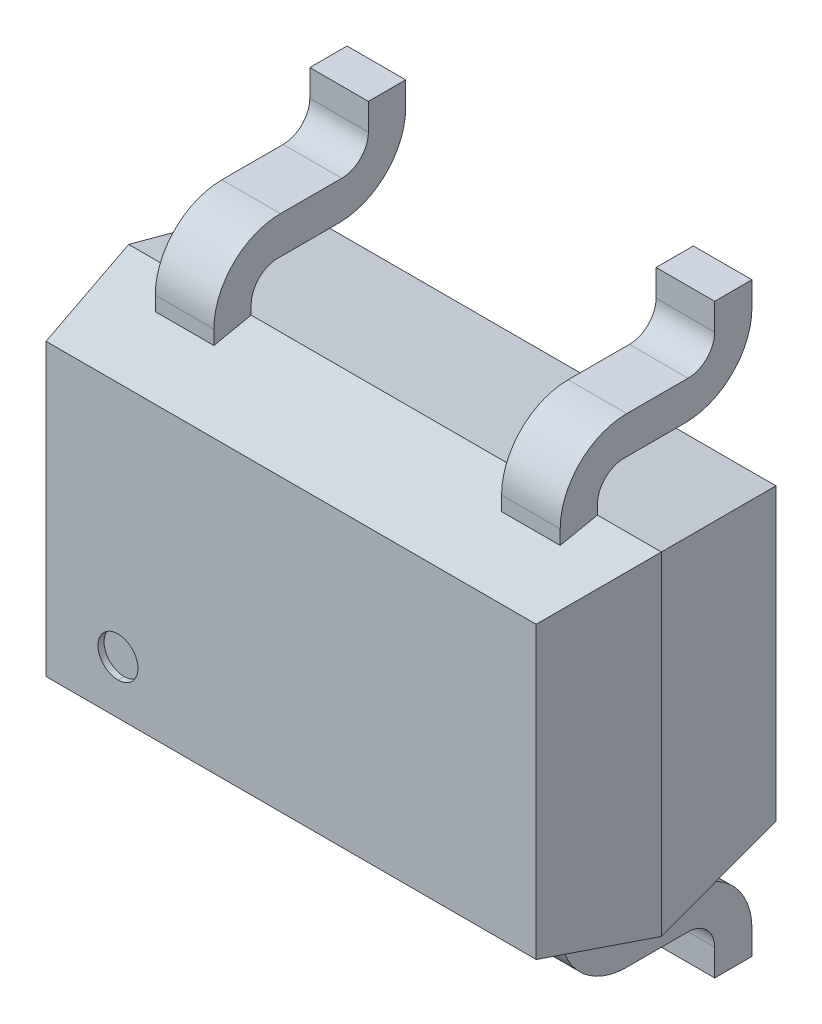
ISO-10303-21;
HEADER;
FILE_DESCRIPTION(('STEP AP214'),'2;1');
FILE_NAME('part.step','',(''),(''),'','','');
FILE_SCHEMA(('AUTOMOTIVE_DESIGN { 1 0 10303 214 1 1 1 1 }'));
ENDSEC;
DATA;
#1=APPLICATION_CONTEXT('core data for automotive mechanical design processes');
#2=APPLICATION_PROTOCOL_DEFINITION('international standard','automotive_design',2000,#1);
#3=PRODUCT_CONTEXT('',#1,'mechanical');
#4=PRODUCT('Part','Part','',(#3));
#5=PRODUCT_RELATED_PRODUCT_CATEGORY('part','',(#4));
#6=PRODUCT_DEFINITION_FORMATION('','',#4);
#7=PRODUCT_DEFINITION_CONTEXT('part definition',#1,'design');
#8=PRODUCT_DEFINITION('design','',#6,#7);
#9=PRODUCT_DEFINITION_SHAPE('','',#8);
#10=(LENGTH_UNIT() NAMED_UNIT(*) SI_UNIT(.MILLI.,.METRE.));
#11=(NAMED_UNIT(*) PLANE_ANGLE_UNIT() SI_UNIT($,.RADIAN.));
#12=(NAMED_UNIT(*) SI_UNIT($,.STERADIAN.) SOLID_ANGLE_UNIT());
#13=UNCERTAINTY_MEASURE_WITH_UNIT(LENGTH_MEASURE(1.E-05),#10,'distance_accuracy_value','');
#14=(GEOMETRIC_REPRESENTATION_CONTEXT(3) GLOBAL_UNCERTAINTY_ASSIGNED_CONTEXT((#13)) GLOBAL_UNIT_ASSIGNED_CONTEXT((#10,
#11,#12)) REPRESENTATION_CONTEXT('',''));
#15=CARTESIAN_POINT('',(0.,0.,0.));
#16=DIRECTION('',(0.,0.,1.));
#17=DIRECTION('',(1.,0.,0.));
#18=AXIS2_PLACEMENT_3D('',#15,#16,#17);
#19=CARTESIAN_POINT('',(4.06399994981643E-05,4.0635846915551E-05,0.564900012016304));
#20=DIRECTION('',(0.,-4.37113881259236E-08,0.999999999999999));
#21=DIRECTION('',(1.74845553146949E-07,-0.999999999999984,-4.37113881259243E-08));
#22=AXIS2_PLACEMENT_3D('',#19,#20,#21);
#23=PLANE('',#22);
#24=DIRECTION('',(0.999999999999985,1.74845553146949E-07,0.));
#25=VECTOR('',#24,1.);
#26=CARTESIAN_POINT('',(4.07492779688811E-05,-0.624959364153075,0.564899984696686));
#27=LINE('',#26,#25);
#28=CARTESIAN_POINT('',(-0.999959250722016,-0.624959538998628,0.564899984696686));
#29=VERTEX_POINT('',#28);
#30=CARTESIAN_POINT('',(1.00004074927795,-0.624959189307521,0.564899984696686));
#31=VERTEX_POINT('',#30);
#32=EDGE_CURVE('P0_E11',#29,#31,#27,.T.);
#33=ORIENTED_EDGE('',*,*,#32,.T.);
#34=DIRECTION('',(-1.74845553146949E-07,0.999999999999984,4.37113881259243E-08));
#35=VECTOR('',#34,1.);
#36=CARTESIAN_POINT('',(1.00004063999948,4.0810692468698E-05,0.564900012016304));
#37=LINE('',#36,#35);
#38=CARTESIAN_POINT('',(1.00004053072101,0.625040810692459,0.564900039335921));
#39=VERTEX_POINT('',#38);
#40=EDGE_CURVE('P0_E24',#31,#39,#37,.T.);
#41=ORIENTED_EDGE('',*,*,#40,.T.);
#42=DIRECTION('',(-0.999999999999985,-1.74845553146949E-07,0.));
#43=VECTOR('',#42,1.);
#44=CARTESIAN_POINT('',(4.05307210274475E-05,0.625040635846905,0.564900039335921));
#45=LINE('',#44,#43);
#46=CARTESIAN_POINT('',(-0.999959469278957,0.625040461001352,0.564900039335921));
#47=VERTEX_POINT('',#46);
#48=EDGE_CURVE('P0_E87',#39,#47,#45,.T.);
#49=ORIENTED_EDGE('',*,*,#48,.T.);
#50=DIRECTION('',(1.74845553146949E-07,-0.999999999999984,-4.37113881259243E-08));
#51=VECTOR('',#50,1.);
#52=CARTESIAN_POINT('',(-0.999959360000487,4.0461001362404E-05,0.564900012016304));
#53=LINE('',#52,#51);
#54=EDGE_CURVE('P0_E69',#47,#29,#53,.T.);
#55=ORIENTED_EDGE('',*,*,#54,.T.);
#56=EDGE_LOOP('',(#33,#41,#49,#55));
#57=FACE_BOUND('',#56,.T.);
#58=ADVANCED_FACE('P0_F17',(#57),#23,.T.);
#59=CARTESIAN_POINT('',(0.960040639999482,4.08148450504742E-05,0.309900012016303));
#60=DIRECTION('',(0.98791952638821,1.79507192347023E-07,-0.154967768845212));
#61=DIRECTION('',(0.154967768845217,-1.60879087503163E-08,0.987919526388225));
#62=AXIS2_PLACEMENT_3D('',#59,#60,#61);
#63=PLANE('',#62);
#64=DIRECTION('',(-1.74845553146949E-07,0.999999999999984,4.37113881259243E-08));
#65=VECTOR('',#64,1.);
#66=CARTESIAN_POINT('',(0.92004063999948,4.08189976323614E-05,0.0549000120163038));
#67=LINE('',#66,#65);
#68=CARTESIAN_POINT('',(0.920040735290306,-0.544959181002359,0.0548999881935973));
#69=VERTEX_POINT('',#68);
#70=CARTESIAN_POINT('',(0.920040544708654,0.545040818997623,0.0549000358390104));
#71=VERTEX_POINT('',#70);
#72=EDGE_CURVE('P0_E84',#69,#71,#67,.T.);
#73=ORIENTED_EDGE('',*,*,#72,.T.);
#74=DIRECTION('',(0.153139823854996,0.153139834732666,0.976266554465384));
#75=VECTOR('',#74,1.);
#76=CARTESIAN_POINT('',(0.920040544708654,0.545040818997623,0.0549000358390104));
#77=LINE('',#76,#75);
#78=EDGE_CURVE('P0_E76',#71,#39,#77,.T.);
#79=ORIENTED_EDGE('',*,*,#78,.T.);
#80=ORIENTED_EDGE('',*,*,#40,.F.);
#81=DIRECTION('',(-0.153139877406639,0.153139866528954,-0.976266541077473));
#82=VECTOR('',#81,1.);
#83=CARTESIAN_POINT('',(1.00004074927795,-0.624959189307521,0.564899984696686));
#84=LINE('',#83,#82);
#85=EDGE_CURVE('P0_E81',#31,#69,#84,.T.);
#86=ORIENTED_EDGE('',*,*,#85,.T.);
#87=EDGE_LOOP('',(#73,#79,#80,#86));
#88=FACE_BOUND('',#87,.T.);
#89=ADVANCED_FACE('P0_F90',(#88),#63,.T.);
#90=CARTESIAN_POINT('',(4.07422841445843E-05,-0.584959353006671,0.309899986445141));
#91=DIRECTION('',(1.72733334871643E-07,-0.987919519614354,-0.154967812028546));
#92=DIRECTION('',(-2.70954328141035E-08,0.154967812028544,-0.987919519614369));
#93=AXIS2_PLACEMENT_3D('',#90,#91,#92);
#94=PLANE('',#93);
#95=DIRECTION('',(0.999999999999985,1.74845553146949E-07,0.));
#96=VECTOR('',#95,1.);
#97=CARTESIAN_POINT('',(4.07352903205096E-05,-0.544959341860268,0.0548999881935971));
#98=LINE('',#97,#96);
#99=CARTESIAN_POINT('',(-0.919959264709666,-0.544959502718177,0.0548999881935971));
#100=VERTEX_POINT('',#99);
#101=EDGE_CURVE('P0_E60',#100,#69,#98,.T.);
#102=ORIENTED_EDGE('',*,*,#101,.T.);
#103=ORIENTED_EDGE('',*,*,#85,.F.);
#104=ORIENTED_EDGE('',*,*,#32,.F.);
#105=DIRECTION('',(0.153139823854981,0.153139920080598,-0.976266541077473));
#106=VECTOR('',#105,1.);
#107=CARTESIAN_POINT('',(-0.999959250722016,-0.624959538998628,0.564899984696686));
#108=LINE('',#107,#106);
#109=EDGE_CURVE('P0_E63',#29,#100,#108,.T.);
#110=ORIENTED_EDGE('',*,*,#109,.T.);
#111=EDGE_LOOP('',(#102,#103,#104,#110));
#112=FACE_BOUND('',#111,.T.);
#113=ADVANCED_FACE('P0_F91',(#112),#94,.T.);
#114=CARTESIAN_POINT('',(-0.959959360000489,4.0479141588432E-05,0.309900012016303));
#115=DIRECTION('',(-0.987919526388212,-1.6595947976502E-07,-0.154967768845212));
#116=DIRECTION('',(0.154967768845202,7.02787592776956E-08,-0.987919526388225));
#117=AXIS2_PLACEMENT_3D('',#114,#115,#116);
#118=PLANE('',#117);
#119=DIRECTION('',(1.74845553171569E-07,-0.999999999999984,-4.37113882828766E-08));
#120=VECTOR('',#119,1.);
#121=CARTESIAN_POINT('',(-0.919959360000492,4.0497281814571E-05,0.0549000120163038));
#122=LINE('',#121,#120);
#123=CARTESIAN_POINT('',(-0.919959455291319,0.545040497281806,0.0549000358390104));
#124=VERTEX_POINT('',#123);
#125=EDGE_CURVE('P0_E53',#124,#100,#122,.T.);
#126=ORIENTED_EDGE('',*,*,#125,.T.);
#127=ORIENTED_EDGE('',*,*,#109,.F.);
#128=ORIENTED_EDGE('',*,*,#54,.F.);
#129=DIRECTION('',(0.153139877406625,-0.153139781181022,-0.976266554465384));
#130=VECTOR('',#129,1.);
#131=CARTESIAN_POINT('',(-0.999959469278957,0.625040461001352,0.564900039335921));
#132=LINE('',#131,#130);
#133=EDGE_CURVE('P0_E64',#47,#124,#132,.T.);
#134=ORIENTED_EDGE('',*,*,#133,.T.);
#135=EDGE_LOOP('',(#126,#127,#128,#134));
#136=FACE_BOUND('',#135,.T.);
#137=ADVANCED_FACE('P0_F68',(#136),#118,.T.);
#138=CARTESIAN_POINT('',(4.05377148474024E-05,0.58504064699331,0.309900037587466));
#139=DIRECTION('',(-1.727333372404E-07,0.987919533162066,-0.154967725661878));
#140=DIRECTION('',(-2.70954177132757E-08,0.154967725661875,0.987919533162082));
#141=AXIS2_PLACEMENT_3D('',#138,#139,#140);
#142=PLANE('',#141);
#143=DIRECTION('',(-0.999999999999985,-1.74845553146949E-07,0.));
#144=VECTOR('',#143,1.);
#145=CARTESIAN_POINT('',(4.05447086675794E-05,0.545040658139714,0.0549000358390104));
#146=LINE('',#145,#144);
#147=EDGE_CURVE('P0_E58',#71,#124,#146,.T.);
#148=ORIENTED_EDGE('',*,*,#147,.T.);
#149=ORIENTED_EDGE('',*,*,#133,.F.);
#150=ORIENTED_EDGE('',*,*,#48,.F.);
#151=ORIENTED_EDGE('',*,*,#78,.F.);
#152=EDGE_LOOP('',(#148,#149,#150,#151));
#153=FACE_BOUND('',#152,.T.);
#154=ADVANCED_FACE('P0_F74',(#153),#142,.T.);
#155=CARTESIAN_POINT('',(4.06399994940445E-05,4.06581397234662E-05,0.0549000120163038));
#156=DIRECTION('',(0.,-4.37113881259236E-08,0.999999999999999));
#157=DIRECTION('',(1.74845553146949E-07,-0.999999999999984,-4.37113881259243E-08));
#158=AXIS2_PLACEMENT_3D('',#155,#156,#157);
#159=PLANE('',#158);
#160=ORIENTED_EDGE('',*,*,#72,.F.);
#161=ORIENTED_EDGE('',*,*,#101,.F.);
#162=ORIENTED_EDGE('',*,*,#125,.F.);
#163=ORIENTED_EDGE('',*,*,#147,.F.);
#164=EDGE_LOOP('',(#160,#161,#162,#163));
#165=FACE_BOUND('',#164,.T.);
#166=ADVANCED_FACE('P0_F56',(#165),#159,.F.);
#167=CLOSED_SHELL('',(#58,#89,#113,#137,#154,#166));
#168=MANIFOLD_SOLID_BREP('P0_B1',#167);
#169=CARTESIAN_POINT('',(0.110040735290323,-0.544959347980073,0.634899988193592));
#170=DIRECTION('',(-0.999999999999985,-1.74845553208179E-07,0.));
#171=DIRECTION('',(1.74845553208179E-07,-0.999999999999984,-4.37113882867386E-08));
#172=AXIS2_PLACEMENT_3D('',#169,#170,#171);
#173=PLANE('',#172);
#174=DIRECTION('',(0.,-4.37113882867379E-08,0.999999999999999));
#175=VECTOR('',#174,1.);
#176=CARTESIAN_POINT('',(0.110040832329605,-1.09995934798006,0.634899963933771));
#177=LINE('',#176,#175);
#178=CARTESIAN_POINT('',(0.1100408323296,-1.09995931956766,-0.0151000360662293));
#179=VERTEX_POINT('',#178);
#180=CARTESIAN_POINT('',(0.110040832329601,-1.09995932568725,0.124899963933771));
#181=VERTEX_POINT('',#180);
#182=EDGE_CURVE('P1_E11',#179,#181,#177,.T.);
#183=ORIENTED_EDGE('',*,*,#182,.F.);
#184=DIRECTION('',(1.74845553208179E-07,-0.999999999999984,-4.37113882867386E-08));
#185=VECTOR('',#184,1.);
#186=CARTESIAN_POINT('',(0.110040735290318,-0.544959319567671,-0.0151000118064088));
#187=LINE('',#186,#185);
#188=CARTESIAN_POINT('',(0.1100408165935,-1.00995931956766,-0.0151000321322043));
#189=VERTEX_POINT('',#188);
#190=EDGE_CURVE('P1_E24',#189,#179,#187,.T.);
#191=ORIENTED_EDGE('',*,*,#190,.F.);
#192=CARTESIAN_POINT('',(0.110040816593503,-1.00995933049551,0.234899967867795));
#193=DIRECTION('',(-0.999999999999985,-1.74845553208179E-07,0.));
#194=DIRECTION('',(1.74845553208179E-07,-0.999999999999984,-4.37113882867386E-08));
#195=AXIS2_PLACEMENT_3D('',#192,#193,#194);
#196=CIRCLE('',#195,0.25);
#197=CARTESIAN_POINT('',(0.110040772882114,-0.759959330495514,0.234899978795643));
#198=VERTEX_POINT('',#197);
#199=EDGE_CURVE('P1_E200',#198,#189,#196,.T.);
#200=ORIENTED_EDGE('',*,*,#199,.F.);
#201=DIRECTION('',(0.,4.37113882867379E-08,-0.999999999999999));
#202=VECTOR('',#201,1.);
#203=CARTESIAN_POINT('',(0.110040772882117,-0.75995934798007,0.634899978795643));
#204=LINE('',#203,#202);
#205=CARTESIAN_POINT('',(0.110040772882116,-0.759959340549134,0.464899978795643));
#206=VERTEX_POINT('',#205);
#207=EDGE_CURVE('P1_E197',#206,#198,#204,.T.);
#208=ORIENTED_EDGE('',*,*,#207,.F.);
#209=CARTESIAN_POINT('',(0.110040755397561,-0.659959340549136,0.464899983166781));
#210=DIRECTION('',(0.999999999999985,1.74845553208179E-07,0.));
#211=DIRECTION('',(1.74845553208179E-07,-0.999999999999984,-4.3711387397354E-08));
#212=AXIS2_PLACEMENT_3D('',#209,#210,#211);
#213=CIRCLE('',#212,0.1);
#214=CARTESIAN_POINT('',(0.110040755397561,-0.659959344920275,0.564899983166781));
#215=VERTEX_POINT('',#214);
#216=EDGE_CURVE('P1_E195',#215,#206,#213,.T.);
#217=ORIENTED_EDGE('',*,*,#216,.F.);
#218=DIRECTION('',(1.74845553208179E-07,-0.999999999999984,-4.37113882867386E-08));
#219=VECTOR('',#218,1.);
#220=CARTESIAN_POINT('',(0.110040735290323,-0.544959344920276,0.564899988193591));
#221=LINE('',#220,#219);
#222=CARTESIAN_POINT('',(0.110040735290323,-0.544959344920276,0.564899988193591));
#223=VERTEX_POINT('',#222);
#224=EDGE_CURVE('P1_E192',#223,#215,#221,.T.);
#225=ORIENTED_EDGE('',*,*,#224,.F.);
#226=DIRECTION('',(0.,4.37113882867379E-08,-0.999999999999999));
#227=VECTOR('',#226,1.);
#228=CARTESIAN_POINT('',(0.110040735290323,-0.544959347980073,0.634899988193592));
#229=LINE('',#228,#227);
#230=CARTESIAN_POINT('',(0.110040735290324,-0.54495935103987,0.704899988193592));
#231=VERTEX_POINT('',#230);
#232=EDGE_CURVE('P1_E190',#231,#223,#229,.T.);
#233=ORIENTED_EDGE('',*,*,#232,.F.);
#234=DIRECTION('',(-1.74845553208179E-07,0.999999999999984,4.37113882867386E-08));
#235=VECTOR('',#234,1.);
#236=CARTESIAN_POINT('',(0.110040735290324,-0.54495935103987,0.704899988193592));
#237=LINE('',#236,#235);
#238=CARTESIAN_POINT('',(0.110040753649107,-0.64995935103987,0.704899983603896));
#239=VERTEX_POINT('',#238);
#240=EDGE_CURVE('P1_E187',#239,#231,#237,.T.);
#241=ORIENTED_EDGE('',*,*,#240,.F.);
#242=CARTESIAN_POINT('',(0.110040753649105,-0.649959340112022,0.454899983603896));
#243=DIRECTION('',(-0.999999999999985,-1.74845553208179E-07,0.));
#244=DIRECTION('',(1.74845553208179E-07,-0.999999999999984,-4.37113882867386E-08));
#245=AXIS2_PLACEMENT_3D('',#242,#243,#244);
#246=CIRCLE('',#245,0.25);
#247=CARTESIAN_POINT('',(0.110040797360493,-0.899959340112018,0.454899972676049));
#248=VERTEX_POINT('',#247);
#249=EDGE_CURVE('P1_E184',#248,#239,#246,.T.);
#250=ORIENTED_EDGE('',*,*,#249,.F.);
#251=DIRECTION('',(0.,-4.37113882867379E-08,0.999999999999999));
#252=VECTOR('',#251,1.);
#253=CARTESIAN_POINT('',(0.110040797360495,-0.899959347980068,0.634899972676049));
#254=LINE('',#253,#252);
#255=CARTESIAN_POINT('',(0.110040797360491,-0.899959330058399,0.224899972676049));
#256=VERTEX_POINT('',#255);
#257=EDGE_CURVE('P1_E182',#256,#248,#254,.T.);
#258=ORIENTED_EDGE('',*,*,#257,.F.);
#259=CARTESIAN_POINT('',(0.110040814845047,-0.999959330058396,0.22489996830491));
#260=DIRECTION('',(0.999999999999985,1.74845553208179E-07,0.));
#261=DIRECTION('',(1.74845553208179E-07,-0.999999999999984,-4.37113882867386E-08));
#262=AXIS2_PLACEMENT_3D('',#259,#260,#261);
#263=CIRCLE('',#262,0.1);
#264=CARTESIAN_POINT('',(0.110040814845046,-0.999959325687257,0.12489996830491));
#265=VERTEX_POINT('',#264);
#266=EDGE_CURVE('P1_E126',#265,#256,#263,.T.);
#267=ORIENTED_EDGE('',*,*,#266,.F.);
#268=DIRECTION('',(-1.74845553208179E-07,0.999999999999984,4.37113882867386E-08));
#269=VECTOR('',#268,1.);
#270=CARTESIAN_POINT('',(0.110040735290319,-0.544959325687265,0.124899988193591));
#271=LINE('',#270,#269);
#272=EDGE_CURVE('P1_E178',#181,#265,#271,.T.);
#273=ORIENTED_EDGE('',*,*,#272,.F.);
#274=EDGE_LOOP('',(#183,#191,#200,#208,#217,#225,#233,#241,#250,#258,#267,#273));
#275=FACE_BOUND('',#274,.T.);
#276=ADVANCED_FACE('P1_F17',(#275),#173,.F.);
#277=CARTESIAN_POINT('',(-0.109959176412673,-1.04995936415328,0.12489996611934));
#278=DIRECTION('',(0.,-4.37113888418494E-08,0.999999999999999));
#279=DIRECTION('',(1.74845553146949E-07,-0.999999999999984,-4.37113888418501E-08));
#280=AXIS2_PLACEMENT_3D('',#277,#278,#279);
#281=PLANE('',#280);
#282=DIRECTION('',(1.74845553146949E-07,-0.999999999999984,-4.37113888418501E-08));
#283=VECTOR('',#282,1.);
#284=CARTESIAN_POINT('',(-0.109959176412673,-1.04995936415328,0.12489996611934));
#285=LINE('',#284,#283);
#286=CARTESIAN_POINT('',(-0.109959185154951,-0.999959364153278,0.12489996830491));
#287=VERTEX_POINT('',#286);
#288=CARTESIAN_POINT('',(-0.109959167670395,-1.09995936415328,0.124899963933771));
#289=VERTEX_POINT('',#288);
#290=EDGE_CURVE('P1_E120',#287,#289,#285,.T.);
#291=ORIENTED_EDGE('',*,*,#290,.T.);
#292=DIRECTION('',(0.999999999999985,1.74845553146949E-07,0.));
#293=VECTOR('',#292,1.);
#294=CARTESIAN_POINT('',(-0.109959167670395,-1.09995936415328,0.124899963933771));
#295=LINE('',#294,#293);
#296=EDGE_CURVE('P1_E175',#289,#181,#295,.T.);
#297=ORIENTED_EDGE('',*,*,#296,.T.);
#298=ORIENTED_EDGE('',*,*,#272,.T.);
#299=DIRECTION('',(-0.999999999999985,-1.74845553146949E-07,0.));
#300=VECTOR('',#299,1.);
#301=CARTESIAN_POINT('',(-0.109959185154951,-0.999959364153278,0.12489996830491));
#302=LINE('',#301,#300);
#303=EDGE_CURVE('P1_E173',#265,#287,#302,.T.);
#304=ORIENTED_EDGE('',*,*,#303,.T.);
#305=EDGE_LOOP('',(#291,#297,#298,#304));
#306=FACE_BOUND('',#305,.T.);
#307=ADVANCED_FACE('P1_F208',(#306),#281,.T.);
#308=CARTESIAN_POINT('',(-0.109959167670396,-1.09995936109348,0.0548999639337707));
#309=DIRECTION('',(1.74845553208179E-07,-0.999999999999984,-4.37113882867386E-08));
#310=DIRECTION('',(0.999999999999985,1.74845553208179E-07,0.));
#311=AXIS2_PLACEMENT_3D('',#308,#309,#310);
#312=PLANE('',#311);
#313=DIRECTION('',(0.,4.37113882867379E-08,-0.999999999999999));
#314=VECTOR('',#313,1.);
#315=CARTESIAN_POINT('',(-0.109959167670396,-1.09995936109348,0.0548999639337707));
#316=LINE('',#315,#314);
#317=CARTESIAN_POINT('',(-0.109959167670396,-1.09995935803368,-0.0151000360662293));
#318=VERTEX_POINT('',#317);
#319=EDGE_CURVE('P1_E171',#289,#318,#316,.T.);
#320=ORIENTED_EDGE('',*,*,#319,.T.);
#321=DIRECTION('',(0.999999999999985,1.74845553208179E-07,0.));
#322=VECTOR('',#321,1.);
#323=CARTESIAN_POINT('',(-0.109959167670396,-1.09995935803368,-0.0151000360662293));
#324=LINE('',#323,#322);
#325=EDGE_CURVE('P1_E169',#318,#179,#324,.T.);
#326=ORIENTED_EDGE('',*,*,#325,.T.);
#327=ORIENTED_EDGE('',*,*,#182,.T.);
#328=ORIENTED_EDGE('',*,*,#296,.F.);
#329=EDGE_LOOP('',(#320,#326,#327,#328));
#330=FACE_BOUND('',#329,.T.);
#331=ADVANCED_FACE('P1_F206',(#330),#312,.T.);
#332=CARTESIAN_POINT('',(-0.109959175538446,-1.05495935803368,-0.0151000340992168));
#333=DIRECTION('',(0.,4.37113882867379E-08,-0.999999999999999));
#334=DIRECTION('',(-1.74845553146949E-07,0.999999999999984,4.37113882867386E-08));
#335=AXIS2_PLACEMENT_3D('',#332,#333,#334);
#336=PLANE('',#335);
#337=DIRECTION('',(-1.74845553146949E-07,0.999999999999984,4.37113882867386E-08));
#338=VECTOR('',#337,1.);
#339=CARTESIAN_POINT('',(-0.109959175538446,-1.05495935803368,-0.0151000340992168));
#340=LINE('',#339,#338);
#341=CARTESIAN_POINT('',(-0.109959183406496,-1.00995935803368,-0.0151000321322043));
#342=VERTEX_POINT('',#341);
#343=EDGE_CURVE('P1_E166',#318,#342,#340,.T.);
#344=ORIENTED_EDGE('',*,*,#343,.T.);
#345=DIRECTION('',(0.999999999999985,1.74845553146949E-07,0.));
#346=VECTOR('',#345,1.);
#347=CARTESIAN_POINT('',(-0.109959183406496,-1.00995935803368,-0.0151000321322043));
#348=LINE('',#347,#346);
#349=EDGE_CURVE('P1_E164',#342,#189,#348,.T.);
#350=ORIENTED_EDGE('',*,*,#349,.T.);
#351=ORIENTED_EDGE('',*,*,#190,.T.);
#352=ORIENTED_EDGE('',*,*,#325,.F.);
#353=EDGE_LOOP('',(#344,#350,#351,#352));
#354=FACE_BOUND('',#353,.T.);
#355=ADVANCED_FACE('P1_F204',(#354),#336,.T.);
#356=CARTESIAN_POINT('',(-0.109959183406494,-1.00995936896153,0.234899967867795));
#357=DIRECTION('',(-0.999999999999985,-1.74845553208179E-07,0.));
#358=DIRECTION('',(1.74845553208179E-07,-0.999999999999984,-4.37113882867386E-08));
#359=AXIS2_PLACEMENT_3D('',#356,#357,#358);
#360=CYLINDRICAL_SURFACE('',#359,0.25);
#361=ORIENTED_EDGE('',*,*,#349,.F.);
#362=CARTESIAN_POINT('',(-0.109959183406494,-1.00995936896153,0.234899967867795));
#363=DIRECTION('',(0.999999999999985,1.74845553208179E-07,0.));
#364=DIRECTION('',(1.74845553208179E-07,-0.999999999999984,-4.37113882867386E-08));
#365=AXIS2_PLACEMENT_3D('',#362,#363,#364);
#366=CIRCLE('',#365,0.25);
#367=CARTESIAN_POINT('',(-0.109959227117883,-0.759959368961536,0.234899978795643));
#368=VERTEX_POINT('',#367);
#369=EDGE_CURVE('P1_E162',#342,#368,#366,.T.);
#370=ORIENTED_EDGE('',*,*,#369,.T.);
#371=DIRECTION('',(0.999999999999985,1.74845553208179E-07,0.));
#372=VECTOR('',#371,1.);
#373=CARTESIAN_POINT('',(-0.109959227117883,-0.759959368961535,0.234899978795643));
#374=LINE('',#373,#372);
#375=EDGE_CURVE('P1_E159',#368,#198,#374,.T.);
#376=ORIENTED_EDGE('',*,*,#375,.T.);
#377=ORIENTED_EDGE('',*,*,#199,.T.);
#378=EDGE_LOOP('',(#361,#370,#376,#377));
#379=FACE_BOUND('',#378,.T.);
#380=ADVANCED_FACE('P1_F235',(#379),#360,.T.);
#381=CARTESIAN_POINT('',(-0.109959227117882,-0.759959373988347,0.349899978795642));
#382=DIRECTION('',(-1.74845553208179E-07,0.999999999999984,4.37113882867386E-08));
#383=DIRECTION('',(-0.999999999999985,-1.74845553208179E-07,0.));
#384=AXIS2_PLACEMENT_3D('',#381,#382,#383);
#385=PLANE('',#384);
#386=DIRECTION('',(0.,-4.37113882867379E-08,0.999999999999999));
#387=VECTOR('',#386,1.);
#388=CARTESIAN_POINT('',(-0.109959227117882,-0.759959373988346,0.349899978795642));
#389=LINE('',#388,#387);
#390=CARTESIAN_POINT('',(-0.109959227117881,-0.759959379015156,0.464899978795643));
#391=VERTEX_POINT('',#390);
#392=EDGE_CURVE('P1_E157',#368,#391,#389,.T.);
#393=ORIENTED_EDGE('',*,*,#392,.T.);
#394=DIRECTION('',(0.999999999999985,1.74845553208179E-07,0.));
#395=VECTOR('',#394,1.);
#396=CARTESIAN_POINT('',(-0.109959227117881,-0.759959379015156,0.464899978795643));
#397=LINE('',#396,#395);
#398=EDGE_CURVE('P1_E154',#391,#206,#397,.T.);
#399=ORIENTED_EDGE('',*,*,#398,.T.);
#400=ORIENTED_EDGE('',*,*,#207,.T.);
#401=ORIENTED_EDGE('',*,*,#375,.F.);
#402=EDGE_LOOP('',(#393,#399,#400,#401));
#403=FACE_BOUND('',#402,.T.);
#404=ADVANCED_FACE('P1_F232',(#403),#385,.T.);
#405=CARTESIAN_POINT('',(-0.109959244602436,-0.659959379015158,0.464899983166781));
#406=DIRECTION('',(-0.999999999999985,-1.74845553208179E-07,0.));
#407=DIRECTION('',(1.74845553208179E-07,-0.999999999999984,-4.37113882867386E-08));
#408=AXIS2_PLACEMENT_3D('',#405,#406,#407);
#409=CYLINDRICAL_SURFACE('',#408,0.1);
#410=ORIENTED_EDGE('',*,*,#216,.T.);
#411=ORIENTED_EDGE('',*,*,#398,.F.);
#412=CARTESIAN_POINT('',(-0.109959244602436,-0.659959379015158,0.464899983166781));
#413=DIRECTION('',(0.999999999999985,1.74845553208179E-07,0.));
#414=DIRECTION('',(1.74845553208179E-07,-0.999999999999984,-4.3711387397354E-08));
#415=AXIS2_PLACEMENT_3D('',#412,#413,#414);
#416=CIRCLE('',#415,0.1);
#417=CARTESIAN_POINT('',(-0.109959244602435,-0.659959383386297,0.564899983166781));
#418=VERTEX_POINT('',#417);
#419=EDGE_CURVE('P1_E151',#418,#391,#416,.T.);
#420=ORIENTED_EDGE('',*,*,#419,.F.);
#421=DIRECTION('',(-0.999999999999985,-1.74845553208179E-07,0.));
#422=VECTOR('',#421,1.);
#423=CARTESIAN_POINT('',(-0.109959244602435,-0.659959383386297,0.564899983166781));
#424=LINE('',#423,#422);
#425=EDGE_CURVE('P1_E149',#215,#418,#424,.T.);
#426=ORIENTED_EDGE('',*,*,#425,.F.);
#427=EDGE_LOOP('',(#410,#411,#420,#426));
#428=FACE_BOUND('',#427,.T.);
#429=ADVANCED_FACE('P1_F228',(#428),#409,.F.);
#430=CARTESIAN_POINT('',(-0.109959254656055,-0.602459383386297,0.564899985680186));
#431=DIRECTION('',(0.,4.37113882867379E-08,-0.999999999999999));
#432=DIRECTION('',(-1.74845553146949E-07,0.999999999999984,4.37113882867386E-08));
#433=AXIS2_PLACEMENT_3D('',#430,#431,#432);
#434=PLANE('',#433);
#435=DIRECTION('',(-1.74845553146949E-07,0.999999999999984,4.37113882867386E-08));
#436=VECTOR('',#435,1.);
#437=CARTESIAN_POINT('',(-0.109959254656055,-0.602459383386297,0.564899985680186));
#438=LINE('',#437,#436);
#439=CARTESIAN_POINT('',(-0.109959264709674,-0.544959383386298,0.564899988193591));
#440=VERTEX_POINT('',#439);
#441=EDGE_CURVE('P1_E146',#418,#440,#438,.T.);
#442=ORIENTED_EDGE('',*,*,#441,.T.);
#443=DIRECTION('',(0.999999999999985,1.74845553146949E-07,0.));
#444=VECTOR('',#443,1.);
#445=CARTESIAN_POINT('',(-0.109959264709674,-0.544959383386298,0.564899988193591));
#446=LINE('',#445,#444);
#447=EDGE_CURVE('P1_E143',#440,#223,#446,.T.);
#448=ORIENTED_EDGE('',*,*,#447,.T.);
#449=ORIENTED_EDGE('',*,*,#224,.T.);
#450=ORIENTED_EDGE('',*,*,#425,.T.);
#451=EDGE_LOOP('',(#442,#448,#449,#450));
#452=FACE_BOUND('',#451,.T.);
#453=ADVANCED_FACE('P1_F223',(#452),#434,.T.);
#454=CARTESIAN_POINT('',(-0.109959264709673,-0.544959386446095,0.634899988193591));
#455=DIRECTION('',(-1.74845553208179E-07,0.999999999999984,4.37113882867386E-08));
#456=DIRECTION('',(-0.999999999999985,-1.74845553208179E-07,0.));
#457=AXIS2_PLACEMENT_3D('',#454,#455,#456);
#458=PLANE('',#457);
#459=DIRECTION('',(0.,-4.37113882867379E-08,0.999999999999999));
#460=VECTOR('',#459,1.);
#461=CARTESIAN_POINT('',(-0.109959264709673,-0.544959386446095,0.634899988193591));
#462=LINE('',#461,#460);
#463=CARTESIAN_POINT('',(-0.109959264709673,-0.544959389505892,0.704899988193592));
#464=VERTEX_POINT('',#463);
#465=EDGE_CURVE('P1_E141',#440,#464,#462,.T.);
#466=ORIENTED_EDGE('',*,*,#465,.T.);
#467=DIRECTION('',(0.999999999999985,1.74845553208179E-07,0.));
#468=VECTOR('',#467,1.);
#469=CARTESIAN_POINT('',(-0.109959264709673,-0.544959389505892,0.704899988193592));
#470=LINE('',#469,#468);
#471=EDGE_CURVE('P1_E138',#464,#231,#470,.T.);
#472=ORIENTED_EDGE('',*,*,#471,.T.);
#473=ORIENTED_EDGE('',*,*,#232,.T.);
#474=ORIENTED_EDGE('',*,*,#447,.F.);
#475=EDGE_LOOP('',(#466,#472,#473,#474));
#476=FACE_BOUND('',#475,.T.);
#477=ADVANCED_FACE('P1_F218',(#476),#458,.T.);
#478=CARTESIAN_POINT('',(-0.109959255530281,-0.597459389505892,0.704899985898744));
#479=DIRECTION('',(0.,-4.37113882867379E-08,0.999999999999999));
#480=DIRECTION('',(1.74845553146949E-07,-0.999999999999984,-4.37113882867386E-08));
#481=AXIS2_PLACEMENT_3D('',#478,#479,#480);
#482=PLANE('',#481);
#483=DIRECTION('',(1.74845553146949E-07,-0.999999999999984,-4.37113882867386E-08));
#484=VECTOR('',#483,1.);
#485=CARTESIAN_POINT('',(-0.109959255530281,-0.597459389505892,0.704899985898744));
#486=LINE('',#485,#484);
#487=CARTESIAN_POINT('',(-0.10995924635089,-0.649959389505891,0.704899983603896));
#488=VERTEX_POINT('',#487);
#489=EDGE_CURVE('P1_E135',#464,#488,#486,.T.);
#490=ORIENTED_EDGE('',*,*,#489,.T.);
#491=DIRECTION('',(0.999999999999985,1.74845553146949E-07,0.));
#492=VECTOR('',#491,1.);
#493=CARTESIAN_POINT('',(-0.10995924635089,-0.649959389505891,0.704899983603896));
#494=LINE('',#493,#492);
#495=EDGE_CURVE('P1_E132',#488,#239,#494,.T.);
#496=ORIENTED_EDGE('',*,*,#495,.T.);
#497=ORIENTED_EDGE('',*,*,#240,.T.);
#498=ORIENTED_EDGE('',*,*,#471,.F.);
#499=EDGE_LOOP('',(#490,#496,#497,#498));
#500=FACE_BOUND('',#499,.T.);
#501=ADVANCED_FACE('P1_F216',(#500),#482,.T.);
#502=CARTESIAN_POINT('',(-0.109959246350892,-0.649959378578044,0.454899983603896));
#503=DIRECTION('',(-0.999999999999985,-1.74845553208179E-07,0.));
#504=DIRECTION('',(1.74845553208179E-07,-0.999999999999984,-4.37113882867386E-08));
#505=AXIS2_PLACEMENT_3D('',#502,#503,#504);
#506=CYLINDRICAL_SURFACE('',#505,0.25);
#507=ORIENTED_EDGE('',*,*,#495,.F.);
#508=CARTESIAN_POINT('',(-0.109959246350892,-0.649959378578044,0.454899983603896));
#509=DIRECTION('',(0.999999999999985,1.74845553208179E-07,0.));
#510=DIRECTION('',(1.74845553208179E-07,-0.999999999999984,-4.37113882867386E-08));
#511=AXIS2_PLACEMENT_3D('',#508,#509,#510);
#512=CIRCLE('',#511,0.25);
#513=CARTESIAN_POINT('',(-0.109959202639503,-0.89995937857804,0.454899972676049));
#514=VERTEX_POINT('',#513);
#515=EDGE_CURVE('P1_E130',#488,#514,#512,.T.);
#516=ORIENTED_EDGE('',*,*,#515,.T.);
#517=DIRECTION('',(0.999999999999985,1.74845553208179E-07,0.));
#518=VECTOR('',#517,1.);
#519=CARTESIAN_POINT('',(-0.109959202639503,-0.89995937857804,0.454899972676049));
#520=LINE('',#519,#518);
#521=EDGE_CURVE('P1_E110',#514,#248,#520,.T.);
#522=ORIENTED_EDGE('',*,*,#521,.T.);
#523=ORIENTED_EDGE('',*,*,#249,.T.);
#524=EDGE_LOOP('',(#507,#516,#522,#523));
#525=FACE_BOUND('',#524,.T.);
#526=ADVANCED_FACE('P1_F212',(#525),#506,.T.);
#527=CARTESIAN_POINT('',(-0.109959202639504,-0.89995937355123,0.339899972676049));
#528=DIRECTION('',(1.74845553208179E-07,-0.999999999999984,-4.37113882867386E-08));
#529=DIRECTION('',(0.999999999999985,1.74845553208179E-07,0.));
#530=AXIS2_PLACEMENT_3D('',#527,#528,#529);
#531=PLANE('',#530);
#532=DIRECTION('',(0.,4.37113882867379E-08,-0.999999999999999));
#533=VECTOR('',#532,1.);
#534=CARTESIAN_POINT('',(-0.109959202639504,-0.89995937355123,0.339899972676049));
#535=LINE('',#534,#533);
#536=CARTESIAN_POINT('',(-0.109959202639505,-0.899959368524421,0.224899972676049));
#537=VERTEX_POINT('',#536);
#538=EDGE_CURVE('P1_E104',#514,#537,#535,.T.);
#539=ORIENTED_EDGE('',*,*,#538,.T.);
#540=DIRECTION('',(0.999999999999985,1.74845553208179E-07,0.));
#541=VECTOR('',#540,1.);
#542=CARTESIAN_POINT('',(-0.109959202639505,-0.899959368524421,0.224899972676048));
#543=LINE('',#542,#541);
#544=EDGE_CURVE('P1_E108',#537,#256,#543,.T.);
#545=ORIENTED_EDGE('',*,*,#544,.T.);
#546=ORIENTED_EDGE('',*,*,#257,.T.);
#547=ORIENTED_EDGE('',*,*,#521,.F.);
#548=EDGE_LOOP('',(#539,#545,#546,#547));
#549=FACE_BOUND('',#548,.T.);
#550=ADVANCED_FACE('P1_F106',(#549),#531,.T.);
#551=CARTESIAN_POINT('',(-0.10995918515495,-0.999959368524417,0.22489996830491));
#552=DIRECTION('',(-0.999999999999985,-1.74845553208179E-07,0.));
#553=DIRECTION('',(1.74845553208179E-07,-0.999999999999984,-4.37113882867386E-08));
#554=AXIS2_PLACEMENT_3D('',#551,#552,#553);
#555=CYLINDRICAL_SURFACE('',#554,0.1);
#556=ORIENTED_EDGE('',*,*,#266,.T.);
#557=ORIENTED_EDGE('',*,*,#544,.F.);
#558=CARTESIAN_POINT('',(-0.10995918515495,-0.999959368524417,0.22489996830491));
#559=DIRECTION('',(0.999999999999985,1.74845553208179E-07,0.));
#560=DIRECTION('',(1.74845553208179E-07,-0.999999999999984,-4.37113882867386E-08));
#561=AXIS2_PLACEMENT_3D('',#558,#559,#560);
#562=CIRCLE('',#561,0.1);
#563=EDGE_CURVE('P1_E115',#287,#537,#562,.T.);
#564=ORIENTED_EDGE('',*,*,#563,.F.);
#565=ORIENTED_EDGE('',*,*,#303,.F.);
#566=EDGE_LOOP('',(#556,#557,#564,#565));
#567=FACE_BOUND('',#566,.T.);
#568=ADVANCED_FACE('P1_F125',(#567),#555,.F.);
#569=CARTESIAN_POINT('',(-0.10995921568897,-0.825325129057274,0.348767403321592));
#570=DIRECTION('',(-0.999999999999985,-1.74845553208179E-07,0.));
#571=DIRECTION('',(1.74845553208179E-07,-0.999999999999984,-4.37113882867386E-08));
#572=AXIS2_PLACEMENT_3D('',#569,#570,#571);
#573=PLANE('',#572);
#574=ORIENTED_EDGE('',*,*,#369,.F.);
#575=ORIENTED_EDGE('',*,*,#343,.F.);
#576=ORIENTED_EDGE('',*,*,#319,.F.);
#577=ORIENTED_EDGE('',*,*,#290,.F.);
#578=ORIENTED_EDGE('',*,*,#563,.T.);
#579=ORIENTED_EDGE('',*,*,#538,.F.);
#580=ORIENTED_EDGE('',*,*,#515,.F.);
#581=ORIENTED_EDGE('',*,*,#489,.F.);
#582=ORIENTED_EDGE('',*,*,#465,.F.);
#583=ORIENTED_EDGE('',*,*,#441,.F.);
#584=ORIENTED_EDGE('',*,*,#419,.T.);
#585=ORIENTED_EDGE('',*,*,#392,.F.);
#586=EDGE_LOOP('',(#574,#575,#576,#577,#578,#579,#580,#581,#582,#583,#584,#585));
#587=FACE_BOUND('',#586,.T.);
#588=ADVANCED_FACE('P1_F117',(#587),#573,.T.);
#589=CLOSED_SHELL('',(#276,#307,#331,#355,#380,#404,#429,#453,#477,#501,#526,#550,#568,#588));
#590=MANIFOLD_SOLID_BREP('P1_B1',#589);
#591=CARTESIAN_POINT('',(0.760040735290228,-0.544959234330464,0.634899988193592));
#592=DIRECTION('',(-0.999999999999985,-1.74845553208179E-07,0.));
#593=DIRECTION('',(1.74845553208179E-07,-0.999999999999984,-4.37113882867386E-08));
#594=AXIS2_PLACEMENT_3D('',#591,#592,#593);
#595=PLANE('',#594);
#596=DIRECTION('',(0.,-4.37113882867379E-08,0.999999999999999));
#597=VECTOR('',#596,1.);
#598=CARTESIAN_POINT('',(0.76004083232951,-1.09995923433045,0.634899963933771));
#599=LINE('',#598,#597);
#600=CARTESIAN_POINT('',(0.760040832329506,-1.09995920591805,-0.0151000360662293));
#601=VERTEX_POINT('',#600);
#602=CARTESIAN_POINT('',(0.760040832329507,-1.09995921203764,0.124899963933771));
#603=VERTEX_POINT('',#602);
#604=EDGE_CURVE('P2_E11',#601,#603,#599,.T.);
#605=ORIENTED_EDGE('',*,*,#604,.F.);
#606=DIRECTION('',(1.74845553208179E-07,-0.999999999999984,-4.37113882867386E-08));
#607=VECTOR('',#606,1.);
#608=CARTESIAN_POINT('',(0.760040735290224,-0.544959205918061,-0.0151000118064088));
#609=LINE('',#608,#607);
#610=CARTESIAN_POINT('',(0.760040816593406,-1.00995920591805,-0.0151000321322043));
#611=VERTEX_POINT('',#610);
#612=EDGE_CURVE('P2_E24',#611,#601,#609,.T.);
#613=ORIENTED_EDGE('',*,*,#612,.F.);
#614=CARTESIAN_POINT('',(0.760040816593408,-1.0099592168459,0.234899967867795));
#615=DIRECTION('',(-0.999999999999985,-1.74845553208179E-07,0.));
#616=DIRECTION('',(1.74845553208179E-07,-0.999999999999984,-4.37113882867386E-08));
#617=AXIS2_PLACEMENT_3D('',#614,#615,#616);
#618=CIRCLE('',#617,0.25);
#619=CARTESIAN_POINT('',(0.760040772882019,-0.759959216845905,0.234899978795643));
#620=VERTEX_POINT('',#619);
#621=EDGE_CURVE('P2_E201',#620,#611,#618,.T.);
#622=ORIENTED_EDGE('',*,*,#621,.F.);
#623=DIRECTION('',(0.,4.37113882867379E-08,-0.999999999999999));
#624=VECTOR('',#623,1.);
#625=CARTESIAN_POINT('',(0.760040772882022,-0.759959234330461,0.634899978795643));
#626=LINE('',#625,#624);
#627=CARTESIAN_POINT('',(0.760040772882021,-0.759959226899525,0.464899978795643));
#628=VERTEX_POINT('',#627);
#629=EDGE_CURVE('P2_E198',#628,#620,#626,.T.);
#630=ORIENTED_EDGE('',*,*,#629,.F.);
#631=CARTESIAN_POINT('',(0.760040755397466,-0.659959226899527,0.464899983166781));
#632=DIRECTION('',(0.999999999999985,1.74845553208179E-07,0.));
#633=DIRECTION('',(1.74845553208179E-07,-0.999999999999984,-4.3711387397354E-08));
#634=AXIS2_PLACEMENT_3D('',#631,#632,#633);
#635=CIRCLE('',#634,0.1);
#636=CARTESIAN_POINT('',(0.760040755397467,-0.659959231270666,0.564899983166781));
#637=VERTEX_POINT('',#636);
#638=EDGE_CURVE('P2_E196',#637,#628,#635,.T.);
#639=ORIENTED_EDGE('',*,*,#638,.F.);
#640=DIRECTION('',(1.74845553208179E-07,-0.999999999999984,-4.37113882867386E-08));
#641=VECTOR('',#640,1.);
#642=CARTESIAN_POINT('',(0.760040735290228,-0.544959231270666,0.564899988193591));
#643=LINE('',#642,#641);
#644=CARTESIAN_POINT('',(0.760040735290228,-0.544959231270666,0.564899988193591));
#645=VERTEX_POINT('',#644);
#646=EDGE_CURVE('P2_E193',#645,#637,#643,.T.);
#647=ORIENTED_EDGE('',*,*,#646,.F.);
#648=DIRECTION('',(0.,4.37113882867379E-08,-0.999999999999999));
#649=VECTOR('',#648,1.);
#650=CARTESIAN_POINT('',(0.760040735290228,-0.544959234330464,0.634899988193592));
#651=LINE('',#650,#649);
#652=CARTESIAN_POINT('',(0.760040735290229,-0.544959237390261,0.704899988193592));
#653=VERTEX_POINT('',#652);
#654=EDGE_CURVE('P2_E191',#653,#645,#651,.T.);
#655=ORIENTED_EDGE('',*,*,#654,.F.);
#656=DIRECTION('',(-1.74845553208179E-07,0.999999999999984,4.37113882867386E-08));
#657=VECTOR('',#656,1.);
#658=CARTESIAN_POINT('',(0.760040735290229,-0.544959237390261,0.704899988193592));
#659=LINE('',#658,#657);
#660=CARTESIAN_POINT('',(0.760040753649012,-0.64995923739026,0.704899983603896));
#661=VERTEX_POINT('',#660);
#662=EDGE_CURVE('P2_E188',#661,#653,#659,.T.);
#663=ORIENTED_EDGE('',*,*,#662,.F.);
#664=CARTESIAN_POINT('',(0.76004075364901,-0.649959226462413,0.454899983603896));
#665=DIRECTION('',(-0.999999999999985,-1.74845553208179E-07,0.));
#666=DIRECTION('',(1.74845553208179E-07,-0.999999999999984,-4.37113882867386E-08));
#667=AXIS2_PLACEMENT_3D('',#664,#665,#666);
#668=CIRCLE('',#667,0.25);
#669=CARTESIAN_POINT('',(0.760040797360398,-0.899959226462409,0.454899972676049));
#670=VERTEX_POINT('',#669);
#671=EDGE_CURVE('P2_E185',#670,#661,#668,.T.);
#672=ORIENTED_EDGE('',*,*,#671,.F.);
#673=DIRECTION('',(0.,-4.37113882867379E-08,0.999999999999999));
#674=VECTOR('',#673,1.);
#675=CARTESIAN_POINT('',(0.7600407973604,-0.899959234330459,0.634899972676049));
#676=LINE('',#675,#674);
#677=CARTESIAN_POINT('',(0.760040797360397,-0.89995921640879,0.224899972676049));
#678=VERTEX_POINT('',#677);
#679=EDGE_CURVE('P2_E183',#678,#670,#676,.T.);
#680=ORIENTED_EDGE('',*,*,#679,.F.);
#681=CARTESIAN_POINT('',(0.760040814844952,-0.999959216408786,0.22489996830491));
#682=DIRECTION('',(0.999999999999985,1.74845553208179E-07,0.));
#683=DIRECTION('',(1.74845553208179E-07,-0.999999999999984,-4.37113882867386E-08));
#684=AXIS2_PLACEMENT_3D('',#681,#682,#683);
#685=CIRCLE('',#684,0.1);
#686=CARTESIAN_POINT('',(0.760040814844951,-0.999959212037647,0.12489996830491));
#687=VERTEX_POINT('',#686);
#688=EDGE_CURVE('P2_E119',#687,#678,#685,.T.);
#689=ORIENTED_EDGE('',*,*,#688,.F.);
#690=DIRECTION('',(-1.74845553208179E-07,0.999999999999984,4.37113882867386E-08));
#691=VECTOR('',#690,1.);
#692=CARTESIAN_POINT('',(0.760040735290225,-0.544959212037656,0.124899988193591));
#693=LINE('',#692,#691);
#694=EDGE_CURVE('P2_E180',#603,#687,#693,.T.);
#695=ORIENTED_EDGE('',*,*,#694,.F.);
#696=EDGE_LOOP('',(#605,#613,#622,#630,#639,#647,#655,#663,#672,#680,#689,#695));
#697=FACE_BOUND('',#696,.T.);
#698=ADVANCED_FACE('P2_F17',(#697),#595,.F.);
#699=CARTESIAN_POINT('',(0.540040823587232,-1.04995925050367,0.12489996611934));
#700=DIRECTION('',(0.,-4.37113888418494E-08,0.999999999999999));
#701=DIRECTION('',(1.74845553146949E-07,-0.999999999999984,-4.37113888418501E-08));
#702=AXIS2_PLACEMENT_3D('',#699,#700,#701);
#703=PLANE('',#702);
#704=DIRECTION('',(1.74845553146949E-07,-0.999999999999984,-4.37113888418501E-08));
#705=VECTOR('',#704,1.);
#706=CARTESIAN_POINT('',(0.540040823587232,-1.04995925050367,0.12489996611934));
#707=LINE('',#706,#705);
#708=CARTESIAN_POINT('',(0.540040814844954,-0.999959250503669,0.12489996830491));
#709=VERTEX_POINT('',#708);
#710=CARTESIAN_POINT('',(0.54004083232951,-1.09995925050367,0.124899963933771));
#711=VERTEX_POINT('',#710);
#712=EDGE_CURVE('P2_E125',#709,#711,#707,.T.);
#713=ORIENTED_EDGE('',*,*,#712,.T.);
#714=DIRECTION('',(0.999999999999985,1.74845553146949E-07,0.));
#715=VECTOR('',#714,1.);
#716=CARTESIAN_POINT('',(0.54004083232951,-1.09995925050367,0.124899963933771));
#717=LINE('',#716,#715);
#718=EDGE_CURVE('P2_E177',#711,#603,#717,.T.);
#719=ORIENTED_EDGE('',*,*,#718,.T.);
#720=ORIENTED_EDGE('',*,*,#694,.T.);
#721=DIRECTION('',(-0.999999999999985,-1.74845553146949E-07,0.));
#722=VECTOR('',#721,1.);
#723=CARTESIAN_POINT('',(0.540040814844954,-0.999959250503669,0.12489996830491));
#724=LINE('',#723,#722);
#725=EDGE_CURVE('P2_E175',#687,#709,#724,.T.);
#726=ORIENTED_EDGE('',*,*,#725,.T.);
#727=EDGE_LOOP('',(#713,#719,#720,#726));
#728=FACE_BOUND('',#727,.T.);
#729=ADVANCED_FACE('P2_F235',(#728),#703,.T.);
#730=CARTESIAN_POINT('',(0.540040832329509,-1.09995924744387,0.0548999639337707));
#731=DIRECTION('',(1.74845553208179E-07,-0.999999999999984,-4.37113882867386E-08));
#732=DIRECTION('',(0.999999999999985,1.74845553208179E-07,0.));
#733=AXIS2_PLACEMENT_3D('',#730,#731,#732);
#734=PLANE('',#733);
#735=DIRECTION('',(0.,4.37113882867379E-08,-0.999999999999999));
#736=VECTOR('',#735,1.);
#737=CARTESIAN_POINT('',(0.540040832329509,-1.09995924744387,0.0548999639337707));
#738=LINE('',#737,#736);
#739=CARTESIAN_POINT('',(0.540040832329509,-1.09995924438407,-0.0151000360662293));
#740=VERTEX_POINT('',#739);
#741=EDGE_CURVE('P2_E173',#711,#740,#738,.T.);
#742=ORIENTED_EDGE('',*,*,#741,.T.);
#743=DIRECTION('',(0.999999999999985,1.74845553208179E-07,0.));
#744=VECTOR('',#743,1.);
#745=CARTESIAN_POINT('',(0.540040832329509,-1.09995924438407,-0.0151000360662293));
#746=LINE('',#745,#744);
#747=EDGE_CURVE('P2_E171',#740,#601,#746,.T.);
#748=ORIENTED_EDGE('',*,*,#747,.T.);
#749=ORIENTED_EDGE('',*,*,#604,.T.);
#750=ORIENTED_EDGE('',*,*,#718,.F.);
#751=EDGE_LOOP('',(#742,#748,#749,#750));
#752=FACE_BOUND('',#751,.T.);
#753=ADVANCED_FACE('P2_F207',(#752),#734,.T.);
#754=CARTESIAN_POINT('',(0.540040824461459,-1.05495924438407,-0.0151000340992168));
#755=DIRECTION('',(0.,4.37113882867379E-08,-0.999999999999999));
#756=DIRECTION('',(-1.74845553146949E-07,0.999999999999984,4.37113882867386E-08));
#757=AXIS2_PLACEMENT_3D('',#754,#755,#756);
#758=PLANE('',#757);
#759=DIRECTION('',(-1.74845553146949E-07,0.999999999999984,4.37113882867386E-08));
#760=VECTOR('',#759,1.);
#761=CARTESIAN_POINT('',(0.540040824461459,-1.05495924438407,-0.0151000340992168));
#762=LINE('',#761,#760);
#763=CARTESIAN_POINT('',(0.540040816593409,-1.00995924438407,-0.0151000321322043));
#764=VERTEX_POINT('',#763);
#765=EDGE_CURVE('P2_E168',#740,#764,#762,.T.);
#766=ORIENTED_EDGE('',*,*,#765,.T.);
#767=DIRECTION('',(0.999999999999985,1.74845553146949E-07,0.));
#768=VECTOR('',#767,1.);
#769=CARTESIAN_POINT('',(0.540040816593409,-1.00995924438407,-0.0151000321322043));
#770=LINE('',#769,#768);
#771=EDGE_CURVE('P2_E165',#764,#611,#770,.T.);
#772=ORIENTED_EDGE('',*,*,#771,.T.);
#773=ORIENTED_EDGE('',*,*,#612,.T.);
#774=ORIENTED_EDGE('',*,*,#747,.F.);
#775=EDGE_LOOP('',(#766,#772,#773,#774));
#776=FACE_BOUND('',#775,.T.);
#777=ADVANCED_FACE('P2_F205',(#776),#758,.T.);
#778=CARTESIAN_POINT('',(0.540040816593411,-1.00995925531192,0.234899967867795));
#779=DIRECTION('',(-0.999999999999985,-1.74845553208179E-07,0.));
#780=DIRECTION('',(1.74845553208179E-07,-0.999999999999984,-4.37113882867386E-08));
#781=AXIS2_PLACEMENT_3D('',#778,#779,#780);
#782=CYLINDRICAL_SURFACE('',#781,0.25);
#783=ORIENTED_EDGE('',*,*,#771,.F.);
#784=CARTESIAN_POINT('',(0.540040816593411,-1.00995925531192,0.234899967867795));
#785=DIRECTION('',(0.999999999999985,1.74845553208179E-07,0.));
#786=DIRECTION('',(1.74845553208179E-07,-0.999999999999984,-4.37113882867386E-08));
#787=AXIS2_PLACEMENT_3D('',#784,#785,#786);
#788=CIRCLE('',#787,0.25);
#789=CARTESIAN_POINT('',(0.540040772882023,-0.759959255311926,0.234899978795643));
#790=VERTEX_POINT('',#789);
#791=EDGE_CURVE('P2_E163',#764,#790,#788,.T.);
#792=ORIENTED_EDGE('',*,*,#791,.T.);
#793=DIRECTION('',(0.999999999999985,1.74845553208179E-07,0.));
#794=VECTOR('',#793,1.);
#795=CARTESIAN_POINT('',(0.540040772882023,-0.759959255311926,0.234899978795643));
#796=LINE('',#795,#794);
#797=EDGE_CURVE('P2_E160',#790,#620,#796,.T.);
#798=ORIENTED_EDGE('',*,*,#797,.T.);
#799=ORIENTED_EDGE('',*,*,#621,.T.);
#800=EDGE_LOOP('',(#783,#792,#798,#799));
#801=FACE_BOUND('',#800,.T.);
#802=ADVANCED_FACE('P2_F211',(#801),#782,.T.);
#803=CARTESIAN_POINT('',(0.540040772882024,-0.759959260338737,0.349899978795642));
#804=DIRECTION('',(-1.74845553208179E-07,0.999999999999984,4.37113882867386E-08));
#805=DIRECTION('',(-0.999999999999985,-1.74845553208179E-07,0.));
#806=AXIS2_PLACEMENT_3D('',#803,#804,#805);
#807=PLANE('',#806);
#808=DIRECTION('',(0.,-4.37113882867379E-08,0.999999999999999));
#809=VECTOR('',#808,1.);
#810=CARTESIAN_POINT('',(0.540040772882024,-0.759959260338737,0.349899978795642));
#811=LINE('',#810,#809);
#812=CARTESIAN_POINT('',(0.540040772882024,-0.759959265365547,0.464899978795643));
#813=VERTEX_POINT('',#812);
#814=EDGE_CURVE('P2_E157',#790,#813,#811,.T.);
#815=ORIENTED_EDGE('',*,*,#814,.T.);
#816=DIRECTION('',(0.999999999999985,1.74845553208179E-07,0.));
#817=VECTOR('',#816,1.);
#818=CARTESIAN_POINT('',(0.540040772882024,-0.759959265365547,0.464899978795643));
#819=LINE('',#818,#817);
#820=EDGE_CURVE('P2_E154',#813,#628,#819,.T.);
#821=ORIENTED_EDGE('',*,*,#820,.T.);
#822=ORIENTED_EDGE('',*,*,#629,.T.);
#823=ORIENTED_EDGE('',*,*,#797,.F.);
#824=EDGE_LOOP('',(#815,#821,#822,#823));
#825=FACE_BOUND('',#824,.T.);
#826=ADVANCED_FACE('P2_F213',(#825),#807,.T.);
#827=CARTESIAN_POINT('',(0.540040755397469,-0.659959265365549,0.464899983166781));
#828=DIRECTION('',(-0.999999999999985,-1.74845553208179E-07,0.));
#829=DIRECTION('',(1.74845553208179E-07,-0.999999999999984,-4.37113882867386E-08));
#830=AXIS2_PLACEMENT_3D('',#827,#828,#829);
#831=CYLINDRICAL_SURFACE('',#830,0.1);
#832=ORIENTED_EDGE('',*,*,#638,.T.);
#833=ORIENTED_EDGE('',*,*,#820,.F.);
#834=CARTESIAN_POINT('',(0.540040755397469,-0.659959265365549,0.464899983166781));
#835=DIRECTION('',(0.999999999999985,1.74845553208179E-07,0.));
#836=DIRECTION('',(1.74845553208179E-07,-0.999999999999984,-4.3711387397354E-08));
#837=AXIS2_PLACEMENT_3D('',#834,#835,#836);
#838=CIRCLE('',#837,0.1);
#839=CARTESIAN_POINT('',(0.54004075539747,-0.659959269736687,0.564899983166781));
#840=VERTEX_POINT('',#839);
#841=EDGE_CURVE('P2_E151',#840,#813,#838,.T.);
#842=ORIENTED_EDGE('',*,*,#841,.F.);
#843=DIRECTION('',(-0.999999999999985,-1.74845553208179E-07,0.));
#844=VECTOR('',#843,1.);
#845=CARTESIAN_POINT('',(0.54004075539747,-0.659959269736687,0.564899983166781));
#846=LINE('',#845,#844);
#847=EDGE_CURVE('P2_E148',#637,#840,#846,.T.);
#848=ORIENTED_EDGE('',*,*,#847,.F.);
#849=EDGE_LOOP('',(#832,#833,#842,#848));
#850=FACE_BOUND('',#849,.T.);
#851=ADVANCED_FACE('P2_F222',(#850),#831,.F.);
#852=CARTESIAN_POINT('',(0.54004074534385,-0.602459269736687,0.564899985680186));
#853=DIRECTION('',(0.,4.37113882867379E-08,-0.999999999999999));
#854=DIRECTION('',(-1.74845553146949E-07,0.999999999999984,4.37113882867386E-08));
#855=AXIS2_PLACEMENT_3D('',#852,#853,#854);
#856=PLANE('',#855);
#857=DIRECTION('',(-1.74845553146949E-07,0.999999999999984,4.37113882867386E-08));
#858=VECTOR('',#857,1.);
#859=CARTESIAN_POINT('',(0.54004074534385,-0.602459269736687,0.564899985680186));
#860=LINE('',#859,#858);
#861=CARTESIAN_POINT('',(0.540040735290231,-0.544959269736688,0.564899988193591));
#862=VERTEX_POINT('',#861);
#863=EDGE_CURVE('P2_E145',#840,#862,#860,.T.);
#864=ORIENTED_EDGE('',*,*,#863,.T.);
#865=DIRECTION('',(0.999999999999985,1.74845553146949E-07,0.));
#866=VECTOR('',#865,1.);
#867=CARTESIAN_POINT('',(0.540040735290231,-0.544959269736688,0.564899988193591));
#868=LINE('',#867,#866);
#869=EDGE_CURVE('P2_E142',#862,#645,#868,.T.);
#870=ORIENTED_EDGE('',*,*,#869,.T.);
#871=ORIENTED_EDGE('',*,*,#646,.T.);
#872=ORIENTED_EDGE('',*,*,#847,.T.);
#873=EDGE_LOOP('',(#864,#870,#871,#872));
#874=FACE_BOUND('',#873,.T.);
#875=ADVANCED_FACE('P2_F220',(#874),#856,.T.);
#876=CARTESIAN_POINT('',(0.540040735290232,-0.544959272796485,0.634899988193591));
#877=DIRECTION('',(-1.74845553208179E-07,0.999999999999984,4.37113882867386E-08));
#878=DIRECTION('',(-0.999999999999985,-1.74845553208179E-07,0.));
#879=AXIS2_PLACEMENT_3D('',#876,#877,#878);
#880=PLANE('',#879);
#881=DIRECTION('',(0.,-4.37113882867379E-08,0.999999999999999));
#882=VECTOR('',#881,1.);
#883=CARTESIAN_POINT('',(0.540040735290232,-0.544959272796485,0.634899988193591));
#884=LINE('',#883,#882);
#885=CARTESIAN_POINT('',(0.540040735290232,-0.544959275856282,0.704899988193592));
#886=VERTEX_POINT('',#885);
#887=EDGE_CURVE('P2_E140',#862,#886,#884,.T.);
#888=ORIENTED_EDGE('',*,*,#887,.T.);
#889=DIRECTION('',(0.999999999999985,1.74845553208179E-07,0.));
#890=VECTOR('',#889,1.);
#891=CARTESIAN_POINT('',(0.540040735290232,-0.544959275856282,0.704899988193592));
#892=LINE('',#891,#890);
#893=EDGE_CURVE('P2_E138',#886,#653,#892,.T.);
#894=ORIENTED_EDGE('',*,*,#893,.T.);
#895=ORIENTED_EDGE('',*,*,#654,.T.);
#896=ORIENTED_EDGE('',*,*,#869,.F.);
#897=EDGE_LOOP('',(#888,#894,#895,#896));
#898=FACE_BOUND('',#897,.T.);
#899=ADVANCED_FACE('P2_F226',(#898),#880,.T.);
#900=CARTESIAN_POINT('',(0.540040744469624,-0.597459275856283,0.704899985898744));
#901=DIRECTION('',(0.,-4.37113882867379E-08,0.999999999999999));
#902=DIRECTION('',(1.74845553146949E-07,-0.999999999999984,-4.37113882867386E-08));
#903=AXIS2_PLACEMENT_3D('',#900,#901,#902);
#904=PLANE('',#903);
#905=DIRECTION('',(1.74845553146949E-07,-0.999999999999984,-4.37113882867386E-08));
#906=VECTOR('',#905,1.);
#907=CARTESIAN_POINT('',(0.540040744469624,-0.597459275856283,0.704899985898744));
#908=LINE('',#907,#906);
#909=CARTESIAN_POINT('',(0.540040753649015,-0.649959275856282,0.704899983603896));
#910=VERTEX_POINT('',#909);
#911=EDGE_CURVE('P2_E135',#886,#910,#908,.T.);
#912=ORIENTED_EDGE('',*,*,#911,.T.);
#913=DIRECTION('',(0.999999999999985,1.74845553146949E-07,0.));
#914=VECTOR('',#913,1.);
#915=CARTESIAN_POINT('',(0.540040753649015,-0.649959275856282,0.704899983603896));
#916=LINE('',#915,#914);
#917=EDGE_CURVE('P2_E132',#910,#661,#916,.T.);
#918=ORIENTED_EDGE('',*,*,#917,.T.);
#919=ORIENTED_EDGE('',*,*,#662,.T.);
#920=ORIENTED_EDGE('',*,*,#893,.F.);
#921=EDGE_LOOP('',(#912,#918,#919,#920));
#922=FACE_BOUND('',#921,.T.);
#923=ADVANCED_FACE('P2_F230',(#922),#904,.T.);
#924=CARTESIAN_POINT('',(0.540040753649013,-0.649959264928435,0.454899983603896));
#925=DIRECTION('',(-0.999999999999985,-1.74845553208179E-07,0.));
#926=DIRECTION('',(1.74845553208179E-07,-0.999999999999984,-4.37113882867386E-08));
#927=AXIS2_PLACEMENT_3D('',#924,#925,#926);
#928=CYLINDRICAL_SURFACE('',#927,0.25);
#929=ORIENTED_EDGE('',*,*,#917,.F.);
#930=CARTESIAN_POINT('',(0.540040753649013,-0.649959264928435,0.454899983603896));
#931=DIRECTION('',(0.999999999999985,1.74845553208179E-07,0.));
#932=DIRECTION('',(1.74845553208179E-07,-0.999999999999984,-4.37113882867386E-08));
#933=AXIS2_PLACEMENT_3D('',#930,#931,#932);
#934=CIRCLE('',#933,0.25);
#935=CARTESIAN_POINT('',(0.540040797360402,-0.899959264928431,0.454899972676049));
#936=VERTEX_POINT('',#935);
#937=EDGE_CURVE('P2_E130',#910,#936,#934,.T.);
#938=ORIENTED_EDGE('',*,*,#937,.T.);
#939=DIRECTION('',(0.999999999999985,1.74845553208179E-07,0.));
#940=VECTOR('',#939,1.);
#941=CARTESIAN_POINT('',(0.540040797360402,-0.899959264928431,0.454899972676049));
#942=LINE('',#941,#940);
#943=EDGE_CURVE('P2_E108',#936,#670,#942,.T.);
#944=ORIENTED_EDGE('',*,*,#943,.T.);
#945=ORIENTED_EDGE('',*,*,#671,.T.);
#946=EDGE_LOOP('',(#929,#938,#944,#945));
#947=FACE_BOUND('',#946,.T.);
#948=ADVANCED_FACE('P2_F233',(#947),#928,.T.);
#949=CARTESIAN_POINT('',(0.540040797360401,-0.899959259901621,0.339899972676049));
#950=DIRECTION('',(1.74845553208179E-07,-0.999999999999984,-4.37113882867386E-08));
#951=DIRECTION('',(0.999999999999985,1.74845553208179E-07,0.));
#952=AXIS2_PLACEMENT_3D('',#949,#950,#951);
#953=PLANE('',#952);
#954=DIRECTION('',(0.,4.37113882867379E-08,-0.999999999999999));
#955=VECTOR('',#954,1.);
#956=CARTESIAN_POINT('',(0.540040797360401,-0.899959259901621,0.339899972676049));
#957=LINE('',#956,#955);
#958=CARTESIAN_POINT('',(0.5400407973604,-0.899959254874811,0.224899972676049));
#959=VERTEX_POINT('',#958);
#960=EDGE_CURVE('P2_E103',#936,#959,#957,.T.);
#961=ORIENTED_EDGE('',*,*,#960,.T.);
#962=DIRECTION('',(0.999999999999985,1.74845553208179E-07,0.));
#963=VECTOR('',#962,1.);
#964=CARTESIAN_POINT('',(0.5400407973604,-0.899959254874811,0.224899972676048));
#965=LINE('',#964,#963);
#966=EDGE_CURVE('P2_E106',#959,#678,#965,.T.);
#967=ORIENTED_EDGE('',*,*,#966,.T.);
#968=ORIENTED_EDGE('',*,*,#679,.T.);
#969=ORIENTED_EDGE('',*,*,#943,.F.);
#970=EDGE_LOOP('',(#961,#967,#968,#969));
#971=FACE_BOUND('',#970,.T.);
#972=ADVANCED_FACE('P2_F105',(#971),#953,.T.);
#973=CARTESIAN_POINT('',(0.540040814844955,-0.999959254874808,0.22489996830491));
#974=DIRECTION('',(-0.999999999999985,-1.74845553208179E-07,0.));
#975=DIRECTION('',(1.74845553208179E-07,-0.999999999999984,-4.37113882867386E-08));
#976=AXIS2_PLACEMENT_3D('',#973,#974,#975);
#977=CYLINDRICAL_SURFACE('',#976,0.1);
#978=ORIENTED_EDGE('',*,*,#688,.T.);
#979=ORIENTED_EDGE('',*,*,#966,.F.);
#980=CARTESIAN_POINT('',(0.540040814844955,-0.999959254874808,0.22489996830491));
#981=DIRECTION('',(0.999999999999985,1.74845553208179E-07,0.));
#982=DIRECTION('',(1.74845553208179E-07,-0.999999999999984,-4.37113882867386E-08));
#983=AXIS2_PLACEMENT_3D('',#980,#981,#982);
#984=CIRCLE('',#983,0.1);
#985=EDGE_CURVE('P2_E117',#709,#959,#984,.T.);
#986=ORIENTED_EDGE('',*,*,#985,.F.);
#987=ORIENTED_EDGE('',*,*,#725,.F.);
#988=EDGE_LOOP('',(#978,#979,#986,#987));
#989=FACE_BOUND('',#988,.T.);
#990=ADVANCED_FACE('P2_F115',(#989),#977,.F.);
#991=CARTESIAN_POINT('',(0.540040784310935,-0.825325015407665,0.348767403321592));
#992=DIRECTION('',(-0.999999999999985,-1.74845553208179E-07,0.));
#993=DIRECTION('',(1.74845553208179E-07,-0.999999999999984,-4.37113882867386E-08));
#994=AXIS2_PLACEMENT_3D('',#991,#992,#993);
#995=PLANE('',#994);
#996=ORIENTED_EDGE('',*,*,#791,.F.);
#997=ORIENTED_EDGE('',*,*,#765,.F.);
#998=ORIENTED_EDGE('',*,*,#741,.F.);
#999=ORIENTED_EDGE('',*,*,#712,.F.);
#1000=ORIENTED_EDGE('',*,*,#985,.T.);
#1001=ORIENTED_EDGE('',*,*,#960,.F.);
#1002=ORIENTED_EDGE('',*,*,#937,.F.);
#1003=ORIENTED_EDGE('',*,*,#911,.F.);
#1004=ORIENTED_EDGE('',*,*,#887,.F.);
#1005=ORIENTED_EDGE('',*,*,#863,.F.);
#1006=ORIENTED_EDGE('',*,*,#841,.T.);
#1007=ORIENTED_EDGE('',*,*,#814,.F.);
#1008=EDGE_LOOP('',(#996,#997,#998,#999,#1000,#1001,#1002,#1003,#1004,#1005,#1006,#1007));
#1009=FACE_BOUND('',#1008,.T.);
#1010=ADVANCED_FACE('P2_F122',(#1009),#995,.T.);
#1011=CLOSED_SHELL('',(#698,#729,#753,#777,#802,#826,#851,#875,#899,#923,#948,#972,#990,#1010));
#1012=MANIFOLD_SOLID_BREP('P2_B1',#1011);
#1013=CARTESIAN_POINT('',(-0.539959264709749,-0.544959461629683,0.634899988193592));
#1014=DIRECTION('',(-0.999999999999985,-1.74845553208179E-07,0.));
#1015=DIRECTION('',(1.74845553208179E-07,-0.999999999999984,-4.37113882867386E-08));
#1016=AXIS2_PLACEMENT_3D('',#1013,#1014,#1015);
#1017=PLANE('',#1016);
#1018=DIRECTION('',(0.,-4.37113882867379E-08,0.999999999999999));
#1019=VECTOR('',#1018,1.);
#1020=CARTESIAN_POINT('',(-0.539959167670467,-1.09995946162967,0.634899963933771));
#1021=LINE('',#1020,#1019);
#1022=CARTESIAN_POINT('',(-0.539959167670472,-1.09995943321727,-0.0151000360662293));
#1023=VERTEX_POINT('',#1022);
#1024=CARTESIAN_POINT('',(-0.539959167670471,-1.09995943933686,0.124899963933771));
#1025=VERTEX_POINT('',#1024);
#1026=EDGE_CURVE('P3_E11',#1023,#1025,#1021,.T.);
#1027=ORIENTED_EDGE('',*,*,#1026,.F.);
#1028=DIRECTION('',(1.74845553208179E-07,-0.999999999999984,-4.37113882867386E-08));
#1029=VECTOR('',#1028,1.);
#1030=CARTESIAN_POINT('',(-0.539959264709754,-0.54495943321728,-0.0151000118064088));
#1031=LINE('',#1030,#1029);
#1032=CARTESIAN_POINT('',(-0.539959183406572,-1.00995943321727,-0.0151000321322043));
#1033=VERTEX_POINT('',#1032);
#1034=EDGE_CURVE('P3_E24',#1033,#1023,#1031,.T.);
#1035=ORIENTED_EDGE('',*,*,#1034,.F.);
#1036=CARTESIAN_POINT('',(-0.53995918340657,-1.00995944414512,0.234899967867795));
#1037=DIRECTION('',(-0.999999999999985,-1.74845553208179E-07,0.));
#1038=DIRECTION('',(1.74845553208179E-07,-0.999999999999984,-4.37113882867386E-08));
#1039=AXIS2_PLACEMENT_3D('',#1036,#1037,#1038);
#1040=CIRCLE('',#1039,0.25);
#1041=CARTESIAN_POINT('',(-0.539959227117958,-0.759959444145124,0.234899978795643));
#1042=VERTEX_POINT('',#1041);
#1043=EDGE_CURVE('P3_E201',#1042,#1033,#1040,.T.);
#1044=ORIENTED_EDGE('',*,*,#1043,.F.);
#1045=DIRECTION('',(0.,4.37113882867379E-08,-0.999999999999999));
#1046=VECTOR('',#1045,1.);
#1047=CARTESIAN_POINT('',(-0.539959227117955,-0.75995946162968,0.634899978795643));
#1048=LINE('',#1047,#1046);
#1049=CARTESIAN_POINT('',(-0.539959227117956,-0.759959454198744,0.464899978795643));
#1050=VERTEX_POINT('',#1049);
#1051=EDGE_CURVE('P3_E198',#1050,#1042,#1048,.T.);
#1052=ORIENTED_EDGE('',*,*,#1051,.F.);
#1053=CARTESIAN_POINT('',(-0.539959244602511,-0.659959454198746,0.464899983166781));
#1054=DIRECTION('',(0.999999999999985,1.74845553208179E-07,0.));
#1055=DIRECTION('',(1.74845553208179E-07,-0.999999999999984,-4.3711387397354E-08));
#1056=AXIS2_PLACEMENT_3D('',#1053,#1054,#1055);
#1057=CIRCLE('',#1056,0.1);
#1058=CARTESIAN_POINT('',(-0.539959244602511,-0.659959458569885,0.564899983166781));
#1059=VERTEX_POINT('',#1058);
#1060=EDGE_CURVE('P3_E196',#1059,#1050,#1057,.T.);
#1061=ORIENTED_EDGE('',*,*,#1060,.F.);
#1062=DIRECTION('',(1.74845553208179E-07,-0.999999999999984,-4.37113882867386E-08));
#1063=VECTOR('',#1062,1.);
#1064=CARTESIAN_POINT('',(-0.539959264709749,-0.544959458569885,0.564899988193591));
#1065=LINE('',#1064,#1063);
#1066=CARTESIAN_POINT('',(-0.539959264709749,-0.544959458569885,0.564899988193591));
#1067=VERTEX_POINT('',#1066);
#1068=EDGE_CURVE('P3_E193',#1067,#1059,#1065,.T.);
#1069=ORIENTED_EDGE('',*,*,#1068,.F.);
#1070=DIRECTION('',(0.,4.37113882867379E-08,-0.999999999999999));
#1071=VECTOR('',#1070,1.);
#1072=CARTESIAN_POINT('',(-0.539959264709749,-0.544959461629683,0.634899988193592));
#1073=LINE('',#1072,#1071);
#1074=CARTESIAN_POINT('',(-0.539959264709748,-0.54495946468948,0.704899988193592));
#1075=VERTEX_POINT('',#1074);
#1076=EDGE_CURVE('P3_E191',#1075,#1067,#1073,.T.);
#1077=ORIENTED_EDGE('',*,*,#1076,.F.);
#1078=DIRECTION('',(-1.74845553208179E-07,0.999999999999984,4.37113882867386E-08));
#1079=VECTOR('',#1078,1.);
#1080=CARTESIAN_POINT('',(-0.539959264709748,-0.54495946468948,0.704899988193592));
#1081=LINE('',#1080,#1079);
#1082=CARTESIAN_POINT('',(-0.539959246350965,-0.649959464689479,0.704899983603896));
#1083=VERTEX_POINT('',#1082);
#1084=EDGE_CURVE('P3_E188',#1083,#1075,#1081,.T.);
#1085=ORIENTED_EDGE('',*,*,#1084,.F.);
#1086=CARTESIAN_POINT('',(-0.539959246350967,-0.649959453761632,0.454899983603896));
#1087=DIRECTION('',(-0.999999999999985,-1.74845553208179E-07,0.));
#1088=DIRECTION('',(1.74845553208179E-07,-0.999999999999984,-4.37113882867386E-08));
#1089=AXIS2_PLACEMENT_3D('',#1086,#1087,#1088);
#1090=CIRCLE('',#1089,0.25);
#1091=CARTESIAN_POINT('',(-0.539959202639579,-0.899959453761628,0.454899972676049));
#1092=VERTEX_POINT('',#1091);
#1093=EDGE_CURVE('P3_E185',#1092,#1083,#1090,.T.);
#1094=ORIENTED_EDGE('',*,*,#1093,.F.);
#1095=DIRECTION('',(0.,-4.37113882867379E-08,0.999999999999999));
#1096=VECTOR('',#1095,1.);
#1097=CARTESIAN_POINT('',(-0.539959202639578,-0.899959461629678,0.634899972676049));
#1098=LINE('',#1097,#1096);
#1099=CARTESIAN_POINT('',(-0.539959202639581,-0.899959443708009,0.224899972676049));
#1100=VERTEX_POINT('',#1099);
#1101=EDGE_CURVE('P3_E183',#1100,#1092,#1098,.T.);
#1102=ORIENTED_EDGE('',*,*,#1101,.F.);
#1103=CARTESIAN_POINT('',(-0.539959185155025,-0.999959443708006,0.22489996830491));
#1104=DIRECTION('',(0.999999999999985,1.74845553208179E-07,0.));
#1105=DIRECTION('',(1.74845553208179E-07,-0.999999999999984,-4.37113882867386E-08));
#1106=AXIS2_PLACEMENT_3D('',#1103,#1104,#1105);
#1107=CIRCLE('',#1106,0.1);
#1108=CARTESIAN_POINT('',(-0.539959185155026,-0.999959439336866,0.12489996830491));
#1109=VERTEX_POINT('',#1108);
#1110=EDGE_CURVE('P3_E121',#1109,#1100,#1107,.T.);
#1111=ORIENTED_EDGE('',*,*,#1110,.F.);
#1112=DIRECTION('',(-1.74845553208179E-07,0.999999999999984,4.37113882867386E-08));
#1113=VECTOR('',#1112,1.);
#1114=CARTESIAN_POINT('',(-0.539959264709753,-0.544959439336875,0.124899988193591));
#1115=LINE('',#1114,#1113);
#1116=EDGE_CURVE('P3_E180',#1025,#1109,#1115,.T.);
#1117=ORIENTED_EDGE('',*,*,#1116,.F.);
#1118=EDGE_LOOP('',(#1027,#1035,#1044,#1052,#1061,#1069,#1077,#1085,#1094,#1102,#1111,#1117));
#1119=FACE_BOUND('',#1118,.T.);
#1120=ADVANCED_FACE('P3_F17',(#1119),#1017,.F.);
#1121=CARTESIAN_POINT('',(-0.759959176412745,-1.04995947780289,0.12489996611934));
#1122=DIRECTION('',(0.,-4.37113888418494E-08,0.999999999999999));
#1123=DIRECTION('',(1.74845553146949E-07,-0.999999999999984,-4.37113888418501E-08));
#1124=AXIS2_PLACEMENT_3D('',#1121,#1122,#1123);
#1125=PLANE('',#1124);
#1126=DIRECTION('',(1.74845553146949E-07,-0.999999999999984,-4.37113888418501E-08));
#1127=VECTOR('',#1126,1.);
#1128=CARTESIAN_POINT('',(-0.759959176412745,-1.04995947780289,0.12489996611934));
#1129=LINE('',#1128,#1127);
#1130=CARTESIAN_POINT('',(-0.759959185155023,-0.999959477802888,0.12489996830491));
#1131=VERTEX_POINT('',#1130);
#1132=CARTESIAN_POINT('',(-0.759959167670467,-1.09995947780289,0.124899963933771));
#1133=VERTEX_POINT('',#1132);
#1134=EDGE_CURVE('P3_E126',#1131,#1133,#1129,.T.);
#1135=ORIENTED_EDGE('',*,*,#1134,.T.);
#1136=DIRECTION('',(0.999999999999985,1.74845553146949E-07,0.));
#1137=VECTOR('',#1136,1.);
#1138=CARTESIAN_POINT('',(-0.759959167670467,-1.09995947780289,0.124899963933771));
#1139=LINE('',#1138,#1137);
#1140=EDGE_CURVE('P3_E177',#1133,#1025,#1139,.T.);
#1141=ORIENTED_EDGE('',*,*,#1140,.T.);
#1142=ORIENTED_EDGE('',*,*,#1116,.T.);
#1143=DIRECTION('',(-0.999999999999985,-1.74845553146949E-07,0.));
#1144=VECTOR('',#1143,1.);
#1145=CARTESIAN_POINT('',(-0.759959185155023,-0.999959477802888,0.12489996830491));
#1146=LINE('',#1145,#1144);
#1147=EDGE_CURVE('P3_E175',#1109,#1131,#1146,.T.);
#1148=ORIENTED_EDGE('',*,*,#1147,.T.);
#1149=EDGE_LOOP('',(#1135,#1141,#1142,#1148));
#1150=FACE_BOUND('',#1149,.T.);
#1151=ADVANCED_FACE('P3_F244',(#1150),#1125,.T.);
#1152=CARTESIAN_POINT('',(-0.759959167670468,-1.09995947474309,0.0548999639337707));
#1153=DIRECTION('',(1.74845553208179E-07,-0.999999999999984,-4.37113882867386E-08));
#1154=DIRECTION('',(0.999999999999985,1.74845553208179E-07,0.));
#1155=AXIS2_PLACEMENT_3D('',#1152,#1153,#1154);
#1156=PLANE('',#1155);
#1157=DIRECTION('',(0.,4.37113882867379E-08,-0.999999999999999));
#1158=VECTOR('',#1157,1.);
#1159=CARTESIAN_POINT('',(-0.759959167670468,-1.09995947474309,0.0548999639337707));
#1160=LINE('',#1159,#1158);
#1161=CARTESIAN_POINT('',(-0.759959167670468,-1.09995947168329,-0.0151000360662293));
#1162=VERTEX_POINT('',#1161);
#1163=EDGE_CURVE('P3_E173',#1133,#1162,#1160,.T.);
#1164=ORIENTED_EDGE('',*,*,#1163,.T.);
#1165=DIRECTION('',(0.999999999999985,1.74845553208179E-07,0.));
#1166=VECTOR('',#1165,1.);
#1167=CARTESIAN_POINT('',(-0.759959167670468,-1.09995947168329,-0.0151000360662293));
#1168=LINE('',#1167,#1166);
#1169=EDGE_CURVE('P3_E171',#1162,#1023,#1168,.T.);
#1170=ORIENTED_EDGE('',*,*,#1169,.T.);
#1171=ORIENTED_EDGE('',*,*,#1026,.T.);
#1172=ORIENTED_EDGE('',*,*,#1140,.F.);
#1173=EDGE_LOOP('',(#1164,#1170,#1171,#1172));
#1174=FACE_BOUND('',#1173,.T.);
#1175=ADVANCED_FACE('P3_F207',(#1174),#1156,.T.);
#1176=CARTESIAN_POINT('',(-0.759959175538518,-1.05495947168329,-0.0151000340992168));
#1177=DIRECTION('',(0.,4.37113882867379E-08,-0.999999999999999));
#1178=DIRECTION('',(-1.74845553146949E-07,0.999999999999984,4.37113882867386E-08));
#1179=AXIS2_PLACEMENT_3D('',#1176,#1177,#1178);
#1180=PLANE('',#1179);
#1181=DIRECTION('',(-1.74845553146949E-07,0.999999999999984,4.37113882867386E-08));
#1182=VECTOR('',#1181,1.);
#1183=CARTESIAN_POINT('',(-0.759959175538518,-1.05495947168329,-0.0151000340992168));
#1184=LINE('',#1183,#1182);
#1185=CARTESIAN_POINT('',(-0.759959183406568,-1.00995947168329,-0.0151000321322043));
#1186=VERTEX_POINT('',#1185);
#1187=EDGE_CURVE('P3_E168',#1162,#1186,#1184,.T.);
#1188=ORIENTED_EDGE('',*,*,#1187,.T.);
#1189=DIRECTION('',(0.999999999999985,1.74845553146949E-07,0.));
#1190=VECTOR('',#1189,1.);
#1191=CARTESIAN_POINT('',(-0.759959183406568,-1.00995947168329,-0.0151000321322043));
#1192=LINE('',#1191,#1190);
#1193=EDGE_CURVE('P3_E166',#1186,#1033,#1192,.T.);
#1194=ORIENTED_EDGE('',*,*,#1193,.T.);
#1195=ORIENTED_EDGE('',*,*,#1034,.T.);
#1196=ORIENTED_EDGE('',*,*,#1169,.F.);
#1197=EDGE_LOOP('',(#1188,#1194,#1195,#1196));
#1198=FACE_BOUND('',#1197,.T.);
#1199=ADVANCED_FACE('P3_F205',(#1198),#1180,.T.);
#1200=CARTESIAN_POINT('',(-0.759959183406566,-1.00995948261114,0.234899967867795));
#1201=DIRECTION('',(-0.999999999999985,-1.74845553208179E-07,0.));
#1202=DIRECTION('',(1.74845553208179E-07,-0.999999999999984,-4.37113882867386E-08));
#1203=AXIS2_PLACEMENT_3D('',#1200,#1201,#1202);
#1204=CYLINDRICAL_SURFACE('',#1203,0.25);
#1205=ORIENTED_EDGE('',*,*,#1193,.F.);
#1206=CARTESIAN_POINT('',(-0.759959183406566,-1.00995948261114,0.234899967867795));
#1207=DIRECTION('',(0.999999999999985,1.74845553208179E-07,0.));
#1208=DIRECTION('',(1.74845553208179E-07,-0.999999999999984,-4.37113882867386E-08));
#1209=AXIS2_PLACEMENT_3D('',#1206,#1207,#1208);
#1210=CIRCLE('',#1209,0.25);
#1211=CARTESIAN_POINT('',(-0.759959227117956,-0.759959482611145,0.234899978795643));
#1212=VERTEX_POINT('',#1211);
#1213=EDGE_CURVE('P3_E164',#1186,#1212,#1210,.T.);
#1214=ORIENTED_EDGE('',*,*,#1213,.T.);
#1215=DIRECTION('',(0.999999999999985,1.74845553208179E-07,0.));
#1216=VECTOR('',#1215,1.);
#1217=CARTESIAN_POINT('',(-0.759959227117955,-0.759959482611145,0.234899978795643));
#1218=LINE('',#1217,#1216);
#1219=EDGE_CURVE('P3_E161',#1212,#1042,#1218,.T.);
#1220=ORIENTED_EDGE('',*,*,#1219,.T.);
#1221=ORIENTED_EDGE('',*,*,#1043,.T.);
#1222=EDGE_LOOP('',(#1205,#1214,#1220,#1221));
#1223=FACE_BOUND('',#1222,.T.);
#1224=ADVANCED_FACE('P3_F211',(#1223),#1204,.T.);
#1225=CARTESIAN_POINT('',(-0.759959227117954,-0.759959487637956,0.349899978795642));
#1226=DIRECTION('',(-1.74845553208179E-07,0.999999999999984,4.37113882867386E-08));
#1227=DIRECTION('',(-0.999999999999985,-1.74845553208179E-07,0.));
#1228=AXIS2_PLACEMENT_3D('',#1225,#1226,#1227);
#1229=PLANE('',#1228);
#1230=DIRECTION('',(0.,-4.37113882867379E-08,0.999999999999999));
#1231=VECTOR('',#1230,1.);
#1232=CARTESIAN_POINT('',(-0.759959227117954,-0.759959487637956,0.349899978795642));
#1233=LINE('',#1232,#1231);
#1234=CARTESIAN_POINT('',(-0.759959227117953,-0.759959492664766,0.464899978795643));
#1235=VERTEX_POINT('',#1234);
#1236=EDGE_CURVE('P3_E158',#1212,#1235,#1233,.T.);
#1237=ORIENTED_EDGE('',*,*,#1236,.T.);
#1238=DIRECTION('',(0.999999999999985,1.74845553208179E-07,0.));
#1239=VECTOR('',#1238,1.);
#1240=CARTESIAN_POINT('',(-0.759959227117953,-0.759959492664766,0.464899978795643));
#1241=LINE('',#1240,#1239);
#1242=EDGE_CURVE('P3_E155',#1235,#1050,#1241,.T.);
#1243=ORIENTED_EDGE('',*,*,#1242,.T.);
#1244=ORIENTED_EDGE('',*,*,#1051,.T.);
#1245=ORIENTED_EDGE('',*,*,#1219,.F.);
#1246=EDGE_LOOP('',(#1237,#1243,#1244,#1245));
#1247=FACE_BOUND('',#1246,.T.);
#1248=ADVANCED_FACE('P3_F213',(#1247),#1229,.T.);
#1249=CARTESIAN_POINT('',(-0.759959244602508,-0.659959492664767,0.464899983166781));
#1250=DIRECTION('',(-0.999999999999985,-1.74845553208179E-07,0.));
#1251=DIRECTION('',(1.74845553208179E-07,-0.999999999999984,-4.37113882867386E-08));
#1252=AXIS2_PLACEMENT_3D('',#1249,#1250,#1251);
#1253=CYLINDRICAL_SURFACE('',#1252,0.1);
#1254=ORIENTED_EDGE('',*,*,#1060,.T.);
#1255=ORIENTED_EDGE('',*,*,#1242,.F.);
#1256=CARTESIAN_POINT('',(-0.759959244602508,-0.659959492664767,0.464899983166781));
#1257=DIRECTION('',(0.999999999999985,1.74845553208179E-07,0.));
#1258=DIRECTION('',(1.74845553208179E-07,-0.999999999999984,-4.3711387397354E-08));
#1259=AXIS2_PLACEMENT_3D('',#1256,#1257,#1258);
#1260=CIRCLE('',#1259,0.1);
#1261=CARTESIAN_POINT('',(-0.759959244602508,-0.659959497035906,0.564899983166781));
#1262=VERTEX_POINT('',#1261);
#1263=EDGE_CURVE('P3_E152',#1262,#1235,#1260,.T.);
#1264=ORIENTED_EDGE('',*,*,#1263,.F.);
#1265=DIRECTION('',(-0.999999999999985,-1.74845553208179E-07,0.));
#1266=VECTOR('',#1265,1.);
#1267=CARTESIAN_POINT('',(-0.759959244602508,-0.659959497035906,0.564899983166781));
#1268=LINE('',#1267,#1266);
#1269=EDGE_CURVE('P3_E150',#1059,#1262,#1268,.T.);
#1270=ORIENTED_EDGE('',*,*,#1269,.F.);
#1271=EDGE_LOOP('',(#1254,#1255,#1264,#1270));
#1272=FACE_BOUND('',#1271,.T.);
#1273=ADVANCED_FACE('P3_F222',(#1272),#1253,.F.);
#1274=CARTESIAN_POINT('',(-0.759959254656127,-0.602459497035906,0.564899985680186));
#1275=DIRECTION('',(0.,4.37113882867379E-08,-0.999999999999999));
#1276=DIRECTION('',(-1.74845553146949E-07,0.999999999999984,4.37113882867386E-08));
#1277=AXIS2_PLACEMENT_3D('',#1274,#1275,#1276);
#1278=PLANE('',#1277);
#1279=DIRECTION('',(-1.74845553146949E-07,0.999999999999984,4.37113882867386E-08));
#1280=VECTOR('',#1279,1.);
#1281=CARTESIAN_POINT('',(-0.759959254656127,-0.602459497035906,0.564899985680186));
#1282=LINE('',#1281,#1280);
#1283=CARTESIAN_POINT('',(-0.759959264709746,-0.544959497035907,0.564899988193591));
#1284=VERTEX_POINT('',#1283);
#1285=EDGE_CURVE('P3_E147',#1262,#1284,#1282,.T.);
#1286=ORIENTED_EDGE('',*,*,#1285,.T.);
#1287=DIRECTION('',(0.999999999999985,1.74845553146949E-07,0.));
#1288=VECTOR('',#1287,1.);
#1289=CARTESIAN_POINT('',(-0.759959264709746,-0.544959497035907,0.564899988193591));
#1290=LINE('',#1289,#1288);
#1291=EDGE_CURVE('P3_E144',#1284,#1067,#1290,.T.);
#1292=ORIENTED_EDGE('',*,*,#1291,.T.);
#1293=ORIENTED_EDGE('',*,*,#1068,.T.);
#1294=ORIENTED_EDGE('',*,*,#1269,.T.);
#1295=EDGE_LOOP('',(#1286,#1292,#1293,#1294));
#1296=FACE_BOUND('',#1295,.T.);
#1297=ADVANCED_FACE('P3_F219',(#1296),#1278,.T.);
#1298=CARTESIAN_POINT('',(-0.759959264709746,-0.544959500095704,0.634899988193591));
#1299=DIRECTION('',(-1.74845553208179E-07,0.999999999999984,4.37113882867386E-08));
#1300=DIRECTION('',(-0.999999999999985,-1.74845553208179E-07,0.));
#1301=AXIS2_PLACEMENT_3D('',#1298,#1299,#1300);
#1302=PLANE('',#1301);
#1303=DIRECTION('',(0.,-4.37113882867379E-08,0.999999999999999));
#1304=VECTOR('',#1303,1.);
#1305=CARTESIAN_POINT('',(-0.759959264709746,-0.544959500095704,0.634899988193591));
#1306=LINE('',#1305,#1304);
#1307=CARTESIAN_POINT('',(-0.759959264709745,-0.544959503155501,0.704899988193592));
#1308=VERTEX_POINT('',#1307);
#1309=EDGE_CURVE('P3_E142',#1284,#1308,#1306,.T.);
#1310=ORIENTED_EDGE('',*,*,#1309,.T.);
#1311=DIRECTION('',(0.999999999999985,1.74845553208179E-07,0.));
#1312=VECTOR('',#1311,1.);
#1313=CARTESIAN_POINT('',(-0.759959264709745,-0.544959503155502,0.704899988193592));
#1314=LINE('',#1313,#1312);
#1315=EDGE_CURVE('P3_E139',#1308,#1075,#1314,.T.);
#1316=ORIENTED_EDGE('',*,*,#1315,.T.);
#1317=ORIENTED_EDGE('',*,*,#1076,.T.);
#1318=ORIENTED_EDGE('',*,*,#1291,.F.);
#1319=EDGE_LOOP('',(#1310,#1316,#1317,#1318));
#1320=FACE_BOUND('',#1319,.T.);
#1321=ADVANCED_FACE('P3_F226',(#1320),#1302,.T.);
#1322=CARTESIAN_POINT('',(-0.759959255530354,-0.597459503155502,0.704899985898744));
#1323=DIRECTION('',(0.,-4.37113882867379E-08,0.999999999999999));
#1324=DIRECTION('',(1.74845553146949E-07,-0.999999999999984,-4.37113882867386E-08));
#1325=AXIS2_PLACEMENT_3D('',#1322,#1323,#1324);
#1326=PLANE('',#1325);
#1327=DIRECTION('',(1.74845553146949E-07,-0.999999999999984,-4.37113882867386E-08));
#1328=VECTOR('',#1327,1.);
#1329=CARTESIAN_POINT('',(-0.759959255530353,-0.597459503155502,0.704899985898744));
#1330=LINE('',#1329,#1328);
#1331=CARTESIAN_POINT('',(-0.759959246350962,-0.649959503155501,0.704899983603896));
#1332=VERTEX_POINT('',#1331);
#1333=EDGE_CURVE('P3_E136',#1308,#1332,#1330,.T.);
#1334=ORIENTED_EDGE('',*,*,#1333,.T.);
#1335=DIRECTION('',(0.999999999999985,1.74845553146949E-07,0.));
#1336=VECTOR('',#1335,1.);
#1337=CARTESIAN_POINT('',(-0.759959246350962,-0.649959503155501,0.704899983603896));
#1338=LINE('',#1337,#1336);
#1339=EDGE_CURVE('P3_E133',#1332,#1083,#1338,.T.);
#1340=ORIENTED_EDGE('',*,*,#1339,.T.);
#1341=ORIENTED_EDGE('',*,*,#1084,.T.);
#1342=ORIENTED_EDGE('',*,*,#1315,.F.);
#1343=EDGE_LOOP('',(#1334,#1340,#1341,#1342));
#1344=FACE_BOUND('',#1343,.T.);
#1345=ADVANCED_FACE('P3_F233',(#1344),#1326,.T.);
#1346=CARTESIAN_POINT('',(-0.759959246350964,-0.649959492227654,0.454899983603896));
#1347=DIRECTION('',(-0.999999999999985,-1.74845553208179E-07,0.));
#1348=DIRECTION('',(1.74845553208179E-07,-0.999999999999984,-4.37113882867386E-08));
#1349=AXIS2_PLACEMENT_3D('',#1346,#1347,#1348);
#1350=CYLINDRICAL_SURFACE('',#1349,0.25);
#1351=ORIENTED_EDGE('',*,*,#1339,.F.);
#1352=CARTESIAN_POINT('',(-0.759959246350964,-0.649959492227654,0.454899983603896));
#1353=DIRECTION('',(0.999999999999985,1.74845553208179E-07,0.));
#1354=DIRECTION('',(1.74845553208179E-07,-0.999999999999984,-4.37113882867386E-08));
#1355=AXIS2_PLACEMENT_3D('',#1352,#1353,#1354);
#1356=CIRCLE('',#1355,0.25);
#1357=CARTESIAN_POINT('',(-0.759959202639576,-0.89995949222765,0.454899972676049));
#1358=VERTEX_POINT('',#1357);
#1359=EDGE_CURVE('P3_E131',#1332,#1358,#1356,.T.);
#1360=ORIENTED_EDGE('',*,*,#1359,.T.);
#1361=DIRECTION('',(0.999999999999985,1.74845553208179E-07,0.));
#1362=VECTOR('',#1361,1.);
#1363=CARTESIAN_POINT('',(-0.759959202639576,-0.89995949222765,0.454899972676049));
#1364=LINE('',#1363,#1362);
#1365=EDGE_CURVE('P3_E110',#1358,#1092,#1364,.T.);
#1366=ORIENTED_EDGE('',*,*,#1365,.T.);
#1367=ORIENTED_EDGE('',*,*,#1093,.T.);
#1368=EDGE_LOOP('',(#1351,#1360,#1366,#1367));
#1369=FACE_BOUND('',#1368,.T.);
#1370=ADVANCED_FACE('P3_F232',(#1369),#1350,.T.);
#1371=CARTESIAN_POINT('',(-0.759959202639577,-0.89995948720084,0.339899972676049));
#1372=DIRECTION('',(1.74845553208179E-07,-0.999999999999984,-4.37113882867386E-08));
#1373=DIRECTION('',(0.999999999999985,1.74845553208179E-07,0.));
#1374=AXIS2_PLACEMENT_3D('',#1371,#1372,#1373);
#1375=PLANE('',#1374);
#1376=DIRECTION('',(0.,4.37113882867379E-08,-0.999999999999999));
#1377=VECTOR('',#1376,1.);
#1378=CARTESIAN_POINT('',(-0.759959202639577,-0.89995948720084,0.339899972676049));
#1379=LINE('',#1378,#1377);
#1380=CARTESIAN_POINT('',(-0.759959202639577,-0.89995948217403,0.224899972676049));
#1381=VERTEX_POINT('',#1380);
#1382=EDGE_CURVE('P3_E105',#1358,#1381,#1379,.T.);
#1383=ORIENTED_EDGE('',*,*,#1382,.T.);
#1384=DIRECTION('',(0.999999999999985,1.74845553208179E-07,0.));
#1385=VECTOR('',#1384,1.);
#1386=CARTESIAN_POINT('',(-0.759959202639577,-0.89995948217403,0.224899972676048));
#1387=LINE('',#1386,#1385);
#1388=EDGE_CURVE('P3_E108',#1381,#1100,#1387,.T.);
#1389=ORIENTED_EDGE('',*,*,#1388,.T.);
#1390=ORIENTED_EDGE('',*,*,#1101,.T.);
#1391=ORIENTED_EDGE('',*,*,#1365,.F.);
#1392=EDGE_LOOP('',(#1383,#1389,#1390,#1391));
#1393=FACE_BOUND('',#1392,.T.);
#1394=ADVANCED_FACE('P3_F107',(#1393),#1375,.T.);
#1395=CARTESIAN_POINT('',(-0.759959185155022,-0.999959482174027,0.22489996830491));
#1396=DIRECTION('',(-0.999999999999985,-1.74845553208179E-07,0.));
#1397=DIRECTION('',(1.74845553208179E-07,-0.999999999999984,-4.37113882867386E-08));
#1398=AXIS2_PLACEMENT_3D('',#1395,#1396,#1397);
#1399=CYLINDRICAL_SURFACE('',#1398,0.1);
#1400=ORIENTED_EDGE('',*,*,#1110,.T.);
#1401=ORIENTED_EDGE('',*,*,#1388,.F.);
#1402=CARTESIAN_POINT('',(-0.759959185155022,-0.999959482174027,0.22489996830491));
#1403=DIRECTION('',(0.999999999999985,1.74845553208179E-07,0.));
#1404=DIRECTION('',(1.74845553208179E-07,-0.999999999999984,-4.37113882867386E-08));
#1405=AXIS2_PLACEMENT_3D('',#1402,#1403,#1404);
#1406=CIRCLE('',#1405,0.1);
#1407=EDGE_CURVE('P3_E119',#1131,#1381,#1406,.T.);
#1408=ORIENTED_EDGE('',*,*,#1407,.F.);
#1409=ORIENTED_EDGE('',*,*,#1147,.F.);
#1410=EDGE_LOOP('',(#1400,#1401,#1408,#1409));
#1411=FACE_BOUND('',#1410,.T.);
#1412=ADVANCED_FACE('P3_F117',(#1411),#1399,.F.);
#1413=CARTESIAN_POINT('',(-0.759959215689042,-0.825325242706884,0.348767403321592));
#1414=DIRECTION('',(-0.999999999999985,-1.74845553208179E-07,0.));
#1415=DIRECTION('',(1.74845553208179E-07,-0.999999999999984,-4.37113882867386E-08));
#1416=AXIS2_PLACEMENT_3D('',#1413,#1414,#1415);
#1417=PLANE('',#1416);
#1418=ORIENTED_EDGE('',*,*,#1213,.F.);
#1419=ORIENTED_EDGE('',*,*,#1187,.F.);
#1420=ORIENTED_EDGE('',*,*,#1163,.F.);
#1421=ORIENTED_EDGE('',*,*,#1134,.F.);
#1422=ORIENTED_EDGE('',*,*,#1407,.T.);
#1423=ORIENTED_EDGE('',*,*,#1382,.F.);
#1424=ORIENTED_EDGE('',*,*,#1359,.F.);
#1425=ORIENTED_EDGE('',*,*,#1333,.F.);
#1426=ORIENTED_EDGE('',*,*,#1309,.F.);
#1427=ORIENTED_EDGE('',*,*,#1285,.F.);
#1428=ORIENTED_EDGE('',*,*,#1263,.T.);
#1429=ORIENTED_EDGE('',*,*,#1236,.F.);
#1430=EDGE_LOOP('',(#1418,#1419,#1420,#1421,#1422,#1423,#1424,#1425,#1426,#1427,#1428,#1429));
#1431=FACE_BOUND('',#1430,.T.);
#1432=ADVANCED_FACE('P3_F124',(#1431),#1417,.T.);
#1433=CLOSED_SHELL('',(#1120,#1151,#1175,#1199,#1224,#1248,#1273,#1297,#1321,#1345,#1370,#1394,
#1412,#1432));
#1434=MANIFOLD_SOLID_BREP('P3_B1',#1433);
#1435=CARTESIAN_POINT('',(0.760040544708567,0.545040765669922,0.634900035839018));
#1436=DIRECTION('',(0.999999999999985,1.74845549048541E-07,0.));
#1437=DIRECTION('',(0.,-4.37113882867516E-08,0.999999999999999));
#1438=AXIS2_PLACEMENT_3D('',#1435,#1436,#1437);
#1439=PLANE('',#1438);
#1440=CARTESIAN_POINT('',(0.760040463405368,1.0100407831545,0.234900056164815));
#1441=DIRECTION('',(0.999999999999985,1.74845549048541E-07,0.));
#1442=DIRECTION('',(0.,4.37113891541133E-08,-0.999999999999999));
#1443=AXIS2_PLACEMENT_3D('',#1440,#1441,#1442);
#1444=CIRCLE('',#1443,0.250000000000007);
#1445=CARTESIAN_POINT('',(0.760040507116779,0.760040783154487,0.234900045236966));
#1446=VERTEX_POINT('',#1445);
#1447=CARTESIAN_POINT('',(0.760040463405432,1.01004079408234,-0.0150999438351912));
#1448=VERTEX_POINT('',#1447);
#1449=EDGE_CURVE('P4_E11',#1446,#1448,#1444,.T.);
#1450=ORIENTED_EDGE('',*,*,#1449,.T.);
#1451=DIRECTION('',(-1.74845549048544E-07,0.999999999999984,4.37113882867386E-08));
#1452=VECTOR('',#1451,1.);
#1453=CARTESIAN_POINT('',(0.760040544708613,0.545040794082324,-0.0150999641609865));
#1454=LINE('',#1453,#1452);
#1455=CARTESIAN_POINT('',(0.760040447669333,1.10004079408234,-0.015099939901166));
#1456=VERTEX_POINT('',#1455);
#1457=EDGE_CURVE('P4_E24',#1448,#1456,#1454,.T.);
#1458=ORIENTED_EDGE('',*,*,#1457,.T.);
#1459=DIRECTION('',(0.,-4.37113882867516E-08,0.999999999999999));
#1460=VECTOR('',#1459,1.);
#1461=CARTESIAN_POINT('',(0.760040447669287,1.10004076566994,0.634900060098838));
#1462=LINE('',#1461,#1460);
#1463=CARTESIAN_POINT('',(0.760040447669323,1.10004078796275,0.124900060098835));
#1464=VERTEX_POINT('',#1463);
#1465=EDGE_CURVE('P4_E118',#1456,#1464,#1462,.T.);
#1466=ORIENTED_EDGE('',*,*,#1465,.T.);
#1467=DIRECTION('',(1.74845549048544E-07,-0.999999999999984,-4.37113882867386E-08));
#1468=VECTOR('',#1467,1.);
#1469=CARTESIAN_POINT('',(0.760040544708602,0.54504078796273,0.124900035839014));
#1470=LINE('',#1469,#1468);
#1471=CARTESIAN_POINT('',(0.760040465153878,1.00004078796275,0.124900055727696));
#1472=VERTEX_POINT('',#1471);
#1473=EDGE_CURVE('P4_E196',#1464,#1472,#1470,.T.);
#1474=ORIENTED_EDGE('',*,*,#1473,.T.);
#1475=CARTESIAN_POINT('',(0.760040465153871,1.00004078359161,0.224900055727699));
#1476=DIRECTION('',(-0.999999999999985,-1.74845549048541E-07,0.));
#1477=DIRECTION('',(0.,4.37113882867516E-08,-0.999999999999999));
#1478=AXIS2_PLACEMENT_3D('',#1475,#1476,#1477);
#1479=CIRCLE('',#1478,0.100000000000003);
#1480=CARTESIAN_POINT('',(0.760040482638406,0.900040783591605,0.224900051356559));
#1481=VERTEX_POINT('',#1480);
#1482=EDGE_CURVE('P4_E194',#1472,#1481,#1479,.T.);
#1483=ORIENTED_EDGE('',*,*,#1482,.T.);
#1484=DIRECTION('',(0.,-4.37113882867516E-08,0.999999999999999));
#1485=VECTOR('',#1484,1.);
#1486=CARTESIAN_POINT('',(0.760040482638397,0.900040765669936,0.634900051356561));
#1487=LINE('',#1486,#1485);
#1488=CARTESIAN_POINT('',(0.760040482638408,0.900040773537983,0.454900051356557));
#1489=VERTEX_POINT('',#1488);
#1490=EDGE_CURVE('P4_E191',#1481,#1489,#1487,.T.);
#1491=ORIENTED_EDGE('',*,*,#1490,.T.);
#1492=CARTESIAN_POINT('',(0.760040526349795,0.650040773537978,0.454900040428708));
#1493=DIRECTION('',(0.999999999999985,1.74845549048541E-07,0.));
#1494=DIRECTION('',(0.,4.37113882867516E-08,-0.999999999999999));
#1495=AXIS2_PLACEMENT_3D('',#1492,#1493,#1494);
#1496=CIRCLE('',#1495,0.250000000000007);
#1497=CARTESIAN_POINT('',(0.760040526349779,0.650040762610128,0.704900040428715));
#1498=VERTEX_POINT('',#1497);
#1499=EDGE_CURVE('P4_E188',#1489,#1498,#1496,.T.);
#1500=ORIENTED_EDGE('',*,*,#1499,.T.);
#1501=DIRECTION('',(1.74845549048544E-07,-0.999999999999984,-4.37113882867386E-08));
#1502=VECTOR('',#1501,1.);
#1503=CARTESIAN_POINT('',(0.760040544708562,0.545040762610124,0.704900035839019));
#1504=LINE('',#1503,#1502);
#1505=CARTESIAN_POINT('',(0.760040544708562,0.545040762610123,0.704900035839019));
#1506=VERTEX_POINT('',#1505);
#1507=EDGE_CURVE('P4_E185',#1498,#1506,#1504,.T.);
#1508=ORIENTED_EDGE('',*,*,#1507,.T.);
#1509=DIRECTION('',(0.,4.37113882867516E-08,-0.999999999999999));
#1510=VECTOR('',#1509,1.);
#1511=CARTESIAN_POINT('',(0.760040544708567,0.54504076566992,0.634900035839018));
#1512=LINE('',#1511,#1510);
#1513=CARTESIAN_POINT('',(0.760040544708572,0.545040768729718,0.56490003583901));
#1514=VERTEX_POINT('',#1513);
#1515=EDGE_CURVE('P4_E182',#1506,#1514,#1512,.T.);
#1516=ORIENTED_EDGE('',*,*,#1515,.T.);
#1517=DIRECTION('',(-1.74845549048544E-07,0.999999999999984,4.37113882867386E-08));
#1518=VECTOR('',#1517,1.);
#1519=CARTESIAN_POINT('',(0.760040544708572,0.545040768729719,0.56490003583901));
#1520=LINE('',#1519,#1518);
#1521=CARTESIAN_POINT('',(0.760040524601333,0.660040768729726,0.564900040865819));
#1522=VERTEX_POINT('',#1521);
#1523=EDGE_CURVE('P4_E180',#1514,#1522,#1520,.T.);
#1524=ORIENTED_EDGE('',*,*,#1523,.T.);
#1525=CARTESIAN_POINT('',(0.76004052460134,0.660040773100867,0.464900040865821));
#1526=DIRECTION('',(-0.999999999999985,-1.74845549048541E-07,0.));
#1527=DIRECTION('',(0.,4.37113882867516E-08,-0.999999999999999));
#1528=AXIS2_PLACEMENT_3D('',#1525,#1526,#1527);
#1529=CIRCLE('',#1528,0.099999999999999);
#1530=CARTESIAN_POINT('',(0.760040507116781,0.760040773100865,0.464900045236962));
#1531=VERTEX_POINT('',#1530);
#1532=EDGE_CURVE('P4_E178',#1522,#1531,#1529,.T.);
#1533=ORIENTED_EDGE('',*,*,#1532,.T.);
#1534=DIRECTION('',(0.,4.37113882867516E-08,-0.999999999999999));
#1535=VECTOR('',#1534,1.);
#1536=CARTESIAN_POINT('',(0.760040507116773,0.760040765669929,0.634900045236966));
#1537=LINE('',#1536,#1535);
#1538=EDGE_CURVE('P4_E176',#1531,#1446,#1537,.T.);
#1539=ORIENTED_EDGE('',*,*,#1538,.T.);
#1540=EDGE_LOOP('',(#1450,#1458,#1466,#1474,#1483,#1491,#1500,#1508,#1516,#1524,#1533,#1539));
#1541=FACE_BOUND('',#1540,.T.);
#1542=ADVANCED_FACE('P4_F17',(#1541),#1439,.T.);
#1543=CARTESIAN_POINT('',(0.540040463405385,1.01004074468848,0.234900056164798));
#1544=DIRECTION('',(-0.999999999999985,-1.74845549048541E-07,0.));
#1545=DIRECTION('',(0.,4.37113882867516E-08,-0.999999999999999));
#1546=AXIS2_PLACEMENT_3D('',#1543,#1544,#1545);
#1547=CYLINDRICAL_SURFACE('',#1546,0.250000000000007);
#1548=DIRECTION('',(0.999999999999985,1.74845549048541E-07,0.));
#1549=VECTOR('',#1548,1.);
#1550=CARTESIAN_POINT('',(0.540040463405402,1.01004075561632,-0.015099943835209));
#1551=LINE('',#1550,#1549);
#1552=CARTESIAN_POINT('',(0.540040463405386,1.01004075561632,-0.0150999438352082));
#1553=VERTEX_POINT('',#1552);
#1554=EDGE_CURVE('P4_E122',#1553,#1448,#1551,.T.);
#1555=ORIENTED_EDGE('',*,*,#1554,.T.);
#1556=ORIENTED_EDGE('',*,*,#1449,.F.);
#1557=DIRECTION('',(-0.999999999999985,-1.74845549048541E-07,0.));
#1558=VECTOR('',#1557,1.);
#1559=CARTESIAN_POINT('',(0.540040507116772,0.760040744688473,0.234900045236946));
#1560=LINE('',#1559,#1558);
#1561=CARTESIAN_POINT('',(0.540040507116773,0.760040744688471,0.234900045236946));
#1562=VERTEX_POINT('',#1561);
#1563=EDGE_CURVE('P4_E173',#1446,#1562,#1560,.T.);
#1564=ORIENTED_EDGE('',*,*,#1563,.T.);
#1565=CARTESIAN_POINT('',(0.540040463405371,1.01004074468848,0.234900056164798));
#1566=DIRECTION('',(0.999999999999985,1.74845549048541E-07,0.));
#1567=DIRECTION('',(0.,4.3711390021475E-08,-0.999999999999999));
#1568=AXIS2_PLACEMENT_3D('',#1565,#1566,#1567);
#1569=CIRCLE('',#1568,0.250000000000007);
#1570=EDGE_CURVE('P4_E171',#1562,#1553,#1569,.T.);
#1571=ORIENTED_EDGE('',*,*,#1570,.T.);
#1572=EDGE_LOOP('',(#1555,#1556,#1564,#1571));
#1573=FACE_BOUND('',#1572,.T.);
#1574=ADVANCED_FACE('P4_F199',(#1573),#1547,.T.);
#1575=CARTESIAN_POINT('',(0.540040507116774,0.760040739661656,0.349900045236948));
#1576=DIRECTION('',(1.74845549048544E-07,-0.999999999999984,-4.37114114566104E-08));
#1577=DIRECTION('',(0.,4.37114114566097E-08,-0.999999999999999));
#1578=AXIS2_PLACEMENT_3D('',#1575,#1576,#1577);
#1579=PLANE('',#1578);
#1580=DIRECTION('',(0.,4.37114114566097E-08,-0.999999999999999));
#1581=VECTOR('',#1580,1.);
#1582=CARTESIAN_POINT('',(0.540040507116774,0.760040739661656,0.349900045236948));
#1583=LINE('',#1582,#1581);
#1584=CARTESIAN_POINT('',(0.540040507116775,0.760040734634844,0.464900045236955));
#1585=VERTEX_POINT('',#1584);
#1586=EDGE_CURVE('P4_E168',#1585,#1562,#1583,.T.);
#1587=ORIENTED_EDGE('',*,*,#1586,.T.);
#1588=ORIENTED_EDGE('',*,*,#1563,.F.);
#1589=ORIENTED_EDGE('',*,*,#1538,.F.);
#1590=DIRECTION('',(-0.999999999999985,-1.74845549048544E-07,0.));
#1591=VECTOR('',#1590,1.);
#1592=CARTESIAN_POINT('',(0.540040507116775,0.760040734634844,0.464900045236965));
#1593=LINE('',#1592,#1591);
#1594=EDGE_CURVE('P4_E165',#1531,#1585,#1593,.T.);
#1595=ORIENTED_EDGE('',*,*,#1594,.T.);
#1596=EDGE_LOOP('',(#1587,#1588,#1589,#1595));
#1597=FACE_BOUND('',#1596,.T.);
#1598=ADVANCED_FACE('P4_F205',(#1597),#1579,.T.);
#1599=CARTESIAN_POINT('',(0.54004052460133,0.660040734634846,0.464900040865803));
#1600=DIRECTION('',(-0.999999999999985,-1.74845549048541E-07,0.));
#1601=DIRECTION('',(0.,4.37113882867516E-08,-0.999999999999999));
#1602=AXIS2_PLACEMENT_3D('',#1599,#1600,#1601);
#1603=CYLINDRICAL_SURFACE('',#1602,0.099999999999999);
#1604=CARTESIAN_POINT('',(0.540040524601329,0.660040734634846,0.464900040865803));
#1605=DIRECTION('',(0.999999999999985,1.74845549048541E-07,0.));
#1606=DIRECTION('',(0.,4.37113882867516E-08,-0.999999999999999));
#1607=AXIS2_PLACEMENT_3D('',#1604,#1605,#1606);
#1608=CIRCLE('',#1607,0.099999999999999);
#1609=CARTESIAN_POINT('',(0.540040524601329,0.660040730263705,0.564900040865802));
#1610=VERTEX_POINT('',#1609);
#1611=EDGE_CURVE('P4_E163',#1585,#1610,#1608,.T.);
#1612=ORIENTED_EDGE('',*,*,#1611,.F.);
#1613=ORIENTED_EDGE('',*,*,#1594,.F.);
#1614=ORIENTED_EDGE('',*,*,#1532,.F.);
#1615=DIRECTION('',(0.999999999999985,1.74845549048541E-07,0.));
#1616=VECTOR('',#1615,1.);
#1617=CARTESIAN_POINT('',(0.540040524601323,0.660040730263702,0.564900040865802));
#1618=LINE('',#1617,#1616);
#1619=EDGE_CURVE('P4_E160',#1610,#1522,#1618,.T.);
#1620=ORIENTED_EDGE('',*,*,#1619,.F.);
#1621=EDGE_LOOP('',(#1612,#1613,#1614,#1620));
#1622=FACE_BOUND('',#1621,.T.);
#1623=ADVANCED_FACE('P4_F208',(#1622),#1603,.F.);
#1624=CARTESIAN_POINT('',(0.54004053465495,0.602540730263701,0.564900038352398));
#1625=DIRECTION('',(0.,4.37113882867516E-08,-0.999999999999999));
#1626=DIRECTION('',(0.999999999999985,1.74845553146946E-07,0.));
#1627=AXIS2_PLACEMENT_3D('',#1624,#1625,#1626);
#1628=PLANE('',#1627);
#1629=DIRECTION('',(-1.74845553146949E-07,0.999999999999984,4.37113882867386E-08));
#1630=VECTOR('',#1629,1.);
#1631=CARTESIAN_POINT('',(0.54004053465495,0.602540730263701,0.564900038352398));
#1632=LINE('',#1631,#1630);
#1633=CARTESIAN_POINT('',(0.540040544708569,0.545040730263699,0.564900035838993));
#1634=VERTEX_POINT('',#1633);
#1635=EDGE_CURVE('P4_E157',#1634,#1610,#1632,.T.);
#1636=ORIENTED_EDGE('',*,*,#1635,.T.);
#1637=ORIENTED_EDGE('',*,*,#1619,.T.);
#1638=ORIENTED_EDGE('',*,*,#1523,.F.);
#1639=DIRECTION('',(-0.999999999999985,-1.74845553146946E-07,0.));
#1640=VECTOR('',#1639,1.);
#1641=CARTESIAN_POINT('',(0.540040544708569,0.545040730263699,0.564900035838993));
#1642=LINE('',#1641,#1640);
#1643=EDGE_CURVE('P4_E154',#1514,#1634,#1642,.T.);
#1644=ORIENTED_EDGE('',*,*,#1643,.T.);
#1645=EDGE_LOOP('',(#1636,#1637,#1638,#1644));
#1646=FACE_BOUND('',#1645,.T.);
#1647=ADVANCED_FACE('P4_F211',(#1646),#1628,.T.);
#1648=CARTESIAN_POINT('',(0.54004054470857,0.545040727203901,0.634900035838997));
#1649=DIRECTION('',(1.74845549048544E-07,-0.999999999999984,-4.37114136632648E-08));
#1650=DIRECTION('',(0.,4.37114136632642E-08,-0.999999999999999));
#1651=AXIS2_PLACEMENT_3D('',#1648,#1649,#1650);
#1652=PLANE('',#1651);
#1653=DIRECTION('',(0.,4.37114136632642E-08,-0.999999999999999));
#1654=VECTOR('',#1653,1.);
#1655=CARTESIAN_POINT('',(0.54004054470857,0.545040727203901,0.634900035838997));
#1656=LINE('',#1655,#1654);
#1657=CARTESIAN_POINT('',(0.54004054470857,0.545040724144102,0.704900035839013));
#1658=VERTEX_POINT('',#1657);
#1659=EDGE_CURVE('P4_E151',#1658,#1634,#1656,.T.);
#1660=ORIENTED_EDGE('',*,*,#1659,.T.);
#1661=ORIENTED_EDGE('',*,*,#1643,.F.);
#1662=ORIENTED_EDGE('',*,*,#1515,.F.);
#1663=DIRECTION('',(-0.999999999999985,-1.74845549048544E-07,0.));
#1664=VECTOR('',#1663,1.);
#1665=CARTESIAN_POINT('',(0.54004054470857,0.545040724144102,0.704900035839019));
#1666=LINE('',#1665,#1664);
#1667=EDGE_CURVE('P4_E149',#1506,#1658,#1666,.T.);
#1668=ORIENTED_EDGE('',*,*,#1667,.T.);
#1669=EDGE_LOOP('',(#1660,#1661,#1662,#1668));
#1670=FACE_BOUND('',#1669,.T.);
#1671=ADVANCED_FACE('P4_F217',(#1670),#1652,.T.);
#1672=CARTESIAN_POINT('',(0.540040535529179,0.597540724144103,0.70490003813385));
#1673=DIRECTION('',(0.,-4.37113877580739E-08,0.999999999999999));
#1674=DIRECTION('',(-0.999999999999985,-1.74845553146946E-07,0.));
#1675=AXIS2_PLACEMENT_3D('',#1672,#1673,#1674);
#1676=PLANE('',#1675);
#1677=DIRECTION('',(1.74845553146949E-07,-0.999999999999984,-4.37113877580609E-08));
#1678=VECTOR('',#1677,1.);
#1679=CARTESIAN_POINT('',(0.540040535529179,0.597540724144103,0.70490003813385));
#1680=LINE('',#1679,#1678);
#1681=CARTESIAN_POINT('',(0.540040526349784,0.650040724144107,0.704900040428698));
#1682=VERTEX_POINT('',#1681);
#1683=EDGE_CURVE('P4_E146',#1682,#1658,#1680,.T.);
#1684=ORIENTED_EDGE('',*,*,#1683,.T.);
#1685=ORIENTED_EDGE('',*,*,#1667,.F.);
#1686=ORIENTED_EDGE('',*,*,#1507,.F.);
#1687=DIRECTION('',(-0.999999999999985,-1.74845553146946E-07,0.));
#1688=VECTOR('',#1687,1.);
#1689=CARTESIAN_POINT('',(0.540040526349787,0.650040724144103,0.704900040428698));
#1690=LINE('',#1689,#1688);
#1691=EDGE_CURVE('P4_E144',#1498,#1682,#1690,.T.);
#1692=ORIENTED_EDGE('',*,*,#1691,.T.);
#1693=EDGE_LOOP('',(#1684,#1685,#1686,#1692));
#1694=FACE_BOUND('',#1693,.T.);
#1695=ADVANCED_FACE('P4_F221',(#1694),#1676,.T.);
#1696=CARTESIAN_POINT('',(0.540040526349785,0.650040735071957,0.45490004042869));
#1697=DIRECTION('',(-0.999999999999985,-1.74845549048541E-07,0.));
#1698=DIRECTION('',(0.,4.37113882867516E-08,-0.999999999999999));
#1699=AXIS2_PLACEMENT_3D('',#1696,#1697,#1698);
#1700=CYLINDRICAL_SURFACE('',#1699,0.250000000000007);
#1701=ORIENTED_EDGE('',*,*,#1691,.F.);
#1702=ORIENTED_EDGE('',*,*,#1499,.F.);
#1703=DIRECTION('',(-0.999999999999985,-1.74845549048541E-07,0.));
#1704=VECTOR('',#1703,1.);
#1705=CARTESIAN_POINT('',(0.540040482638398,0.90004073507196,0.454900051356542));
#1706=LINE('',#1705,#1704);
#1707=CARTESIAN_POINT('',(0.540040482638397,0.90004073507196,0.454900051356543));
#1708=VERTEX_POINT('',#1707);
#1709=EDGE_CURVE('P4_E141',#1489,#1708,#1706,.T.);
#1710=ORIENTED_EDGE('',*,*,#1709,.T.);
#1711=CARTESIAN_POINT('',(0.540040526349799,0.650040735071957,0.45490004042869));
#1712=DIRECTION('',(0.999999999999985,1.74845549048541E-07,0.));
#1713=DIRECTION('',(0.,4.37113882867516E-08,-0.999999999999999));
#1714=AXIS2_PLACEMENT_3D('',#1711,#1712,#1713);
#1715=CIRCLE('',#1714,0.250000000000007);
#1716=EDGE_CURVE('P4_E138',#1708,#1682,#1715,.T.);
#1717=ORIENTED_EDGE('',*,*,#1716,.T.);
#1718=EDGE_LOOP('',(#1701,#1702,#1710,#1717));
#1719=FACE_BOUND('',#1718,.T.);
#1720=ADVANCED_FACE('P4_F224',(#1719),#1700,.T.);
#1721=CARTESIAN_POINT('',(0.540040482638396,0.900040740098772,0.339900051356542));
#1722=DIRECTION('',(-1.74845549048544E-07,0.999999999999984,4.37114114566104E-08));
#1723=DIRECTION('',(0.,-4.37114114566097E-08,0.999999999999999));
#1724=AXIS2_PLACEMENT_3D('',#1721,#1722,#1723);
#1725=PLANE('',#1724);
#1726=DIRECTION('',(0.,-4.37114114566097E-08,0.999999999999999));
#1727=VECTOR('',#1726,1.);
#1728=CARTESIAN_POINT('',(0.540040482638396,0.900040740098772,0.339900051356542));
#1729=LINE('',#1728,#1727);
#1730=CARTESIAN_POINT('',(0.540040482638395,0.900040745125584,0.224900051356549));
#1731=VERTEX_POINT('',#1730);
#1732=EDGE_CURVE('P4_E136',#1731,#1708,#1729,.T.);
#1733=ORIENTED_EDGE('',*,*,#1732,.T.);
#1734=ORIENTED_EDGE('',*,*,#1709,.F.);
#1735=ORIENTED_EDGE('',*,*,#1490,.F.);
#1736=DIRECTION('',(-0.999999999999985,-1.74845549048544E-07,0.));
#1737=VECTOR('',#1736,1.);
#1738=CARTESIAN_POINT('',(0.540040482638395,0.900040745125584,0.224900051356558));
#1739=LINE('',#1738,#1737);
#1740=EDGE_CURVE('P4_E133',#1481,#1731,#1739,.T.);
#1741=ORIENTED_EDGE('',*,*,#1740,.T.);
#1742=EDGE_LOOP('',(#1733,#1734,#1735,#1741));
#1743=FACE_BOUND('',#1742,.T.);
#1744=ADVANCED_FACE('P4_F229',(#1743),#1725,.T.);
#1745=CARTESIAN_POINT('',(0.54004046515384,1.00004074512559,0.224900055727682));
#1746=DIRECTION('',(-0.999999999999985,-1.74845549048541E-07,0.));
#1747=DIRECTION('',(0.,4.37113882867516E-08,-0.999999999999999));
#1748=AXIS2_PLACEMENT_3D('',#1745,#1746,#1747);
#1749=CYLINDRICAL_SURFACE('',#1748,0.100000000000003);
#1750=CARTESIAN_POINT('',(0.54004046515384,1.00004074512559,0.224900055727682));
#1751=DIRECTION('',(0.999999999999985,1.74845549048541E-07,0.));
#1752=DIRECTION('',(0.,4.37113926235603E-08,-0.999999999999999));
#1753=AXIS2_PLACEMENT_3D('',#1750,#1751,#1752);
#1754=CIRCLE('',#1753,0.100000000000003);
#1755=CARTESIAN_POINT('',(0.540040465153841,1.00004074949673,0.124900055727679));
#1756=VERTEX_POINT('',#1755);
#1757=EDGE_CURVE('P4_E131',#1731,#1756,#1754,.T.);
#1758=ORIENTED_EDGE('',*,*,#1757,.F.);
#1759=ORIENTED_EDGE('',*,*,#1740,.F.);
#1760=ORIENTED_EDGE('',*,*,#1482,.F.);
#1761=DIRECTION('',(0.999999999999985,1.74845549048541E-07,0.));
#1762=VECTOR('',#1761,1.);
#1763=CARTESIAN_POINT('',(0.540040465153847,1.00004074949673,0.124900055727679));
#1764=LINE('',#1763,#1762);
#1765=EDGE_CURVE('P4_E128',#1756,#1472,#1764,.T.);
#1766=ORIENTED_EDGE('',*,*,#1765,.F.);
#1767=EDGE_LOOP('',(#1758,#1759,#1760,#1766));
#1768=FACE_BOUND('',#1767,.T.);
#1769=ADVANCED_FACE('P4_F232',(#1768),#1749,.F.);
#1770=CARTESIAN_POINT('',(0.540040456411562,1.05004074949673,0.124900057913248));
#1771=DIRECTION('',(0.,-4.37113871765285E-08,0.999999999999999));
#1772=DIRECTION('',(-0.999999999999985,-1.74845553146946E-07,0.));
#1773=AXIS2_PLACEMENT_3D('',#1770,#1771,#1772);
#1774=PLANE('',#1773);
#1775=DIRECTION('',(1.74845553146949E-07,-0.999999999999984,-4.37113871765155E-08));
#1776=VECTOR('',#1775,1.);
#1777=CARTESIAN_POINT('',(0.540040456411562,1.05004074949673,0.124900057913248));
#1778=LINE('',#1777,#1776);
#1779=CARTESIAN_POINT('',(0.540040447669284,1.10004074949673,0.124900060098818));
#1780=VERTEX_POINT('',#1779);
#1781=EDGE_CURVE('P4_E108',#1780,#1756,#1778,.T.);
#1782=ORIENTED_EDGE('',*,*,#1781,.T.);
#1783=ORIENTED_EDGE('',*,*,#1765,.T.);
#1784=ORIENTED_EDGE('',*,*,#1473,.F.);
#1785=DIRECTION('',(-0.999999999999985,-1.74845553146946E-07,0.));
#1786=VECTOR('',#1785,1.);
#1787=CARTESIAN_POINT('',(0.540040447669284,1.10004074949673,0.124900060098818));
#1788=LINE('',#1787,#1786);
#1789=EDGE_CURVE('P4_E112',#1464,#1780,#1788,.T.);
#1790=ORIENTED_EDGE('',*,*,#1789,.T.);
#1791=EDGE_LOOP('',(#1782,#1783,#1784,#1790));
#1792=FACE_BOUND('',#1791,.T.);
#1793=ADVANCED_FACE('P4_F235',(#1792),#1774,.T.);
#1794=CARTESIAN_POINT('',(0.540040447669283,1.10004075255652,0.0549000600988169));
#1795=DIRECTION('',(-1.74845549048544E-07,0.999999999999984,4.37114104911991E-08));
#1796=DIRECTION('',(0.,-4.37114104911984E-08,0.999999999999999));
#1797=AXIS2_PLACEMENT_3D('',#1794,#1795,#1796);
#1798=PLANE('',#1797);
#1799=DIRECTION('',(0.,-4.37114104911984E-08,0.999999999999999));
#1800=VECTOR('',#1799,1.);
#1801=CARTESIAN_POINT('',(0.540040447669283,1.10004075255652,0.0549000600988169));
#1802=LINE('',#1801,#1800);
#1803=CARTESIAN_POINT('',(0.540040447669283,1.10004075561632,-0.0150999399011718));
#1804=VERTEX_POINT('',#1803);
#1805=EDGE_CURVE('P4_E101',#1804,#1780,#1802,.T.);
#1806=ORIENTED_EDGE('',*,*,#1805,.T.);
#1807=ORIENTED_EDGE('',*,*,#1789,.F.);
#1808=ORIENTED_EDGE('',*,*,#1465,.F.);
#1809=DIRECTION('',(-0.999999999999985,-1.74845549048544E-07,0.));
#1810=VECTOR('',#1809,1.);
#1811=CARTESIAN_POINT('',(0.540040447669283,1.10004075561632,-0.015099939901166));
#1812=LINE('',#1811,#1810);
#1813=EDGE_CURVE('P4_E113',#1456,#1804,#1812,.T.);
#1814=ORIENTED_EDGE('',*,*,#1813,.T.);
#1815=EDGE_LOOP('',(#1806,#1807,#1808,#1814));
#1816=FACE_BOUND('',#1815,.T.);
#1817=ADVANCED_FACE('P4_F117',(#1816),#1798,.T.);
#1818=CARTESIAN_POINT('',(0.540040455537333,1.05504075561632,-0.0150999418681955));
#1819=DIRECTION('',(0.,4.37113870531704E-08,-0.999999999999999));
#1820=DIRECTION('',(0.999999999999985,1.74845553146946E-07,0.));
#1821=AXIS2_PLACEMENT_3D('',#1818,#1819,#1820);
#1822=PLANE('',#1821);
#1823=DIRECTION('',(-1.74845553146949E-07,0.999999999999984,4.37113870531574E-08));
#1824=VECTOR('',#1823,1.);
#1825=CARTESIAN_POINT('',(0.540040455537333,1.05504075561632,-0.0150999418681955));
#1826=LINE('',#1825,#1824);
#1827=EDGE_CURVE('P4_E106',#1553,#1804,#1826,.T.);
#1828=ORIENTED_EDGE('',*,*,#1827,.T.);
#1829=ORIENTED_EDGE('',*,*,#1813,.F.);
#1830=ORIENTED_EDGE('',*,*,#1457,.F.);
#1831=ORIENTED_EDGE('',*,*,#1554,.F.);
#1832=EDGE_LOOP('',(#1828,#1829,#1830,#1831));
#1833=FACE_BOUND('',#1832,.T.);
#1834=ADVANCED_FACE('P4_F121',(#1833),#1822,.T.);
#1835=CARTESIAN_POINT('',(0.540040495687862,0.825406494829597,0.348767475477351));
#1836=DIRECTION('',(0.999999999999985,1.74845553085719E-07,0.));
#1837=DIRECTION('',(-1.74845553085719E-07,0.999999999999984,4.37113882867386E-08));
#1838=AXIS2_PLACEMENT_3D('',#1835,#1836,#1837);
#1839=PLANE('',#1838);
#1840=ORIENTED_EDGE('',*,*,#1827,.F.);
#1841=ORIENTED_EDGE('',*,*,#1570,.F.);
#1842=ORIENTED_EDGE('',*,*,#1586,.F.);
#1843=ORIENTED_EDGE('',*,*,#1611,.T.);
#1844=ORIENTED_EDGE('',*,*,#1635,.F.);
#1845=ORIENTED_EDGE('',*,*,#1659,.F.);
#1846=ORIENTED_EDGE('',*,*,#1683,.F.);
#1847=ORIENTED_EDGE('',*,*,#1716,.F.);
#1848=ORIENTED_EDGE('',*,*,#1732,.F.);
#1849=ORIENTED_EDGE('',*,*,#1757,.T.);
#1850=ORIENTED_EDGE('',*,*,#1781,.F.);
#1851=ORIENTED_EDGE('',*,*,#1805,.F.);
#1852=EDGE_LOOP('',(#1840,#1841,#1842,#1843,#1844,#1845,#1846,#1847,#1848,#1849,#1850,#1851));
#1853=FACE_BOUND('',#1852,.T.);
#1854=ADVANCED_FACE('P4_F103',(#1853),#1839,.F.);
#1855=CLOSED_SHELL('',(#1542,#1574,#1598,#1623,#1647,#1671,#1695,#1720,#1744,#1769,#1793,#1817,
#1834,#1854));
#1856=MANIFOLD_SOLID_BREP('P4_B1',#1855);
#1857=CARTESIAN_POINT('',(-0.539959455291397,0.545040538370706,0.634900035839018));
#1858=DIRECTION('',(0.999999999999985,1.74845549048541E-07,0.));
#1859=DIRECTION('',(0.,-4.37113882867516E-08,0.999999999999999));
#1860=AXIS2_PLACEMENT_3D('',#1857,#1858,#1859);
#1861=PLANE('',#1860);
#1862=CARTESIAN_POINT('',(-0.539959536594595,1.01004055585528,0.234900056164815));
#1863=DIRECTION('',(0.999999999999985,1.74845549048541E-07,0.));
#1864=DIRECTION('',(0.,4.37113891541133E-08,-0.999999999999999));
#1865=AXIS2_PLACEMENT_3D('',#1862,#1863,#1864);
#1866=CIRCLE('',#1865,0.250000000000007);
#1867=CARTESIAN_POINT('',(-0.539959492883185,0.76004055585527,0.234900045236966));
#1868=VERTEX_POINT('',#1867);
#1869=CARTESIAN_POINT('',(-0.539959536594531,1.01004056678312,-0.0150999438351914));
#1870=VERTEX_POINT('',#1869);
#1871=EDGE_CURVE('P5_E11',#1868,#1870,#1866,.T.);
#1872=ORIENTED_EDGE('',*,*,#1871,.T.);
#1873=DIRECTION('',(-1.74845549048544E-07,0.999999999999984,4.37113882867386E-08));
#1874=VECTOR('',#1873,1.);
#1875=CARTESIAN_POINT('',(-0.539959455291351,0.545040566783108,-0.0150999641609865));
#1876=LINE('',#1875,#1874);
#1877=CARTESIAN_POINT('',(-0.539959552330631,1.10004056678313,-0.015099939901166));
#1878=VERTEX_POINT('',#1877);
#1879=EDGE_CURVE('P5_E24',#1870,#1878,#1876,.T.);
#1880=ORIENTED_EDGE('',*,*,#1879,.T.);
#1881=DIRECTION('',(0.,-4.37113882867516E-08,0.999999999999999));
#1882=VECTOR('',#1881,1.);
#1883=CARTESIAN_POINT('',(-0.539959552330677,1.10004053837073,0.634900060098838));
#1884=LINE('',#1883,#1882);
#1885=CARTESIAN_POINT('',(-0.539959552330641,1.10004056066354,0.124900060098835));
#1886=VERTEX_POINT('',#1885);
#1887=EDGE_CURVE('P5_E108',#1878,#1886,#1884,.T.);
#1888=ORIENTED_EDGE('',*,*,#1887,.T.);
#1889=DIRECTION('',(1.74845549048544E-07,-0.999999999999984,-4.37113882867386E-08));
#1890=VECTOR('',#1889,1.);
#1891=CARTESIAN_POINT('',(-0.539959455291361,0.545040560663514,0.124900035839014));
#1892=LINE('',#1891,#1890);
#1893=CARTESIAN_POINT('',(-0.539959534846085,1.00004056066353,0.124900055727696));
#1894=VERTEX_POINT('',#1893);
#1895=EDGE_CURVE('P5_E196',#1886,#1894,#1892,.T.);
#1896=ORIENTED_EDGE('',*,*,#1895,.T.);
#1897=CARTESIAN_POINT('',(-0.539959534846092,1.00004055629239,0.224900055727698));
#1898=DIRECTION('',(-0.999999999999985,-1.74845549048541E-07,0.));
#1899=DIRECTION('',(0.,4.37113882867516E-08,-0.999999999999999));
#1900=AXIS2_PLACEMENT_3D('',#1897,#1898,#1899);
#1901=CIRCLE('',#1900,0.100000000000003);
#1902=CARTESIAN_POINT('',(-0.539959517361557,0.900040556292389,0.224900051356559));
#1903=VERTEX_POINT('',#1902);
#1904=EDGE_CURVE('P5_E194',#1894,#1903,#1901,.T.);
#1905=ORIENTED_EDGE('',*,*,#1904,.T.);
#1906=DIRECTION('',(0.,-4.37113882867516E-08,0.999999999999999));
#1907=VECTOR('',#1906,1.);
#1908=CARTESIAN_POINT('',(-0.539959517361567,0.90004053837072,0.634900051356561));
#1909=LINE('',#1908,#1907);
#1910=CARTESIAN_POINT('',(-0.539959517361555,0.900040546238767,0.454900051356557));
#1911=VERTEX_POINT('',#1910);
#1912=EDGE_CURVE('P5_E192',#1903,#1911,#1909,.T.);
#1913=ORIENTED_EDGE('',*,*,#1912,.T.);
#1914=CARTESIAN_POINT('',(-0.539959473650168,0.650040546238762,0.454900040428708));
#1915=DIRECTION('',(0.999999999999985,1.74845549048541E-07,0.));
#1916=DIRECTION('',(0.,4.37113882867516E-08,-0.999999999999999));
#1917=AXIS2_PLACEMENT_3D('',#1914,#1915,#1916);
#1918=CIRCLE('',#1917,0.250000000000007);
#1919=CARTESIAN_POINT('',(-0.539959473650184,0.650040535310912,0.704900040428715));
#1920=VERTEX_POINT('',#1919);
#1921=EDGE_CURVE('P5_E190',#1911,#1920,#1918,.T.);
#1922=ORIENTED_EDGE('',*,*,#1921,.T.);
#1923=DIRECTION('',(1.74845549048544E-07,-0.999999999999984,-4.37113882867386E-08));
#1924=VECTOR('',#1923,1.);
#1925=CARTESIAN_POINT('',(-0.539959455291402,0.545040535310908,0.704900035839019));
#1926=LINE('',#1925,#1924);
#1927=CARTESIAN_POINT('',(-0.539959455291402,0.545040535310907,0.704900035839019));
#1928=VERTEX_POINT('',#1927);
#1929=EDGE_CURVE('P5_E187',#1920,#1928,#1926,.T.);
#1930=ORIENTED_EDGE('',*,*,#1929,.T.);
#1931=DIRECTION('',(0.,4.37113882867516E-08,-0.999999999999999));
#1932=VECTOR('',#1931,1.);
#1933=CARTESIAN_POINT('',(-0.539959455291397,0.545040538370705,0.634900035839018));
#1934=LINE('',#1933,#1932);
#1935=CARTESIAN_POINT('',(-0.539959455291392,0.545040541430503,0.56490003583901));
#1936=VERTEX_POINT('',#1935);
#1937=EDGE_CURVE('P5_E184',#1928,#1936,#1934,.T.);
#1938=ORIENTED_EDGE('',*,*,#1937,.T.);
#1939=DIRECTION('',(-1.74845549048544E-07,0.999999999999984,4.37113882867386E-08));
#1940=VECTOR('',#1939,1.);
#1941=CARTESIAN_POINT('',(-0.539959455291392,0.545040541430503,0.56490003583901));
#1942=LINE('',#1941,#1940);
#1943=CARTESIAN_POINT('',(-0.53995947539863,0.66004054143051,0.564900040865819));
#1944=VERTEX_POINT('',#1943);
#1945=EDGE_CURVE('P5_E182',#1936,#1944,#1942,.T.);
#1946=ORIENTED_EDGE('',*,*,#1945,.T.);
#1947=CARTESIAN_POINT('',(-0.539959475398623,0.660040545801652,0.464900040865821));
#1948=DIRECTION('',(-0.999999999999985,-1.74845549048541E-07,0.));
#1949=DIRECTION('',(0.,4.37113882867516E-08,-0.999999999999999));
#1950=AXIS2_PLACEMENT_3D('',#1947,#1948,#1949);
#1951=CIRCLE('',#1950,0.0999999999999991);
#1952=CARTESIAN_POINT('',(-0.539959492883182,0.760040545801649,0.464900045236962));
#1953=VERTEX_POINT('',#1952);
#1954=EDGE_CURVE('P5_E180',#1944,#1953,#1951,.T.);
#1955=ORIENTED_EDGE('',*,*,#1954,.T.);
#1956=DIRECTION('',(0.,4.37113882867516E-08,-0.999999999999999));
#1957=VECTOR('',#1956,1.);
#1958=CARTESIAN_POINT('',(-0.53995949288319,0.760040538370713,0.634900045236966));
#1959=LINE('',#1958,#1957);
#1960=EDGE_CURVE('P5_E178',#1953,#1868,#1959,.T.);
#1961=ORIENTED_EDGE('',*,*,#1960,.T.);
#1962=EDGE_LOOP('',(#1872,#1880,#1888,#1896,#1905,#1913,#1922,#1930,#1938,#1946,#1955,#1961));
#1963=FACE_BOUND('',#1962,.T.);
#1964=ADVANCED_FACE('P5_F17',(#1963),#1861,.T.);
#1965=CARTESIAN_POINT('',(-0.759959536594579,1.01004051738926,0.234900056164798));
#1966=DIRECTION('',(-0.999999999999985,-1.74845549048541E-07,0.));
#1967=DIRECTION('',(0.,4.37113882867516E-08,-0.999999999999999));
#1968=AXIS2_PLACEMENT_3D('',#1965,#1966,#1967);
#1969=CYLINDRICAL_SURFACE('',#1968,0.250000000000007);
#1970=DIRECTION('',(0.999999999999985,1.74845549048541E-07,0.));
#1971=VECTOR('',#1970,1.);
#1972=CARTESIAN_POINT('',(-0.759959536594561,1.0100405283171,-0.015099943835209));
#1973=LINE('',#1972,#1971);
#1974=CARTESIAN_POINT('',(-0.759959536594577,1.0100405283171,-0.0150999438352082));
#1975=VERTEX_POINT('',#1974);
#1976=EDGE_CURVE('P5_E123',#1975,#1870,#1973,.T.);
#1977=ORIENTED_EDGE('',*,*,#1976,.T.);
#1978=ORIENTED_EDGE('',*,*,#1871,.F.);
#1979=DIRECTION('',(-0.999999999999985,-1.74845549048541E-07,0.));
#1980=VECTOR('',#1979,1.);
#1981=CARTESIAN_POINT('',(-0.759959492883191,0.760040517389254,0.234900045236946));
#1982=LINE('',#1981,#1980);
#1983=CARTESIAN_POINT('',(-0.759959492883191,0.760040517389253,0.234900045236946));
#1984=VERTEX_POINT('',#1983);
#1985=EDGE_CURVE('P5_E175',#1868,#1984,#1982,.T.);
#1986=ORIENTED_EDGE('',*,*,#1985,.T.);
#1987=CARTESIAN_POINT('',(-0.759959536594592,1.01004051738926,0.234900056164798));
#1988=DIRECTION('',(0.999999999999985,1.74845549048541E-07,0.));
#1989=DIRECTION('',(0.,4.3711390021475E-08,-0.999999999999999));
#1990=AXIS2_PLACEMENT_3D('',#1987,#1988,#1989);
#1991=CIRCLE('',#1990,0.250000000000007);
#1992=EDGE_CURVE('P5_E173',#1984,#1975,#1991,.T.);
#1993=ORIENTED_EDGE('',*,*,#1992,.T.);
#1994=EDGE_LOOP('',(#1977,#1978,#1986,#1993));
#1995=FACE_BOUND('',#1994,.T.);
#1996=ADVANCED_FACE('P5_F199',(#1995),#1969,.T.);
#1997=CARTESIAN_POINT('',(-0.75995949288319,0.76004051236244,0.349900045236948));
#1998=DIRECTION('',(1.74845549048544E-07,-0.999999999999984,-4.37114114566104E-08));
#1999=DIRECTION('',(0.,4.37114114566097E-08,-0.999999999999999));
#2000=AXIS2_PLACEMENT_3D('',#1997,#1998,#1999);
#2001=PLANE('',#2000);
#2002=DIRECTION('',(0.,4.37114114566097E-08,-0.999999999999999));
#2003=VECTOR('',#2002,1.);
#2004=CARTESIAN_POINT('',(-0.75995949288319,0.76004051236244,0.349900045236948));
#2005=LINE('',#2004,#2003);
#2006=CARTESIAN_POINT('',(-0.759959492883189,0.760040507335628,0.464900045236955));
#2007=VERTEX_POINT('',#2006);
#2008=EDGE_CURVE('P5_E170',#2007,#1984,#2005,.T.);
#2009=ORIENTED_EDGE('',*,*,#2008,.T.);
#2010=ORIENTED_EDGE('',*,*,#1985,.F.);
#2011=ORIENTED_EDGE('',*,*,#1960,.F.);
#2012=DIRECTION('',(-0.999999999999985,-1.74845549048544E-07,0.));
#2013=VECTOR('',#2012,1.);
#2014=CARTESIAN_POINT('',(-0.759959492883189,0.760040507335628,0.464900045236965));
#2015=LINE('',#2014,#2013);
#2016=EDGE_CURVE('P5_E167',#1953,#2007,#2015,.T.);
#2017=ORIENTED_EDGE('',*,*,#2016,.T.);
#2018=EDGE_LOOP('',(#2009,#2010,#2011,#2017));
#2019=FACE_BOUND('',#2018,.T.);
#2020=ADVANCED_FACE('P5_F204',(#2019),#2001,.T.);
#2021=CARTESIAN_POINT('',(-0.759959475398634,0.660040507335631,0.464900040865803));
#2022=DIRECTION('',(-0.999999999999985,-1.74845549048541E-07,0.));
#2023=DIRECTION('',(0.,4.37113882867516E-08,-0.999999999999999));
#2024=AXIS2_PLACEMENT_3D('',#2021,#2022,#2023);
#2025=CYLINDRICAL_SURFACE('',#2024,0.0999999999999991);
#2026=CARTESIAN_POINT('',(-0.759959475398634,0.660040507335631,0.464900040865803));
#2027=DIRECTION('',(0.999999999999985,1.74845549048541E-07,0.));
#2028=DIRECTION('',(0.,4.37113882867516E-08,-0.999999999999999));
#2029=AXIS2_PLACEMENT_3D('',#2026,#2027,#2028);
#2030=CIRCLE('',#2029,0.0999999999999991);
#2031=CARTESIAN_POINT('',(-0.759959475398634,0.660040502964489,0.564900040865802));
#2032=VERTEX_POINT('',#2031);
#2033=EDGE_CURVE('P5_E165',#2007,#2032,#2030,.T.);
#2034=ORIENTED_EDGE('',*,*,#2033,.F.);
#2035=ORIENTED_EDGE('',*,*,#2016,.F.);
#2036=ORIENTED_EDGE('',*,*,#1954,.F.);
#2037=DIRECTION('',(0.999999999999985,1.74845549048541E-07,0.));
#2038=VECTOR('',#2037,1.);
#2039=CARTESIAN_POINT('',(-0.75995947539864,0.660040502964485,0.564900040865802));
#2040=LINE('',#2039,#2038);
#2041=EDGE_CURVE('P5_E162',#2032,#1944,#2040,.T.);
#2042=ORIENTED_EDGE('',*,*,#2041,.F.);
#2043=EDGE_LOOP('',(#2034,#2035,#2036,#2042));
#2044=FACE_BOUND('',#2043,.T.);
#2045=ADVANCED_FACE('P5_F207',(#2044),#2025,.F.);
#2046=CARTESIAN_POINT('',(-0.759959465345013,0.602540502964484,0.564900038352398));
#2047=DIRECTION('',(0.,4.37113882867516E-08,-0.999999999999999));
#2048=DIRECTION('',(0.999999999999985,1.74845553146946E-07,0.));
#2049=AXIS2_PLACEMENT_3D('',#2046,#2047,#2048);
#2050=PLANE('',#2049);
#2051=DIRECTION('',(-1.74845553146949E-07,0.999999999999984,4.37113882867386E-08));
#2052=VECTOR('',#2051,1.);
#2053=CARTESIAN_POINT('',(-0.759959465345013,0.602540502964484,0.564900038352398));
#2054=LINE('',#2053,#2052);
#2055=CARTESIAN_POINT('',(-0.759959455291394,0.545040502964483,0.564900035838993));
#2056=VERTEX_POINT('',#2055);
#2057=EDGE_CURVE('P5_E159',#2056,#2032,#2054,.T.);
#2058=ORIENTED_EDGE('',*,*,#2057,.T.);
#2059=ORIENTED_EDGE('',*,*,#2041,.T.);
#2060=ORIENTED_EDGE('',*,*,#1945,.F.);
#2061=DIRECTION('',(-0.999999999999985,-1.74845553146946E-07,0.));
#2062=VECTOR('',#2061,1.);
#2063=CARTESIAN_POINT('',(-0.759959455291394,0.545040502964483,0.564900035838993));
#2064=LINE('',#2063,#2062);
#2065=EDGE_CURVE('P5_E156',#1936,#2056,#2064,.T.);
#2066=ORIENTED_EDGE('',*,*,#2065,.T.);
#2067=EDGE_LOOP('',(#2058,#2059,#2060,#2066));
#2068=FACE_BOUND('',#2067,.T.);
#2069=ADVANCED_FACE('P5_F211',(#2068),#2050,.T.);
#2070=CARTESIAN_POINT('',(-0.759959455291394,0.545040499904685,0.634900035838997));
#2071=DIRECTION('',(1.74845549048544E-07,-0.999999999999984,-4.37114104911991E-08));
#2072=DIRECTION('',(0.,4.37114104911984E-08,-0.999999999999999));
#2073=AXIS2_PLACEMENT_3D('',#2070,#2071,#2072);
#2074=PLANE('',#2073);
#2075=DIRECTION('',(0.,4.37114104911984E-08,-0.999999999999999));
#2076=VECTOR('',#2075,1.);
#2077=CARTESIAN_POINT('',(-0.759959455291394,0.545040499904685,0.634900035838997));
#2078=LINE('',#2077,#2076);
#2079=CARTESIAN_POINT('',(-0.759959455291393,0.545040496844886,0.704900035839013));
#2080=VERTEX_POINT('',#2079);
#2081=EDGE_CURVE('P5_E153',#2080,#2056,#2078,.T.);
#2082=ORIENTED_EDGE('',*,*,#2081,.T.);
#2083=ORIENTED_EDGE('',*,*,#2065,.F.);
#2084=ORIENTED_EDGE('',*,*,#1937,.F.);
#2085=DIRECTION('',(-0.999999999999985,-1.74845549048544E-07,0.));
#2086=VECTOR('',#2085,1.);
#2087=CARTESIAN_POINT('',(-0.759959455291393,0.545040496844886,0.704900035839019));
#2088=LINE('',#2087,#2086);
#2089=EDGE_CURVE('P5_E150',#1928,#2080,#2088,.T.);
#2090=ORIENTED_EDGE('',*,*,#2089,.T.);
#2091=EDGE_LOOP('',(#2082,#2083,#2084,#2090));
#2092=FACE_BOUND('',#2091,.T.);
#2093=ADVANCED_FACE('P5_F216',(#2092),#2074,.T.);
#2094=CARTESIAN_POINT('',(-0.759959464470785,0.597540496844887,0.70490003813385));
#2095=DIRECTION('',(0.,-4.37113877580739E-08,0.999999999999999));
#2096=DIRECTION('',(-0.999999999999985,-1.74845553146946E-07,0.));
#2097=AXIS2_PLACEMENT_3D('',#2094,#2095,#2096);
#2098=PLANE('',#2097);
#2099=DIRECTION('',(1.74845553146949E-07,-0.999999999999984,-4.37113877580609E-08));
#2100=VECTOR('',#2099,1.);
#2101=CARTESIAN_POINT('',(-0.759959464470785,0.597540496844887,0.70490003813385));
#2102=LINE('',#2101,#2100);
#2103=CARTESIAN_POINT('',(-0.759959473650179,0.650040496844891,0.704900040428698));
#2104=VERTEX_POINT('',#2103);
#2105=EDGE_CURVE('P5_E147',#2104,#2080,#2102,.T.);
#2106=ORIENTED_EDGE('',*,*,#2105,.T.);
#2107=ORIENTED_EDGE('',*,*,#2089,.F.);
#2108=ORIENTED_EDGE('',*,*,#1929,.F.);
#2109=DIRECTION('',(-0.999999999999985,-1.74845553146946E-07,0.));
#2110=VECTOR('',#2109,1.);
#2111=CARTESIAN_POINT('',(-0.759959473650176,0.650040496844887,0.704900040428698));
#2112=LINE('',#2111,#2110);
#2113=EDGE_CURVE('P5_E145',#1920,#2104,#2112,.T.);
#2114=ORIENTED_EDGE('',*,*,#2113,.T.);
#2115=EDGE_LOOP('',(#2106,#2107,#2108,#2114));
#2116=FACE_BOUND('',#2115,.T.);
#2117=ADVANCED_FACE('P5_F219',(#2116),#2098,.T.);
#2118=CARTESIAN_POINT('',(-0.759959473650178,0.650040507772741,0.454900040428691));
#2119=DIRECTION('',(-0.999999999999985,-1.74845549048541E-07,0.));
#2120=DIRECTION('',(0.,4.37113882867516E-08,-0.999999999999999));
#2121=AXIS2_PLACEMENT_3D('',#2118,#2119,#2120);
#2122=CYLINDRICAL_SURFACE('',#2121,0.250000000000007);
#2123=ORIENTED_EDGE('',*,*,#2113,.F.);
#2124=ORIENTED_EDGE('',*,*,#1921,.F.);
#2125=DIRECTION('',(-0.999999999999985,-1.74845549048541E-07,0.));
#2126=VECTOR('',#2125,1.);
#2127=CARTESIAN_POINT('',(-0.759959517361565,0.900040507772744,0.454900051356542));
#2128=LINE('',#2127,#2126);
#2129=CARTESIAN_POINT('',(-0.759959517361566,0.900040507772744,0.454900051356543));
#2130=VERTEX_POINT('',#2129);
#2131=EDGE_CURVE('P5_E142',#1911,#2130,#2128,.T.);
#2132=ORIENTED_EDGE('',*,*,#2131,.T.);
#2133=CARTESIAN_POINT('',(-0.759959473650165,0.650040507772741,0.454900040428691));
#2134=DIRECTION('',(0.999999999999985,1.74845549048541E-07,0.));
#2135=DIRECTION('',(0.,4.37113882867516E-08,-0.999999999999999));
#2136=AXIS2_PLACEMENT_3D('',#2133,#2134,#2135);
#2137=CIRCLE('',#2136,0.250000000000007);
#2138=EDGE_CURVE('P5_E139',#2130,#2104,#2137,.T.);
#2139=ORIENTED_EDGE('',*,*,#2138,.T.);
#2140=EDGE_LOOP('',(#2123,#2124,#2132,#2139));
#2141=FACE_BOUND('',#2140,.T.);
#2142=ADVANCED_FACE('P5_F223',(#2141),#2122,.T.);
#2143=CARTESIAN_POINT('',(-0.759959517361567,0.900040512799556,0.339900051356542));
#2144=DIRECTION('',(-1.74845549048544E-07,0.999999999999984,4.37114114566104E-08));
#2145=DIRECTION('',(0.,-4.37114114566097E-08,0.999999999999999));
#2146=AXIS2_PLACEMENT_3D('',#2143,#2144,#2145);
#2147=PLANE('',#2146);
#2148=DIRECTION('',(0.,-4.37114114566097E-08,0.999999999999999));
#2149=VECTOR('',#2148,1.);
#2150=CARTESIAN_POINT('',(-0.759959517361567,0.900040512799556,0.339900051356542));
#2151=LINE('',#2150,#2149);
#2152=CARTESIAN_POINT('',(-0.759959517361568,0.900040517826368,0.224900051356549));
#2153=VERTEX_POINT('',#2152);
#2154=EDGE_CURVE('P5_E137',#2153,#2130,#2151,.T.);
#2155=ORIENTED_EDGE('',*,*,#2154,.T.);
#2156=ORIENTED_EDGE('',*,*,#2131,.F.);
#2157=ORIENTED_EDGE('',*,*,#1912,.F.);
#2158=DIRECTION('',(-0.999999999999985,-1.74845549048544E-07,0.));
#2159=VECTOR('',#2158,1.);
#2160=CARTESIAN_POINT('',(-0.759959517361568,0.900040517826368,0.224900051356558));
#2161=LINE('',#2160,#2159);
#2162=EDGE_CURVE('P5_E134',#1903,#2153,#2161,.T.);
#2163=ORIENTED_EDGE('',*,*,#2162,.T.);
#2164=EDGE_LOOP('',(#2155,#2156,#2157,#2163));
#2165=FACE_BOUND('',#2164,.T.);
#2166=ADVANCED_FACE('P5_F229',(#2165),#2147,.T.);
#2167=CARTESIAN_POINT('',(-0.759959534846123,1.00004051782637,0.224900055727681));
#2168=DIRECTION('',(-0.999999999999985,-1.74845549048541E-07,0.));
#2169=DIRECTION('',(0.,4.37113882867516E-08,-0.999999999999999));
#2170=AXIS2_PLACEMENT_3D('',#2167,#2168,#2169);
#2171=CYLINDRICAL_SURFACE('',#2170,0.100000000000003);
#2172=CARTESIAN_POINT('',(-0.759959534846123,1.00004051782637,0.224900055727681));
#2173=DIRECTION('',(0.999999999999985,1.74845549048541E-07,0.));
#2174=DIRECTION('',(0.,4.37113904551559E-08,-0.999999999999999));
#2175=AXIS2_PLACEMENT_3D('',#2172,#2173,#2174);
#2176=CIRCLE('',#2175,0.100000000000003);
#2177=CARTESIAN_POINT('',(-0.759959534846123,1.00004052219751,0.124900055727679));
#2178=VERTEX_POINT('',#2177);
#2179=EDGE_CURVE('P5_E132',#2153,#2178,#2176,.T.);
#2180=ORIENTED_EDGE('',*,*,#2179,.F.);
#2181=ORIENTED_EDGE('',*,*,#2162,.F.);
#2182=ORIENTED_EDGE('',*,*,#1904,.F.);
#2183=DIRECTION('',(0.999999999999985,1.74845549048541E-07,0.));
#2184=VECTOR('',#2183,1.);
#2185=CARTESIAN_POINT('',(-0.759959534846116,1.00004052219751,0.124900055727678));
#2186=LINE('',#2185,#2184);
#2187=EDGE_CURVE('P5_E129',#2178,#1894,#2186,.T.);
#2188=ORIENTED_EDGE('',*,*,#2187,.F.);
#2189=EDGE_LOOP('',(#2180,#2181,#2182,#2188));
#2190=FACE_BOUND('',#2189,.T.);
#2191=ADVANCED_FACE('P5_F233',(#2190),#2171,.F.);
#2192=CARTESIAN_POINT('',(-0.759959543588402,1.05004052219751,0.124900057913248));
#2193=DIRECTION('',(0.,-4.37113871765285E-08,0.999999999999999));
#2194=DIRECTION('',(-0.999999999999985,-1.74845553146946E-07,0.));
#2195=AXIS2_PLACEMENT_3D('',#2192,#2193,#2194);
#2196=PLANE('',#2195);
#2197=DIRECTION('',(1.74845553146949E-07,-0.999999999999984,-4.37113871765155E-08));
#2198=VECTOR('',#2197,1.);
#2199=CARTESIAN_POINT('',(-0.759959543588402,1.05004052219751,0.124900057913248));
#2200=LINE('',#2199,#2198);
#2201=CARTESIAN_POINT('',(-0.759959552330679,1.10004052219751,0.124900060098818));
#2202=VERTEX_POINT('',#2201);
#2203=EDGE_CURVE('P5_E118',#2202,#2178,#2200,.T.);
#2204=ORIENTED_EDGE('',*,*,#2203,.T.);
#2205=ORIENTED_EDGE('',*,*,#2187,.T.);
#2206=ORIENTED_EDGE('',*,*,#1895,.F.);
#2207=DIRECTION('',(-0.999999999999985,-1.74845553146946E-07,0.));
#2208=VECTOR('',#2207,1.);
#2209=CARTESIAN_POINT('',(-0.75995955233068,1.10004052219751,0.124900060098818));
#2210=LINE('',#2209,#2208);
#2211=EDGE_CURVE('P5_E120',#1886,#2202,#2210,.T.);
#2212=ORIENTED_EDGE('',*,*,#2211,.T.);
#2213=EDGE_LOOP('',(#2204,#2205,#2206,#2212));
#2214=FACE_BOUND('',#2213,.T.);
#2215=ADVANCED_FACE('P5_F235',(#2214),#2196,.T.);
#2216=CARTESIAN_POINT('',(-0.75995955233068,1.10004052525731,0.0549000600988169));
#2217=DIRECTION('',(-1.74845549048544E-07,0.999999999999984,4.37114104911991E-08));
#2218=DIRECTION('',(0.,-4.37114104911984E-08,0.999999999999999));
#2219=AXIS2_PLACEMENT_3D('',#2216,#2217,#2218);
#2220=PLANE('',#2219);
#2221=DIRECTION('',(0.,-4.37114104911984E-08,0.999999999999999));
#2222=VECTOR('',#2221,1.);
#2223=CARTESIAN_POINT('',(-0.75995955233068,1.10004052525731,0.0549000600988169));
#2224=LINE('',#2223,#2222);
#2225=CARTESIAN_POINT('',(-0.75995955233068,1.10004052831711,-0.0150999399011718));
#2226=VERTEX_POINT('',#2225);
#2227=EDGE_CURVE('P5_E107',#2226,#2202,#2224,.T.);
#2228=ORIENTED_EDGE('',*,*,#2227,.T.);
#2229=ORIENTED_EDGE('',*,*,#2211,.F.);
#2230=ORIENTED_EDGE('',*,*,#1887,.F.);
#2231=DIRECTION('',(-0.999999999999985,-1.74845549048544E-07,0.));
#2232=VECTOR('',#2231,1.);
#2233=CARTESIAN_POINT('',(-0.759959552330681,1.10004052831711,-0.015099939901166));
#2234=LINE('',#2233,#2232);
#2235=EDGE_CURVE('P5_E103',#1878,#2226,#2234,.T.);
#2236=ORIENTED_EDGE('',*,*,#2235,.T.);
#2237=EDGE_LOOP('',(#2228,#2229,#2230,#2236));
#2238=FACE_BOUND('',#2237,.T.);
#2239=ADVANCED_FACE('P5_F105',(#2238),#2220,.T.);
#2240=CARTESIAN_POINT('',(-0.759959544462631,1.05504052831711,-0.0150999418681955));
#2241=DIRECTION('',(0.,4.37113870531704E-08,-0.999999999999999));
#2242=DIRECTION('',(0.999999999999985,1.74845553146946E-07,0.));
#2243=AXIS2_PLACEMENT_3D('',#2240,#2241,#2242);
#2244=PLANE('',#2243);
#2245=DIRECTION('',(-1.74845553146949E-07,0.999999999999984,4.37113870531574E-08));
#2246=VECTOR('',#2245,1.);
#2247=CARTESIAN_POINT('',(-0.759959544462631,1.05504052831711,-0.0150999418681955));
#2248=LINE('',#2247,#2246);
#2249=EDGE_CURVE('P5_E111',#1975,#2226,#2248,.T.);
#2250=ORIENTED_EDGE('',*,*,#2249,.T.);
#2251=ORIENTED_EDGE('',*,*,#2235,.F.);
#2252=ORIENTED_EDGE('',*,*,#1879,.F.);
#2253=ORIENTED_EDGE('',*,*,#1976,.F.);
#2254=EDGE_LOOP('',(#2250,#2251,#2252,#2253));
#2255=FACE_BOUND('',#2254,.T.);
#2256=ADVANCED_FACE('P5_F122',(#2255),#2244,.T.);
#2257=CARTESIAN_POINT('',(-0.759959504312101,0.825406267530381,0.348767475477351));
#2258=DIRECTION('',(0.999999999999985,1.74845553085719E-07,0.));
#2259=DIRECTION('',(-1.74845553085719E-07,0.999999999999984,4.37113882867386E-08));
#2260=AXIS2_PLACEMENT_3D('',#2257,#2258,#2259);
#2261=PLANE('',#2260);
#2262=ORIENTED_EDGE('',*,*,#2249,.F.);
#2263=ORIENTED_EDGE('',*,*,#1992,.F.);
#2264=ORIENTED_EDGE('',*,*,#2008,.F.);
#2265=ORIENTED_EDGE('',*,*,#2033,.T.);
#2266=ORIENTED_EDGE('',*,*,#2057,.F.);
#2267=ORIENTED_EDGE('',*,*,#2081,.F.);
#2268=ORIENTED_EDGE('',*,*,#2105,.F.);
#2269=ORIENTED_EDGE('',*,*,#2138,.F.);
#2270=ORIENTED_EDGE('',*,*,#2154,.F.);
#2271=ORIENTED_EDGE('',*,*,#2179,.T.);
#2272=ORIENTED_EDGE('',*,*,#2203,.F.);
#2273=ORIENTED_EDGE('',*,*,#2227,.F.);
#2274=EDGE_LOOP('',(#2262,#2263,#2264,#2265,#2266,#2267,#2268,#2269,#2270,#2271,#2272,#2273));
#2275=FACE_BOUND('',#2274,.T.);
#2276=ADVANCED_FACE('P5_F114',(#2275),#2261,.F.);
#2277=CLOSED_SHELL('',(#1964,#1996,#2020,#2045,#2069,#2093,#2117,#2142,#2166,#2191,#2215,#2239,
#2256,#2276));
#2278=MANIFOLD_SOLID_BREP('P5_B1',#2277);
#2279=CARTESIAN_POINT('',(-0.649959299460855,-0.346206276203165,0.954899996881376));
#2280=DIRECTION('',(0.,-4.37113881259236E-08,0.999999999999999));
#2281=DIRECTION('',(1.74845553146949E-07,-0.999999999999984,-4.37113881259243E-08));
#2282=AXIS2_PLACEMENT_3D('',#2279,#2280,#2281);
#2283=CYLINDRICAL_SURFACE('',#2282,0.075);
#2284=CARTESIAN_POINT('',(-0.649959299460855,-0.346206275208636,0.932147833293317));
#2285=DIRECTION('',(0.,-4.37113881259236E-08,0.999999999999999));
#2286=DIRECTION('',(1.74845553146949E-07,-0.999999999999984,-4.37113881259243E-08));
#2287=AXIS2_PLACEMENT_3D('',#2284,#2285,#2286);
#2288=CIRCLE('',#2287,0.075);
#2289=CARTESIAN_POINT('',(-0.649959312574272,-0.271206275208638,0.932147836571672));
#2290=VERTEX_POINT('',#2289);
#2291=CARTESIAN_POINT('',(-0.649959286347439,-0.421206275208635,0.932147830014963));
#2292=VERTEX_POINT('',#2291);
#2293=EDGE_CURVE('P6_E11',#2290,#2292,#2288,.T.);
#2294=ORIENTED_EDGE('',*,*,#2293,.F.);
#2295=DIRECTION('',(0.,-4.37113881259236E-08,0.999999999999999));
#2296=VECTOR('',#2295,1.);
#2297=CARTESIAN_POINT('',(-0.649959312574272,-0.271206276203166,0.95490000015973));
#2298=LINE('',#2297,#2296);
#2299=CARTESIAN_POINT('',(-0.649959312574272,-0.271206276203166,0.95490000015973));
#2300=VERTEX_POINT('',#2299);
#2301=EDGE_CURVE('P6_E24',#2290,#2300,#2298,.T.);
#2302=ORIENTED_EDGE('',*,*,#2301,.T.);
#2303=CARTESIAN_POINT('',(-0.649959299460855,-0.346206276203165,0.954899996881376));
#2304=DIRECTION('',(0.,4.37113881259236E-08,-0.999999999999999));
#2305=DIRECTION('',(1.74845553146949E-07,-0.999999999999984,-4.37113881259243E-08));
#2306=AXIS2_PLACEMENT_3D('',#2303,#2304,#2305);
#2307=CIRCLE('',#2306,0.075);
#2308=CARTESIAN_POINT('',(-0.649959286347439,-0.421206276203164,0.954899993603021));
#2309=VERTEX_POINT('',#2308);
#2310=EDGE_CURVE('P6_E385',#2309,#2300,#2307,.T.);
#2311=ORIENTED_EDGE('',*,*,#2310,.F.);
#2312=DIRECTION('',(0.,-4.37113881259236E-08,0.999999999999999));
#2313=VECTOR('',#2312,1.);
#2314=CARTESIAN_POINT('',(-0.649959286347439,-0.421206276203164,0.954899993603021));
#2315=LINE('',#2314,#2313);
#2316=EDGE_CURVE('P6_E37',#2292,#2309,#2315,.T.);
#2317=ORIENTED_EDGE('',*,*,#2316,.F.);
#2318=EDGE_LOOP('',(#2294,#2302,#2311,#2317));
#2319=FACE_BOUND('',#2318,.T.);
#2320=ADVANCED_FACE('P6_F17',(#2319),#2283,.F.);
#2321=CARTESIAN_POINT('',(4.06399994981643E-05,4.0635846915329E-05,0.564900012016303));
#2322=DIRECTION('',(0.,-4.37113881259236E-08,0.999999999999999));
#2323=DIRECTION('',(1.74845553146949E-07,-0.999999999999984,-4.37113881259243E-08));
#2324=AXIS2_PLACEMENT_3D('',#2321,#2322,#2323);
#2325=PLANE('',#2324);
#2326=DIRECTION('',(-0.999999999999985,-1.74845553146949E-07,0.));
#2327=VECTOR('',#2326,1.);
#2328=CARTESIAN_POINT('',(4.05447086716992E-05,0.5450406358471,0.56490003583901));
#2329=LINE('',#2328,#2327);
#2330=CARTESIAN_POINT('',(0.760040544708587,0.54504076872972,0.564900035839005));
#2331=VERTEX_POINT('',#2330);
#2332=CARTESIAN_POINT('',(0.540040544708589,0.5450407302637,0.564900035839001));
#2333=VERTEX_POINT('',#2332);
#2334=EDGE_CURVE('P6_E382',#2331,#2333,#2329,.T.);
#2335=ORIENTED_EDGE('',*,*,#2334,.F.);
#2336=DIRECTION('',(1.74845553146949E-07,-0.999999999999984,-4.37113881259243E-08));
#2337=VECTOR('',#2336,1.);
#2338=CARTESIAN_POINT('',(0.760040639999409,4.07687295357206E-05,0.564900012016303));
#2339=LINE('',#2338,#2337);
#2340=CARTESIAN_POINT('',(0.760040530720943,0.625040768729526,0.564900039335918));
#2341=VERTEX_POINT('',#2340);
#2342=EDGE_CURVE('P6_E380',#2341,#2331,#2339,.T.);
#2343=ORIENTED_EDGE('',*,*,#2342,.F.);
#2344=DIRECTION('',(-0.999999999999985,-1.74845553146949E-07,0.));
#2345=VECTOR('',#2344,1.);
#2346=CARTESIAN_POINT('',(4.05307210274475E-05,0.625040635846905,0.564900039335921));
#2347=LINE('',#2346,#2345);
#2348=CARTESIAN_POINT('',(1.00004053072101,0.625040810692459,0.56490003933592));
#2349=VERTEX_POINT('',#2348);
#2350=EDGE_CURVE('P6_E378',#2349,#2341,#2347,.T.);
#2351=ORIENTED_EDGE('',*,*,#2350,.F.);
#2352=DIRECTION('',(-1.74845553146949E-07,0.999999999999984,4.37113881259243E-08));
#2353=VECTOR('',#2352,1.);
#2354=CARTESIAN_POINT('',(1.00004063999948,4.08106924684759E-05,0.564900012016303));
#2355=LINE('',#2354,#2353);
#2356=CARTESIAN_POINT('',(1.00004074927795,-0.624959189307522,0.564899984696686));
#2357=VERTEX_POINT('',#2356);
#2358=EDGE_CURVE('P6_E375',#2357,#2349,#2355,.T.);
#2359=ORIENTED_EDGE('',*,*,#2358,.F.);
#2360=DIRECTION('',(-0.999999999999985,-1.74845553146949E-07,0.));
#2361=VECTOR('',#2360,1.);
#2362=CARTESIAN_POINT('',(4.07492779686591E-05,-0.624959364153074,0.564899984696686));
#2363=LINE('',#2362,#2361);
#2364=CARTESIAN_POINT('',(0.760040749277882,-0.624959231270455,0.564899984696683));
#2365=VERTEX_POINT('',#2364);
#2366=EDGE_CURVE('P6_E372',#2357,#2365,#2363,.T.);
#2367=ORIENTED_EDGE('',*,*,#2366,.T.);
#2368=DIRECTION('',(1.74845553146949E-07,-0.999999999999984,-4.37113881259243E-08));
#2369=VECTOR('',#2368,1.);
#2370=CARTESIAN_POINT('',(0.760040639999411,4.07687295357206E-05,0.564900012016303));
#2371=LINE('',#2370,#2369);
#2372=CARTESIAN_POINT('',(0.760040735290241,-0.544959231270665,0.564899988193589));
#2373=VERTEX_POINT('',#2372);
#2374=EDGE_CURVE('P6_E370',#2373,#2365,#2371,.T.);
#2375=ORIENTED_EDGE('',*,*,#2374,.F.);
#2376=DIRECTION('',(0.999999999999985,1.74845553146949E-07,0.));
#2377=VECTOR('',#2376,1.);
#2378=CARTESIAN_POINT('',(4.07352903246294E-05,-0.544959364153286,0.564899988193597));
#2379=LINE('',#2378,#2377);
#2380=CARTESIAN_POINT('',(0.540040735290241,-0.544959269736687,0.564899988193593));
#2381=VERTEX_POINT('',#2380);
#2382=EDGE_CURVE('P6_E367',#2381,#2373,#2379,.T.);
#2383=ORIENTED_EDGE('',*,*,#2382,.F.);
#2384=DIRECTION('',(-1.74845553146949E-07,0.999999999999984,4.37113881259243E-08));
#2385=VECTOR('',#2384,1.);
#2386=CARTESIAN_POINT('',(0.540040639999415,4.07302635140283E-05,0.564900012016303));
#2387=LINE('',#2386,#2385);
#2388=CARTESIAN_POINT('',(0.540040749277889,-0.624959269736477,0.564899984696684));
#2389=VERTEX_POINT('',#2388);
#2390=EDGE_CURVE('P6_E364',#2389,#2381,#2387,.T.);
#2391=ORIENTED_EDGE('',*,*,#2390,.F.);
#2392=DIRECTION('',(-0.999999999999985,-1.74845553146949E-07,0.));
#2393=VECTOR('',#2392,1.);
#2394=CARTESIAN_POINT('',(4.07492779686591E-05,-0.624959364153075,0.564899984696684));
#2395=LINE('',#2394,#2393);
#2396=CARTESIAN_POINT('',(0.110040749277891,-0.624959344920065,0.564899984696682));
#2397=VERTEX_POINT('',#2396);
#2398=EDGE_CURVE('P6_E362',#2389,#2397,#2395,.T.);
#2399=ORIENTED_EDGE('',*,*,#2398,.T.);
#2400=DIRECTION('',(1.74845553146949E-07,-0.999999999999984,-4.37113881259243E-08));
#2401=VECTOR('',#2400,1.);
#2402=CARTESIAN_POINT('',(0.11004063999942,4.06550799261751E-05,0.564900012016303));
#2403=LINE('',#2402,#2401);
#2404=CARTESIAN_POINT('',(0.110040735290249,-0.544959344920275,0.564899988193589));
#2405=VERTEX_POINT('',#2404);
#2406=EDGE_CURVE('P6_E359',#2405,#2397,#2403,.T.);
#2407=ORIENTED_EDGE('',*,*,#2406,.F.);
#2408=DIRECTION('',(0.999999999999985,1.74845553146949E-07,0.));
#2409=VECTOR('',#2408,1.);
#2410=CARTESIAN_POINT('',(4.07352903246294E-05,-0.544959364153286,0.564899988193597));
#2411=LINE('',#2410,#2409);
#2412=CARTESIAN_POINT('',(-0.10995926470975,-0.544959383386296,0.564899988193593));
#2413=VERTEX_POINT('',#2412);
#2414=EDGE_CURVE('P6_E357',#2413,#2405,#2411,.T.);
#2415=ORIENTED_EDGE('',*,*,#2414,.F.);
#2416=DIRECTION('',(-1.74845553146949E-07,0.999999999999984,4.37113881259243E-08));
#2417=VECTOR('',#2416,1.);
#2418=CARTESIAN_POINT('',(-0.109959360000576,4.06166139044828E-05,0.564900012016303));
#2419=LINE('',#2418,#2417);
#2420=CARTESIAN_POINT('',(-0.109959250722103,-0.624959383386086,0.564899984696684));
#2421=VERTEX_POINT('',#2420);
#2422=EDGE_CURVE('P6_E354',#2421,#2413,#2419,.T.);
#2423=ORIENTED_EDGE('',*,*,#2422,.F.);
#2424=DIRECTION('',(-0.999999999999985,-1.74845553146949E-07,0.));
#2425=VECTOR('',#2424,1.);
#2426=CARTESIAN_POINT('',(4.07492779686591E-05,-0.624959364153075,0.564899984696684));
#2427=LINE('',#2426,#2425);
#2428=CARTESIAN_POINT('',(-0.539959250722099,-0.624959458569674,0.564899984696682));
#2429=VERTEX_POINT('',#2428);
#2430=EDGE_CURVE('P6_E352',#2421,#2429,#2427,.T.);
#2431=ORIENTED_EDGE('',*,*,#2430,.T.);
#2432=DIRECTION('',(1.74845553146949E-07,-0.999999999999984,-4.37113881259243E-08));
#2433=VECTOR('',#2432,1.);
#2434=CARTESIAN_POINT('',(-0.53995936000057,4.05414303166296E-05,0.564900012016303));
#2435=LINE('',#2434,#2433);
#2436=CARTESIAN_POINT('',(-0.53995926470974,-0.544959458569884,0.564899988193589));
#2437=VERTEX_POINT('',#2436);
#2438=EDGE_CURVE('P6_E349',#2437,#2429,#2435,.T.);
#2439=ORIENTED_EDGE('',*,*,#2438,.F.);
#2440=DIRECTION('',(0.999999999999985,1.74845553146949E-07,0.));
#2441=VECTOR('',#2440,1.);
#2442=CARTESIAN_POINT('',(4.07352903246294E-05,-0.544959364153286,0.564899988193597));
#2443=LINE('',#2442,#2441);
#2444=CARTESIAN_POINT('',(-0.75995926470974,-0.544959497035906,0.564899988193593));
#2445=VERTEX_POINT('',#2444);
#2446=EDGE_CURVE('P6_E346',#2445,#2437,#2443,.T.);
#2447=ORIENTED_EDGE('',*,*,#2446,.F.);
#2448=DIRECTION('',(-1.74845553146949E-07,0.999999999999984,4.37113881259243E-08));
#2449=VECTOR('',#2448,1.);
#2450=CARTESIAN_POINT('',(-0.759959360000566,4.05029642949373E-05,0.564900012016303));
#2451=LINE('',#2450,#2449);
#2452=CARTESIAN_POINT('',(-0.759959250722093,-0.624959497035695,0.564899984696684));
#2453=VERTEX_POINT('',#2452);
#2454=EDGE_CURVE('P6_E344',#2453,#2445,#2451,.T.);
#2455=ORIENTED_EDGE('',*,*,#2454,.F.);
#2456=DIRECTION('',(-0.999999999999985,-1.74845553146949E-07,0.));
#2457=VECTOR('',#2456,1.);
#2458=CARTESIAN_POINT('',(4.07492779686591E-05,-0.624959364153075,0.564899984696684));
#2459=LINE('',#2458,#2457);
#2460=CARTESIAN_POINT('',(-0.999959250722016,-0.624959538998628,0.564899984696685));
#2461=VERTEX_POINT('',#2460);
#2462=EDGE_CURVE('P6_E342',#2453,#2461,#2459,.T.);
#2463=ORIENTED_EDGE('',*,*,#2462,.T.);
#2464=DIRECTION('',(1.74845553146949E-07,-0.999999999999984,-4.37113881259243E-08));
#2465=VECTOR('',#2464,1.);
#2466=CARTESIAN_POINT('',(-0.999959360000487,4.0461001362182E-05,0.564900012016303));
#2467=LINE('',#2466,#2465);
#2468=CARTESIAN_POINT('',(-0.999959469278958,0.625040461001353,0.564900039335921));
#2469=VERTEX_POINT('',#2468);
#2470=EDGE_CURVE('P6_E339',#2469,#2461,#2467,.T.);
#2471=ORIENTED_EDGE('',*,*,#2470,.F.);
#2472=DIRECTION('',(-0.999999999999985,-1.74845553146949E-07,0.));
#2473=VECTOR('',#2472,1.);
#2474=CARTESIAN_POINT('',(4.05307210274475E-05,0.625040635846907,0.564900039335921));
#2475=LINE('',#2474,#2473);
#2476=CARTESIAN_POINT('',(-0.759959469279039,0.625040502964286,0.564900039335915));
#2477=VERTEX_POINT('',#2476);
#2478=EDGE_CURVE('P6_E336',#2477,#2469,#2475,.T.);
#2479=ORIENTED_EDGE('',*,*,#2478,.F.);
#2480=DIRECTION('',(-1.74845553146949E-07,0.999999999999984,4.37113881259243E-08));
#2481=VECTOR('',#2480,1.);
#2482=CARTESIAN_POINT('',(-0.759959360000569,4.05029642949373E-05,0.564900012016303));
#2483=LINE('',#2482,#2481);
#2484=CARTESIAN_POINT('',(-0.759959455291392,0.545040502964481,0.564900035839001));
#2485=VERTEX_POINT('',#2484);
#2486=EDGE_CURVE('P6_E333',#2485,#2477,#2483,.T.);
#2487=ORIENTED_EDGE('',*,*,#2486,.F.);
#2488=DIRECTION('',(-0.999999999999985,-1.74845553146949E-07,0.));
#2489=VECTOR('',#2488,1.);
#2490=CARTESIAN_POINT('',(4.05447086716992E-05,0.545040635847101,0.56490003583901));
#2491=LINE('',#2490,#2489);
#2492=CARTESIAN_POINT('',(-0.539959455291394,0.545040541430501,0.564900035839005));
#2493=VERTEX_POINT('',#2492);
#2494=EDGE_CURVE('P6_E331',#2493,#2485,#2491,.T.);
#2495=ORIENTED_EDGE('',*,*,#2494,.F.);
#2496=DIRECTION('',(1.74845553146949E-07,-0.999999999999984,-4.37113881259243E-08));
#2497=VECTOR('',#2496,1.);
#2498=CARTESIAN_POINT('',(-0.539959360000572,4.05414303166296E-05,0.564900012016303));
#2499=LINE('',#2498,#2497);
#2500=CARTESIAN_POINT('',(-0.539959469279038,0.625040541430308,0.564900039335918));
#2501=VERTEX_POINT('',#2500);
#2502=EDGE_CURVE('P6_E205',#2501,#2493,#2499,.T.);
#2503=ORIENTED_EDGE('',*,*,#2502,.F.);
#2504=DIRECTION('',(-0.999999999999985,-1.74845553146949E-07,0.));
#2505=VECTOR('',#2504,1.);
#2506=CARTESIAN_POINT('',(4.05307210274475E-05,0.625040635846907,0.564900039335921));
#2507=LINE('',#2506,#2505);
#2508=CARTESIAN_POINT('',(0.540040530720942,0.625040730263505,0.564900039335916));
#2509=VERTEX_POINT('',#2508);
#2510=EDGE_CURVE('P6_E327',#2509,#2501,#2507,.T.);
#2511=ORIENTED_EDGE('',*,*,#2510,.F.);
#2512=DIRECTION('',(-1.74845553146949E-07,0.999999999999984,4.37113881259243E-08));
#2513=VECTOR('',#2512,1.);
#2514=CARTESIAN_POINT('',(0.540040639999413,4.07302635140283E-05,0.564900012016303));
#2515=LINE('',#2514,#2513);
#2516=EDGE_CURVE('P6_E324',#2333,#2509,#2515,.T.);
#2517=ORIENTED_EDGE('',*,*,#2516,.F.);
#2518=EDGE_LOOP('',(#2335,#2343,#2351,#2359,#2367,#2375,#2383,#2391,#2399,#2407,#2415,#2423,
#2431,#2439,#2447,#2455,#2463,#2471,#2479,#2487,#2495,#2503,#2511,#2517));
#2519=FACE_BOUND('',#2518,.T.);
#2520=ADVANCED_FACE('P6_F414',(#2519),#2325,.F.);
#2521=CARTESIAN_POINT('',(0.540040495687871,0.825406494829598,0.348767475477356));
#2522=DIRECTION('',(0.999999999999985,1.74845551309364E-07,0.));
#2523=DIRECTION('',(0.,-4.37113882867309E-08,0.999999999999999));
#2524=AXIS2_PLACEMENT_3D('',#2521,#2522,#2523);
#2525=PLANE('',#2524);
#2526=DIRECTION('',(0.,4.37113882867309E-08,-0.999999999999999));
#2527=VECTOR('',#2526,1.);
#2528=CARTESIAN_POINT('',(0.540040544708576,0.545040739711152,0.34876746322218));
#2529=LINE('',#2528,#2527);
#2530=CARTESIAN_POINT('',(0.540040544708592,0.545040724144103,0.704900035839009));
#2531=VERTEX_POINT('',#2530);
#2532=EDGE_CURVE('P6_E321',#2531,#2333,#2529,.T.);
#2533=ORIENTED_EDGE('',*,*,#2532,.T.);
#2534=ORIENTED_EDGE('',*,*,#2516,.T.);
#2535=DIRECTION('',(3.5134235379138E-08,-0.200944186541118,0.979602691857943));
#2536=VECTOR('',#2535,1.);
#2537=CARTESIAN_POINT('',(0.540040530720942,0.625040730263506,0.564900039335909));
#2538=LINE('',#2537,#2536);
#2539=CARTESIAN_POINT('',(0.540040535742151,0.596322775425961,0.704900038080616));
#2540=VERTEX_POINT('',#2539);
#2541=EDGE_CURVE('P6_E318',#2509,#2540,#2538,.T.);
#2542=ORIENTED_EDGE('',*,*,#2541,.T.);
#2543=DIRECTION('',(1.74845551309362E-07,-0.999999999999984,-4.37113882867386E-08));
#2544=VECTOR('',#2543,1.);
#2545=CARTESIAN_POINT('',(0.540040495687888,0.825406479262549,0.704900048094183));
#2546=LINE('',#2545,#2544);
#2547=EDGE_CURVE('P6_E316',#2540,#2531,#2546,.T.);
#2548=ORIENTED_EDGE('',*,*,#2547,.T.);
#2549=EDGE_LOOP('',(#2533,#2534,#2542,#2548));
#2550=FACE_BOUND('',#2549,.T.);
#2551=ADVANCED_FACE('P6_F418',(#2550),#2525,.T.);
#2552=CARTESIAN_POINT('',(0.540040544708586,0.545040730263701,0.564900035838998));
#2553=DIRECTION('',(1.74845547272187E-07,-0.999999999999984,-4.37114135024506E-08));
#2554=DIRECTION('',(0.,4.37114135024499E-08,-0.999999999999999));
#2555=AXIS2_PLACEMENT_3D('',#2552,#2553,#2554);
#2556=PLANE('',#2555);
#2557=ORIENTED_EDGE('',*,*,#2334,.T.);
#2558=ORIENTED_EDGE('',*,*,#2532,.F.);
#2559=DIRECTION('',(-0.999999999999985,-1.74845547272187E-07,0.));
#2560=VECTOR('',#2559,1.);
#2561=CARTESIAN_POINT('',(0.540040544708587,0.545040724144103,0.704900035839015));
#2562=LINE('',#2561,#2560);
#2563=CARTESIAN_POINT('',(0.760040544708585,0.545040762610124,0.704900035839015));
#2564=VERTEX_POINT('',#2563);
#2565=EDGE_CURVE('P6_E313',#2564,#2531,#2562,.T.);
#2566=ORIENTED_EDGE('',*,*,#2565,.F.);
#2567=DIRECTION('',(0.,-4.37114135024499E-08,0.999999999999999));
#2568=VECTOR('',#2567,1.);
#2569=CARTESIAN_POINT('',(0.760040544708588,0.545040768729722,0.564900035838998));
#2570=LINE('',#2569,#2568);
#2571=EDGE_CURVE('P6_E310',#2331,#2564,#2570,.T.);
#2572=ORIENTED_EDGE('',*,*,#2571,.F.);
#2573=EDGE_LOOP('',(#2557,#2558,#2566,#2572));
#2574=FACE_BOUND('',#2573,.T.);
#2575=ADVANCED_FACE('P6_F423',(#2574),#2556,.F.);
#2576=CARTESIAN_POINT('',(0.760040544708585,0.545040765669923,0.634900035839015));
#2577=DIRECTION('',(0.999999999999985,1.74845547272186E-07,0.));
#2578=DIRECTION('',(0.,-4.37113882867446E-08,0.999999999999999));
#2579=AXIS2_PLACEMENT_3D('',#2576,#2577,#2578);
#2580=PLANE('',#2579);
#2581=ORIENTED_EDGE('',*,*,#2342,.T.);
#2582=ORIENTED_EDGE('',*,*,#2571,.T.);
#2583=DIRECTION('',(1.74845547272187E-07,-0.999999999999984,-4.37113882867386E-08));
#2584=VECTOR('',#2583,1.);
#2585=CARTESIAN_POINT('',(0.760040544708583,0.545040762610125,0.704900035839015));
#2586=LINE('',#2585,#2584);
#2587=CARTESIAN_POINT('',(0.760040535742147,0.596322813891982,0.704900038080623));
#2588=VERTEX_POINT('',#2587);
#2589=EDGE_CURVE('P6_E307',#2588,#2564,#2586,.T.);
#2590=ORIENTED_EDGE('',*,*,#2589,.F.);
#2591=DIRECTION('',(3.51341587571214E-08,-0.200944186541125,0.979602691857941));
#2592=VECTOR('',#2591,1.);
#2593=CARTESIAN_POINT('',(0.760040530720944,0.625040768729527,0.564900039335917));
#2594=LINE('',#2593,#2592);
#2595=EDGE_CURVE('P6_E304',#2341,#2588,#2594,.T.);
#2596=ORIENTED_EDGE('',*,*,#2595,.F.);
#2597=EDGE_LOOP('',(#2581,#2582,#2590,#2596));
#2598=FACE_BOUND('',#2597,.T.);
#2599=ADVANCED_FACE('P6_F430',(#2598),#2580,.F.);
#2600=CARTESIAN_POINT('',(4.05377148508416E-05,0.585040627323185,0.759900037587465));
#2601=DIRECTION('',(1.71279174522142E-07,-0.979602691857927,-0.200944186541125));
#2602=DIRECTION('',(-3.51341974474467E-08,0.200944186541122,-0.979602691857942));
#2603=AXIS2_PLACEMENT_3D('',#2600,#2601,#2602);
#2604=PLANE('',#2603);
#2605=ORIENTED_EDGE('',*,*,#2510,.T.);
#2606=DIRECTION('',(-3.51341974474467E-08,0.200944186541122,-0.979602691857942));
#2607=VECTOR('',#2606,1.);
#2608=CARTESIAN_POINT('',(-0.539959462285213,0.585040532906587,0.759900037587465));
#2609=LINE('',#2608,#2607);
#2610=CARTESIAN_POINT('',(-0.539959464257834,0.596322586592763,0.704900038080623));
#2611=VERTEX_POINT('',#2610);
#2612=EDGE_CURVE('P6_E302',#2611,#2501,#2609,.T.);
#2613=ORIENTED_EDGE('',*,*,#2612,.F.);
#2614=DIRECTION('',(0.999999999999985,1.74845553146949E-07,0.));
#2615=VECTOR('',#2614,1.);
#2616=CARTESIAN_POINT('',(4.05357422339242E-05,0.596322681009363,0.704900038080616));
#2617=LINE('',#2616,#2615);
#2618=CARTESIAN_POINT('',(-0.759959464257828,0.596322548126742,0.704900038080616));
#2619=VERTEX_POINT('',#2618);
#2620=EDGE_CURVE('P6_E209',#2619,#2611,#2617,.T.);
#2621=ORIENTED_EDGE('',*,*,#2620,.F.);
#2622=DIRECTION('',(3.51341974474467E-08,-0.200944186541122,0.979602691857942));
#2623=VECTOR('',#2622,1.);
#2624=CARTESIAN_POINT('',(-0.759959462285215,0.585040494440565,0.759900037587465));
#2625=LINE('',#2624,#2623);
#2626=EDGE_CURVE('P6_E298',#2477,#2619,#2625,.T.);
#2627=ORIENTED_EDGE('',*,*,#2626,.F.);
#2628=ORIENTED_EDGE('',*,*,#2478,.T.);
#2629=DIRECTION('',(-0.197006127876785,0.197006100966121,-0.960404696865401));
#2630=VECTOR('',#2629,1.);
#2631=CARTESIAN_POINT('',(-0.919959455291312,0.545040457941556,0.95490003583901));
#2632=LINE('',#2631,#2630);
#2633=CARTESIAN_POINT('',(-0.919959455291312,0.545040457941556,0.95490003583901));
#2634=VERTEX_POINT('',#2633);
#2635=EDGE_CURVE('P6_E295',#2634,#2469,#2632,.T.);
#2636=ORIENTED_EDGE('',*,*,#2635,.F.);
#2637=DIRECTION('',(-0.999999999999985,-1.74845553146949E-07,0.));
#2638=VECTOR('',#2637,1.);
#2639=CARTESIAN_POINT('',(4.05447086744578E-05,0.545040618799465,0.95490003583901));
#2640=LINE('',#2639,#2638);
#2641=CARTESIAN_POINT('',(0.920040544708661,0.545040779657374,0.95490003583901));
#2642=VERTEX_POINT('',#2641);
#2643=EDGE_CURVE('P6_E293',#2642,#2634,#2640,.T.);
#2644=ORIENTED_EDGE('',*,*,#2643,.F.);
#2645=DIRECTION('',(-0.197006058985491,-0.1970061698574,0.960404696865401));
#2646=VECTOR('',#2645,1.);
#2647=CARTESIAN_POINT('',(1.00004053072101,0.625040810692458,0.564900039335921));
#2648=LINE('',#2647,#2646);
#2649=EDGE_CURVE('P6_E290',#2349,#2642,#2648,.T.);
#2650=ORIENTED_EDGE('',*,*,#2649,.F.);
#2651=ORIENTED_EDGE('',*,*,#2350,.T.);
#2652=ORIENTED_EDGE('',*,*,#2595,.T.);
#2653=DIRECTION('',(0.999999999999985,1.74845553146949E-07,0.));
#2654=VECTOR('',#2653,1.);
#2655=CARTESIAN_POINT('',(4.05357422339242E-05,0.596322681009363,0.704900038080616));
#2656=LINE('',#2655,#2654);
#2657=EDGE_CURVE('P6_E288',#2540,#2588,#2656,.T.);
#2658=ORIENTED_EDGE('',*,*,#2657,.F.);
#2659=ORIENTED_EDGE('',*,*,#2541,.F.);
#2660=EDGE_LOOP('',(#2605,#2613,#2621,#2627,#2628,#2636,#2644,#2650,#2651,#2652,#2658,#2659));
#2661=FACE_BOUND('',#2660,.T.);
#2662=ADVANCED_FACE('P6_F434',(#2661),#2604,.F.);
#2663=CARTESIAN_POINT('',(0.960040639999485,4.07951749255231E-05,0.759900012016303));
#2664=DIRECTION('',(-0.979602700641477,-1.62495628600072E-07,-0.200944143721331));
#2665=DIRECTION('',(0.20094414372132,7.79539839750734E-08,-0.979602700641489));
#2666=AXIS2_PLACEMENT_3D('',#2663,#2664,#2665);
#2667=PLANE('',#2666);
#2668=ORIENTED_EDGE('',*,*,#2649,.T.);
#2669=DIRECTION('',(-1.74845553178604E-07,0.999999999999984,4.37113882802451E-08));
#2670=VECTOR('',#2669,1.);
#2671=CARTESIAN_POINT('',(0.920040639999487,4.07796573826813E-05,0.954900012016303));
#2672=LINE('',#2671,#2670);
#2673=CARTESIAN_POINT('',(0.920040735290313,-0.544959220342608,0.954899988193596));
#2674=VERTEX_POINT('',#2673);
#2675=EDGE_CURVE('P6_E285',#2674,#2642,#2672,.T.);
#2676=ORIENTED_EDGE('',*,*,#2675,.F.);
#2677=DIRECTION('',(0.19700612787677,-0.197006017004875,-0.960404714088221));
#2678=VECTOR('',#2677,1.);
#2679=CARTESIAN_POINT('',(0.920040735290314,-0.544959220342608,0.954899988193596));
#2680=LINE('',#2679,#2678);
#2681=EDGE_CURVE('P6_E282',#2674,#2357,#2680,.T.);
#2682=ORIENTED_EDGE('',*,*,#2681,.T.);
#2683=ORIENTED_EDGE('',*,*,#2358,.T.);
#2684=EDGE_LOOP('',(#2668,#2676,#2682,#2683));
#2685=FACE_BOUND('',#2684,.T.);
#2686=ADVANCED_FACE('P6_F438',(#2685),#2667,.F.);
#2687=CARTESIAN_POINT('',(0.760040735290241,-0.544959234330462,0.634899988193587));
#2688=DIRECTION('',(-0.999999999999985,-1.74845556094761E-07,0.));
#2689=DIRECTION('',(0.,4.37113882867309E-08,-0.999999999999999));
#2690=AXIS2_PLACEMENT_3D('',#2687,#2688,#2689);
#2691=PLANE('',#2690);
#2692=DIRECTION('',(0.,4.37113882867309E-08,-0.999999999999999));
#2693=VECTOR('',#2692,1.);
#2694=CARTESIAN_POINT('',(0.760040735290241,-0.544959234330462,0.634899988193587));
#2695=LINE('',#2694,#2693);
#2696=CARTESIAN_POINT('',(0.760040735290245,-0.54495923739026,0.704899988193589));
#2697=VERTEX_POINT('',#2696);
#2698=EDGE_CURVE('P6_E279',#2697,#2373,#2695,.T.);
#2699=ORIENTED_EDGE('',*,*,#2698,.T.);
#2700=ORIENTED_EDGE('',*,*,#2374,.T.);
#2701=DIRECTION('',(-3.51341824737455E-08,0.200944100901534,0.979602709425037));
#2702=VECTOR('',#2701,1.);
#2703=CARTESIAN_POINT('',(0.760040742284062,-0.584959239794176,0.759899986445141));
#2704=LINE('',#2703,#2702);
#2705=CARTESIAN_POINT('',(0.760040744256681,-0.596241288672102,0.704899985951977));
#2706=VERTEX_POINT('',#2705);
#2707=EDGE_CURVE('P6_E277',#2365,#2706,#2704,.T.);
#2708=ORIENTED_EDGE('',*,*,#2707,.T.);
#2709=DIRECTION('',(-1.74845556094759E-07,0.999999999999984,4.37113882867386E-08));
#2710=VECTOR('',#2709,1.);
#2711=CARTESIAN_POINT('',(0.760040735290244,-0.54495923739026,0.704899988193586));
#2712=LINE('',#2711,#2710);
#2713=EDGE_CURVE('P6_E274',#2706,#2697,#2712,.T.);
#2714=ORIENTED_EDGE('',*,*,#2713,.T.);
#2715=EDGE_LOOP('',(#2699,#2700,#2708,#2714));
#2716=FACE_BOUND('',#2715,.T.);
#2717=ADVANCED_FACE('P6_F442',(#2716),#2691,.T.);
#2718=CARTESIAN_POINT('',(0.540040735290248,-0.544959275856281,0.704899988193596));
#2719=DIRECTION('',(-1.74845556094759E-07,0.999999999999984,4.37113881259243E-08));
#2720=DIRECTION('',(-0.999999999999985,-1.74845556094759E-07,0.));
#2721=AXIS2_PLACEMENT_3D('',#2718,#2719,#2720);
#2722=PLANE('',#2721);
#2723=DIRECTION('',(0.999999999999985,1.74845556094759E-07,0.));
#2724=VECTOR('',#2723,1.);
#2725=CARTESIAN_POINT('',(0.540040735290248,-0.544959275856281,0.704899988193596));
#2726=LINE('',#2725,#2724);
#2727=CARTESIAN_POINT('',(0.540040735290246,-0.544959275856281,0.704899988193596));
#2728=VERTEX_POINT('',#2727);
#2729=EDGE_CURVE('P6_E271',#2728,#2697,#2726,.T.);
#2730=ORIENTED_EDGE('',*,*,#2729,.F.);
#2731=DIRECTION('',(0.,-4.37113881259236E-08,0.999999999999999));
#2732=VECTOR('',#2731,1.);
#2733=CARTESIAN_POINT('',(0.540040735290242,-0.544959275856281,0.704899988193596));
#2734=LINE('',#2733,#2732);
#2735=EDGE_CURVE('P6_E269',#2381,#2728,#2734,.T.);
#2736=ORIENTED_EDGE('',*,*,#2735,.F.);
#2737=ORIENTED_EDGE('',*,*,#2382,.T.);
#2738=ORIENTED_EDGE('',*,*,#2698,.F.);
#2739=EDGE_LOOP('',(#2730,#2736,#2737,#2738));
#2740=FACE_BOUND('',#2739,.T.);
#2741=ADVANCED_FACE('P6_F446',(#2740),#2722,.F.);
#2742=CARTESIAN_POINT('',(0.540040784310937,-0.825325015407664,0.348767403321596));
#2743=DIRECTION('',(-0.999999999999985,-1.74845556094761E-07,0.));
#2744=DIRECTION('',(0.,4.37113882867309E-08,-0.999999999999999));
#2745=AXIS2_PLACEMENT_3D('',#2742,#2743,#2744);
#2746=PLANE('',#2745);
#2747=ORIENTED_EDGE('',*,*,#2390,.T.);
#2748=ORIENTED_EDGE('',*,*,#2735,.T.);
#2749=DIRECTION('',(-1.74845556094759E-07,0.999999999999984,4.37113882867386E-08));
#2750=VECTOR('',#2749,1.);
#2751=CARTESIAN_POINT('',(0.540040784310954,-0.825325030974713,0.704899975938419));
#2752=LINE('',#2751,#2750);
#2753=CARTESIAN_POINT('',(0.540040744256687,-0.596241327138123,0.704899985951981));
#2754=VERTEX_POINT('',#2753);
#2755=EDGE_CURVE('P6_E266',#2754,#2728,#2752,.T.);
#2756=ORIENTED_EDGE('',*,*,#2755,.F.);
#2757=DIRECTION('',(3.51341824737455E-08,-0.200944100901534,-0.979602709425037));
#2758=VECTOR('',#2757,1.);
#2759=CARTESIAN_POINT('',(0.540040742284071,-0.584959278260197,0.759899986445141));
#2760=LINE('',#2759,#2758);
#2761=EDGE_CURVE('P6_E263',#2754,#2389,#2760,.T.);
#2762=ORIENTED_EDGE('',*,*,#2761,.T.);
#2763=EDGE_LOOP('',(#2747,#2748,#2756,#2762));
#2764=FACE_BOUND('',#2763,.T.);
#2765=ADVANCED_FACE('P6_F450',(#2764),#2746,.F.);
#2766=CARTESIAN_POINT('',(0.11004073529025,-0.544959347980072,0.634899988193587));
#2767=DIRECTION('',(-0.999999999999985,-1.74845556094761E-07,0.));
#2768=DIRECTION('',(0.,4.37113882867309E-08,-0.999999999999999));
#2769=AXIS2_PLACEMENT_3D('',#2766,#2767,#2768);
#2770=PLANE('',#2769);
#2771=DIRECTION('',(0.,4.37113882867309E-08,-0.999999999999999));
#2772=VECTOR('',#2771,1.);
#2773=CARTESIAN_POINT('',(0.11004073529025,-0.544959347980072,0.634899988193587));
#2774=LINE('',#2773,#2772);
#2775=CARTESIAN_POINT('',(0.110040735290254,-0.544959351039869,0.704899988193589));
#2776=VERTEX_POINT('',#2775);
#2777=EDGE_CURVE('P6_E260',#2776,#2405,#2774,.T.);
#2778=ORIENTED_EDGE('',*,*,#2777,.T.);
#2779=ORIENTED_EDGE('',*,*,#2406,.T.);
#2780=DIRECTION('',(-3.51341824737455E-08,0.200944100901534,0.979602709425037));
#2781=VECTOR('',#2780,1.);
#2782=CARTESIAN_POINT('',(0.11004074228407,-0.584959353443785,0.759899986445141));
#2783=LINE('',#2782,#2781);
#2784=CARTESIAN_POINT('',(0.110040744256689,-0.596241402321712,0.704899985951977));
#2785=VERTEX_POINT('',#2784);
#2786=EDGE_CURVE('P6_E257',#2397,#2785,#2783,.T.);
#2787=ORIENTED_EDGE('',*,*,#2786,.T.);
#2788=DIRECTION('',(-1.74845556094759E-07,0.999999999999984,4.37113882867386E-08));
#2789=VECTOR('',#2788,1.);
#2790=CARTESIAN_POINT('',(0.110040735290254,-0.544959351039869,0.704899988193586));
#2791=LINE('',#2790,#2789);
#2792=EDGE_CURVE('P6_E255',#2785,#2776,#2791,.T.);
#2793=ORIENTED_EDGE('',*,*,#2792,.T.);
#2794=EDGE_LOOP('',(#2778,#2779,#2787,#2793));
#2795=FACE_BOUND('',#2794,.T.);
#2796=ADVANCED_FACE('P6_F454',(#2795),#2770,.T.);
#2797=CARTESIAN_POINT('',(-0.109959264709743,-0.544959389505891,0.704899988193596));
#2798=DIRECTION('',(-1.74845556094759E-07,0.999999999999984,4.37113881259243E-08));
#2799=DIRECTION('',(-0.999999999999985,-1.74845556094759E-07,0.));
#2800=AXIS2_PLACEMENT_3D('',#2797,#2798,#2799);
#2801=PLANE('',#2800);
#2802=DIRECTION('',(0.999999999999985,1.74845556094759E-07,0.));
#2803=VECTOR('',#2802,1.);
#2804=CARTESIAN_POINT('',(-0.109959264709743,-0.544959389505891,0.704899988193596));
#2805=LINE('',#2804,#2803);
#2806=CARTESIAN_POINT('',(-0.109959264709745,-0.544959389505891,0.704899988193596));
#2807=VERTEX_POINT('',#2806);
#2808=EDGE_CURVE('P6_E252',#2807,#2776,#2805,.T.);
#2809=ORIENTED_EDGE('',*,*,#2808,.F.);
#2810=DIRECTION('',(0.,-4.37113881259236E-08,0.999999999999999));
#2811=VECTOR('',#2810,1.);
#2812=CARTESIAN_POINT('',(-0.109959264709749,-0.544959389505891,0.704899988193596));
#2813=LINE('',#2812,#2811);
#2814=EDGE_CURVE('P6_E249',#2413,#2807,#2813,.T.);
#2815=ORIENTED_EDGE('',*,*,#2814,.F.);
#2816=ORIENTED_EDGE('',*,*,#2414,.T.);
#2817=ORIENTED_EDGE('',*,*,#2777,.F.);
#2818=EDGE_LOOP('',(#2809,#2815,#2816,#2817));
#2819=FACE_BOUND('',#2818,.T.);
#2820=ADVANCED_FACE('P6_F458',(#2819),#2801,.F.);
#2821=CARTESIAN_POINT('',(-0.109959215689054,-0.825325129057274,0.348767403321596));
#2822=DIRECTION('',(-0.999999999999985,-1.74845556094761E-07,0.));
#2823=DIRECTION('',(0.,4.37113882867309E-08,-0.999999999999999));
#2824=AXIS2_PLACEMENT_3D('',#2821,#2822,#2823);
#2825=PLANE('',#2824);
#2826=ORIENTED_EDGE('',*,*,#2422,.T.);
#2827=ORIENTED_EDGE('',*,*,#2814,.T.);
#2828=DIRECTION('',(-1.74845556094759E-07,0.999999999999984,4.37113882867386E-08));
#2829=VECTOR('',#2828,1.);
#2830=CARTESIAN_POINT('',(-0.109959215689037,-0.825325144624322,0.704899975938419));
#2831=LINE('',#2830,#2829);
#2832=CARTESIAN_POINT('',(-0.109959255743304,-0.596241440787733,0.704899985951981));
#2833=VERTEX_POINT('',#2832);
#2834=EDGE_CURVE('P6_E246',#2833,#2807,#2831,.T.);
#2835=ORIENTED_EDGE('',*,*,#2834,.F.);
#2836=DIRECTION('',(3.51341824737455E-08,-0.200944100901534,-0.979602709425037));
#2837=VECTOR('',#2836,1.);
#2838=CARTESIAN_POINT('',(-0.10995925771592,-0.584959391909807,0.759899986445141));
#2839=LINE('',#2838,#2837);
#2840=EDGE_CURVE('P6_E243',#2833,#2421,#2839,.T.);
#2841=ORIENTED_EDGE('',*,*,#2840,.T.);
#2842=EDGE_LOOP('',(#2826,#2827,#2835,#2841));
#2843=FACE_BOUND('',#2842,.T.);
#2844=ADVANCED_FACE('P6_F462',(#2843),#2825,.F.);
#2845=CARTESIAN_POINT('',(-0.53995926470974,-0.544959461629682,0.634899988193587));
#2846=DIRECTION('',(-0.999999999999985,-1.74845556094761E-07,0.));
#2847=DIRECTION('',(0.,4.37113882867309E-08,-0.999999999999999));
#2848=AXIS2_PLACEMENT_3D('',#2845,#2846,#2847);
#2849=PLANE('',#2848);
#2850=DIRECTION('',(0.,4.37113882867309E-08,-0.999999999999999));
#2851=VECTOR('',#2850,1.);
#2852=CARTESIAN_POINT('',(-0.53995926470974,-0.544959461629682,0.634899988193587));
#2853=LINE('',#2852,#2851);
#2854=CARTESIAN_POINT('',(-0.539959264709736,-0.544959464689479,0.704899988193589));
#2855=VERTEX_POINT('',#2854);
#2856=EDGE_CURVE('P6_E241',#2855,#2437,#2853,.T.);
#2857=ORIENTED_EDGE('',*,*,#2856,.T.);
#2858=ORIENTED_EDGE('',*,*,#2438,.T.);
#2859=DIRECTION('',(-3.51341824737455E-08,0.200944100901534,0.979602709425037));
#2860=VECTOR('',#2859,1.);
#2861=CARTESIAN_POINT('',(-0.53995925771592,-0.584959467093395,0.759899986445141));
#2862=LINE('',#2861,#2860);
#2863=CARTESIAN_POINT('',(-0.539959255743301,-0.596241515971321,0.704899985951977));
#2864=VERTEX_POINT('',#2863);
#2865=EDGE_CURVE('P6_E239',#2429,#2864,#2862,.T.);
#2866=ORIENTED_EDGE('',*,*,#2865,.T.);
#2867=DIRECTION('',(-1.74845556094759E-07,0.999999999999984,4.37113882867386E-08));
#2868=VECTOR('',#2867,1.);
#2869=CARTESIAN_POINT('',(-0.539959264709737,-0.544959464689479,0.704899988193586));
#2870=LINE('',#2869,#2868);
#2871=EDGE_CURVE('P6_E236',#2864,#2855,#2870,.T.);
#2872=ORIENTED_EDGE('',*,*,#2871,.T.);
#2873=EDGE_LOOP('',(#2857,#2858,#2866,#2872));
#2874=FACE_BOUND('',#2873,.T.);
#2875=ADVANCED_FACE('P6_F466',(#2874),#2849,.T.);
#2876=CARTESIAN_POINT('',(-0.759959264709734,-0.5449595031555,0.704899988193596));
#2877=DIRECTION('',(-1.74845556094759E-07,0.999999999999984,4.37113881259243E-08));
#2878=DIRECTION('',(-0.999999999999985,-1.74845556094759E-07,0.));
#2879=AXIS2_PLACEMENT_3D('',#2876,#2877,#2878);
#2880=PLANE('',#2879);
#2881=DIRECTION('',(0.999999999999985,1.74845556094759E-07,0.));
#2882=VECTOR('',#2881,1.);
#2883=CARTESIAN_POINT('',(-0.759959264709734,-0.5449595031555,0.704899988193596));
#2884=LINE('',#2883,#2882);
#2885=CARTESIAN_POINT('',(-0.759959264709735,-0.5449595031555,0.704899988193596));
#2886=VERTEX_POINT('',#2885);
#2887=EDGE_CURVE('P6_E233',#2886,#2855,#2884,.T.);
#2888=ORIENTED_EDGE('',*,*,#2887,.F.);
#2889=DIRECTION('',(0.,-4.37113881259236E-08,0.999999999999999));
#2890=VECTOR('',#2889,1.);
#2891=CARTESIAN_POINT('',(-0.759959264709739,-0.5449595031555,0.704899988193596));
#2892=LINE('',#2891,#2890);
#2893=EDGE_CURVE('P6_E230',#2445,#2886,#2892,.T.);
#2894=ORIENTED_EDGE('',*,*,#2893,.F.);
#2895=ORIENTED_EDGE('',*,*,#2446,.T.);
#2896=ORIENTED_EDGE('',*,*,#2856,.F.);
#2897=EDGE_LOOP('',(#2888,#2894,#2895,#2896));
#2898=FACE_BOUND('',#2897,.T.);
#2899=ADVANCED_FACE('P6_F470',(#2898),#2880,.F.);
#2900=CARTESIAN_POINT('',(-0.759959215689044,-0.825325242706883,0.348767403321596));
#2901=DIRECTION('',(-0.999999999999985,-1.74845556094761E-07,0.));
#2902=DIRECTION('',(0.,4.37113882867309E-08,-0.999999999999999));
#2903=AXIS2_PLACEMENT_3D('',#2900,#2901,#2902);
#2904=PLANE('',#2903);
#2905=ORIENTED_EDGE('',*,*,#2454,.T.);
#2906=ORIENTED_EDGE('',*,*,#2893,.T.);
#2907=DIRECTION('',(-1.74845556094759E-07,0.999999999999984,4.37113882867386E-08));
#2908=VECTOR('',#2907,1.);
#2909=CARTESIAN_POINT('',(-0.759959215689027,-0.825325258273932,0.704899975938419));
#2910=LINE('',#2909,#2908);
#2911=CARTESIAN_POINT('',(-0.759959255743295,-0.596241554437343,0.704899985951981));
#2912=VERTEX_POINT('',#2911);
#2913=EDGE_CURVE('P6_E228',#2912,#2886,#2910,.T.);
#2914=ORIENTED_EDGE('',*,*,#2913,.F.);
#2915=DIRECTION('',(3.51341824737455E-08,-0.200944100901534,-0.979602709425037));
#2916=VECTOR('',#2915,1.);
#2917=CARTESIAN_POINT('',(-0.759959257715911,-0.584959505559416,0.759899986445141));
#2918=LINE('',#2917,#2916);
#2919=EDGE_CURVE('P6_E225',#2912,#2453,#2918,.T.);
#2920=ORIENTED_EDGE('',*,*,#2919,.T.);
#2921=EDGE_LOOP('',(#2905,#2906,#2914,#2920));
#2922=FACE_BOUND('',#2921,.T.);
#2923=ADVANCED_FACE('P6_F474',(#2922),#2904,.F.);
#2924=CARTESIAN_POINT('',(-0.959959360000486,4.0459471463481E-05,0.759900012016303));
#2925=DIRECTION('',(0.979602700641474,1.80062723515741E-07,-0.200944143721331));
#2926=DIRECTION('',(0.200944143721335,-7.68560405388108E-09,0.979602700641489));
#2927=AXIS2_PLACEMENT_3D('',#2924,#2925,#2926);
#2928=PLANE('',#2927);
#2929=DIRECTION('',(0.197006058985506,0.197006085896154,0.960404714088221));
#2930=VECTOR('',#2929,1.);
#2931=CARTESIAN_POINT('',(-0.999959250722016,-0.624959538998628,0.564899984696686));
#2932=LINE('',#2931,#2930);
#2933=CARTESIAN_POINT('',(-0.919959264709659,-0.544959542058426,0.954899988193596));
#2934=VERTEX_POINT('',#2933);
#2935=EDGE_CURVE('P6_E223',#2461,#2934,#2932,.T.);
#2936=ORIENTED_EDGE('',*,*,#2935,.T.);
#2937=DIRECTION('',(1.74845553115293E-07,-0.999999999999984,-4.37113882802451E-08));
#2938=VECTOR('',#2937,1.);
#2939=CARTESIAN_POINT('',(-0.919959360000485,4.04579415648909E-05,0.954900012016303));
#2940=LINE('',#2939,#2938);
#2941=EDGE_CURVE('P6_E220',#2634,#2934,#2940,.T.);
#2942=ORIENTED_EDGE('',*,*,#2941,.F.);
#2943=ORIENTED_EDGE('',*,*,#2635,.T.);
#2944=ORIENTED_EDGE('',*,*,#2470,.T.);
#2945=EDGE_LOOP('',(#2936,#2942,#2943,#2944));
#2946=FACE_BOUND('',#2945,.T.);
#2947=ADVANCED_FACE('P6_F478',(#2946),#2928,.F.);
#2948=CARTESIAN_POINT('',(-0.75995950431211,0.82540626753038,0.348767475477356));
#2949=DIRECTION('',(0.999999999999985,1.74845551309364E-07,0.));
#2950=DIRECTION('',(0.,-4.37113882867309E-08,0.999999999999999));
#2951=AXIS2_PLACEMENT_3D('',#2948,#2949,#2950);
#2952=PLANE('',#2951);
#2953=DIRECTION('',(0.,4.37113882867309E-08,-0.999999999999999));
#2954=VECTOR('',#2953,1.);
#2955=CARTESIAN_POINT('',(-0.759959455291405,0.545040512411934,0.34876746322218));
#2956=LINE('',#2955,#2954);
#2957=CARTESIAN_POINT('',(-0.759959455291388,0.545040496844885,0.704900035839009));
#2958=VERTEX_POINT('',#2957);
#2959=EDGE_CURVE('P6_E194',#2958,#2485,#2956,.T.);
#2960=ORIENTED_EDGE('',*,*,#2959,.T.);
#2961=ORIENTED_EDGE('',*,*,#2486,.T.);
#2962=ORIENTED_EDGE('',*,*,#2626,.T.);
#2963=DIRECTION('',(1.74845551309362E-07,-0.999999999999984,-4.37113882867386E-08));
#2964=VECTOR('',#2963,1.);
#2965=CARTESIAN_POINT('',(-0.759959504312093,0.825406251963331,0.704900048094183));
#2966=LINE('',#2965,#2964);
#2967=EDGE_CURVE('P6_E197',#2619,#2958,#2966,.T.);
#2968=ORIENTED_EDGE('',*,*,#2967,.T.);
#2969=EDGE_LOOP('',(#2960,#2961,#2962,#2968));
#2970=FACE_BOUND('',#2969,.T.);
#2971=ADVANCED_FACE('P6_F482',(#2970),#2952,.T.);
#2972=CARTESIAN_POINT('',(-0.759959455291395,0.545040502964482,0.564900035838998));
#2973=DIRECTION('',(1.74845547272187E-07,-0.999999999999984,-4.37114103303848E-08));
#2974=DIRECTION('',(0.,4.37114103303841E-08,-0.999999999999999));
#2975=AXIS2_PLACEMENT_3D('',#2972,#2973,#2974);
#2976=PLANE('',#2975);
#2977=ORIENTED_EDGE('',*,*,#2494,.T.);
#2978=ORIENTED_EDGE('',*,*,#2959,.F.);
#2979=DIRECTION('',(-0.999999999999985,-1.74845547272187E-07,0.));
#2980=VECTOR('',#2979,1.);
#2981=CARTESIAN_POINT('',(-0.759959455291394,0.545040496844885,0.704900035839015));
#2982=LINE('',#2981,#2980);
#2983=CARTESIAN_POINT('',(-0.539959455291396,0.545040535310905,0.704900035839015));
#2984=VERTEX_POINT('',#2983);
#2985=EDGE_CURVE('P6_E188',#2984,#2958,#2982,.T.);
#2986=ORIENTED_EDGE('',*,*,#2985,.F.);
#2987=DIRECTION('',(0.,-4.37114103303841E-08,0.999999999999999));
#2988=VECTOR('',#2987,1.);
#2989=CARTESIAN_POINT('',(-0.539959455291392,0.545040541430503,0.564900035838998));
#2990=LINE('',#2989,#2988);
#2991=EDGE_CURVE('P6_E191',#2493,#2984,#2990,.T.);
#2992=ORIENTED_EDGE('',*,*,#2991,.F.);
#2993=EDGE_LOOP('',(#2977,#2978,#2986,#2992));
#2994=FACE_BOUND('',#2993,.T.);
#2995=ADVANCED_FACE('P6_F190',(#2994),#2976,.F.);
#2996=CARTESIAN_POINT('',(-0.539959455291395,0.545040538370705,0.634900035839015));
#2997=DIRECTION('',(0.999999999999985,1.74845547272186E-07,0.));
#2998=DIRECTION('',(0.,-4.37113882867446E-08,0.999999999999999));
#2999=AXIS2_PLACEMENT_3D('',#2996,#2997,#2998);
#3000=PLANE('',#2999);
#3001=ORIENTED_EDGE('',*,*,#2502,.T.);
#3002=ORIENTED_EDGE('',*,*,#2991,.T.);
#3003=DIRECTION('',(1.74845547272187E-07,-0.999999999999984,-4.37113882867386E-08));
#3004=VECTOR('',#3003,1.);
#3005=CARTESIAN_POINT('',(-0.539959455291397,0.545040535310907,0.704900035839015));
#3006=LINE('',#3005,#3004);
#3007=EDGE_CURVE('P6_E203',#2611,#2984,#3006,.T.);
#3008=ORIENTED_EDGE('',*,*,#3007,.F.);
#3009=ORIENTED_EDGE('',*,*,#2612,.T.);
#3010=EDGE_LOOP('',(#3001,#3002,#3008,#3009));
#3011=FACE_BOUND('',#3010,.T.);
#3012=ADVANCED_FACE('P6_F201',(#3011),#3000,.F.);
#3013=CARTESIAN_POINT('',(0.540040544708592,0.545040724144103,0.704900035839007));
#3014=DIRECTION('',(0.,-4.37113875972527E-08,0.999999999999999));
#3015=DIRECTION('',(-0.999999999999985,-1.74845553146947E-07,0.));
#3016=AXIS2_PLACEMENT_3D('',#3013,#3014,#3015);
#3017=PLANE('',#3016);
#3018=ORIENTED_EDGE('',*,*,#2589,.T.);
#3019=ORIENTED_EDGE('',*,*,#2565,.T.);
#3020=ORIENTED_EDGE('',*,*,#2547,.F.);
#3021=ORIENTED_EDGE('',*,*,#2657,.T.);
#3022=EDGE_LOOP('',(#3018,#3019,#3020,#3021));
#3023=FACE_BOUND('',#3022,.T.);
#3024=ADVANCED_FACE('P6_F491',(#3023),#3017,.F.);
#3025=CARTESIAN_POINT('',(-0.759959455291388,0.545040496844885,0.704900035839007));
#3026=DIRECTION('',(0.,-4.37113875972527E-08,0.999999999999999));
#3027=DIRECTION('',(-0.999999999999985,-1.74845553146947E-07,0.));
#3028=AXIS2_PLACEMENT_3D('',#3025,#3026,#3027);
#3029=PLANE('',#3028);
#3030=ORIENTED_EDGE('',*,*,#3007,.T.);
#3031=ORIENTED_EDGE('',*,*,#2985,.T.);
#3032=ORIENTED_EDGE('',*,*,#2967,.F.);
#3033=ORIENTED_EDGE('',*,*,#2620,.T.);
#3034=EDGE_LOOP('',(#3030,#3031,#3032,#3033));
#3035=FACE_BOUND('',#3034,.T.);
#3036=ADVANCED_FACE('P6_F207',(#3035),#3029,.F.);
#3037=CARTESIAN_POINT('',(4.06399995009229E-05,4.06187994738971E-05,0.954900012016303));
#3038=DIRECTION('',(0.,-4.37113881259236E-08,0.999999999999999));
#3039=DIRECTION('',(1.74845553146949E-07,-0.999999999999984,-4.37113881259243E-08));
#3040=AXIS2_PLACEMENT_3D('',#3037,#3038,#3039);
#3041=PLANE('',#3040);
#3042=DIRECTION('',(0.999999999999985,1.74845553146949E-07,0.));
#3043=VECTOR('',#3042,1.);
#3044=CARTESIAN_POINT('',(4.0735290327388E-05,-0.544959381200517,0.954899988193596));
#3045=LINE('',#3044,#3043);
#3046=EDGE_CURVE('P6_E211',#2934,#2674,#3045,.T.);
#3047=ORIENTED_EDGE('',*,*,#3046,.T.);
#3048=ORIENTED_EDGE('',*,*,#2675,.T.);
#3049=ORIENTED_EDGE('',*,*,#2643,.T.);
#3050=ORIENTED_EDGE('',*,*,#2941,.T.);
#3051=EDGE_LOOP('',(#3047,#3048,#3049,#3050));
#3052=FACE_BOUND('',#3051,.T.);
#3053=ORIENTED_EDGE('',*,*,#2310,.T.);
#3054=CARTESIAN_POINT('',(-0.649959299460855,-0.346206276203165,0.954899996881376));
#3055=DIRECTION('',(0.,4.37113881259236E-08,-0.999999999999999));
#3056=DIRECTION('',(1.74845553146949E-07,-0.999999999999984,-4.37113881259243E-08));
#3057=AXIS2_PLACEMENT_3D('',#3054,#3055,#3056);
#3058=CIRCLE('',#3057,0.075);
#3059=EDGE_CURVE('P6_E214',#2300,#2309,#3058,.T.);
#3060=ORIENTED_EDGE('',*,*,#3059,.T.);
#3061=EDGE_LOOP('',(#3053,#3060));
#3062=FACE_BOUND('',#3061,.T.);
#3063=ADVANCED_FACE('P6_F390',(#3052,#3062),#3041,.T.);
#3064=CARTESIAN_POINT('',(0.540040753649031,-0.649959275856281,0.7048999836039));
#3065=DIRECTION('',(0.,-4.37113881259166E-08,0.999999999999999));
#3066=DIRECTION('',(-0.999999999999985,-1.74845553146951E-07,0.));
#3067=AXIS2_PLACEMENT_3D('',#3064,#3065,#3066);
#3068=PLANE('',#3067);
#3069=ORIENTED_EDGE('',*,*,#2755,.T.);
#3070=ORIENTED_EDGE('',*,*,#2729,.T.);
#3071=ORIENTED_EDGE('',*,*,#2713,.F.);
#3072=DIRECTION('',(0.999999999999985,1.74845553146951E-07,0.));
#3073=VECTOR('',#3072,1.);
#3074=CARTESIAN_POINT('',(0.540040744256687,-0.596241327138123,0.704899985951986));
#3075=LINE('',#3074,#3073);
#3076=EDGE_CURVE('P6_E392',#2754,#2706,#3075,.T.);
#3077=ORIENTED_EDGE('',*,*,#3076,.F.);
#3078=EDGE_LOOP('',(#3069,#3070,#3071,#3077));
#3079=FACE_BOUND('',#3078,.T.);
#3080=ADVANCED_FACE('P6_F499',(#3079),#3068,.F.);
#3081=CARTESIAN_POINT('',(-0.10995924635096,-0.64995938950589,0.7048999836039));
#3082=DIRECTION('',(0.,-4.37113881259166E-08,0.999999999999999));
#3083=DIRECTION('',(-0.999999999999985,-1.74845553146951E-07,0.));
#3084=AXIS2_PLACEMENT_3D('',#3081,#3082,#3083);
#3085=PLANE('',#3084);
#3086=ORIENTED_EDGE('',*,*,#2834,.T.);
#3087=ORIENTED_EDGE('',*,*,#2808,.T.);
#3088=ORIENTED_EDGE('',*,*,#2792,.F.);
#3089=DIRECTION('',(0.999999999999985,1.74845553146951E-07,0.));
#3090=VECTOR('',#3089,1.);
#3091=CARTESIAN_POINT('',(-0.109959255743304,-0.596241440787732,0.704899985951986));
#3092=LINE('',#3091,#3090);
#3093=EDGE_CURVE('P6_E394',#2833,#2785,#3092,.T.);
#3094=ORIENTED_EDGE('',*,*,#3093,.F.);
#3095=EDGE_LOOP('',(#3086,#3087,#3088,#3094));
#3096=FACE_BOUND('',#3095,.T.);
#3097=ADVANCED_FACE('P6_F503',(#3096),#3085,.F.);
#3098=CARTESIAN_POINT('',(-0.75995924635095,-0.6499595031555,0.7048999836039));
#3099=DIRECTION('',(0.,-4.37113881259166E-08,0.999999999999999));
#3100=DIRECTION('',(-0.999999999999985,-1.74845553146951E-07,0.));
#3101=AXIS2_PLACEMENT_3D('',#3098,#3099,#3100);
#3102=PLANE('',#3101);
#3103=ORIENTED_EDGE('',*,*,#2913,.T.);
#3104=ORIENTED_EDGE('',*,*,#2887,.T.);
#3105=ORIENTED_EDGE('',*,*,#2871,.F.);
#3106=DIRECTION('',(0.999999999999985,1.74845553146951E-07,0.));
#3107=VECTOR('',#3106,1.);
#3108=CARTESIAN_POINT('',(-0.759959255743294,-0.596241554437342,0.704899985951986));
#3109=LINE('',#3108,#3107);
#3110=EDGE_CURVE('P6_E399',#2912,#2864,#3109,.T.);
#3111=ORIENTED_EDGE('',*,*,#3110,.F.);
#3112=EDGE_LOOP('',(#3103,#3104,#3105,#3111));
#3113=FACE_BOUND('',#3112,.T.);
#3114=ADVANCED_FACE('P6_F507',(#3113),#3102,.F.);
#3115=CARTESIAN_POINT('',(4.07422841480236E-05,-0.584959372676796,0.759899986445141));
#3116=DIRECTION('',(-1.71279177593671E-07,0.979602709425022,-0.200944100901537));
#3117=DIRECTION('',(-3.51341824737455E-08,0.200944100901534,0.979602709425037));
#3118=AXIS2_PLACEMENT_3D('',#3115,#3116,#3117);
#3119=PLANE('',#3118);
#3120=ORIENTED_EDGE('',*,*,#3076,.T.);
#3121=ORIENTED_EDGE('',*,*,#2707,.F.);
#3122=ORIENTED_EDGE('',*,*,#2366,.F.);
#3123=ORIENTED_EDGE('',*,*,#2681,.F.);
#3124=ORIENTED_EDGE('',*,*,#3046,.F.);
#3125=ORIENTED_EDGE('',*,*,#2935,.F.);
#3126=ORIENTED_EDGE('',*,*,#2462,.F.);
#3127=ORIENTED_EDGE('',*,*,#2919,.F.);
#3128=ORIENTED_EDGE('',*,*,#3110,.T.);
#3129=ORIENTED_EDGE('',*,*,#2865,.F.);
#3130=ORIENTED_EDGE('',*,*,#2430,.F.);
#3131=ORIENTED_EDGE('',*,*,#2840,.F.);
#3132=ORIENTED_EDGE('',*,*,#3093,.T.);
#3133=ORIENTED_EDGE('',*,*,#2786,.F.);
#3134=ORIENTED_EDGE('',*,*,#2398,.F.);
#3135=ORIENTED_EDGE('',*,*,#2761,.F.);
#3136=EDGE_LOOP('',(#3120,#3121,#3122,#3123,#3124,#3125,#3126,#3127,#3128,#3129,#3130,#3131,
#3132,#3133,#3134,#3135));
#3137=FACE_BOUND('',#3136,.T.);
#3138=ADVANCED_FACE('P6_F411',(#3137),#3119,.F.);
#3139=CARTESIAN_POINT('',(-0.649959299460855,-0.346206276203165,0.954899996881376));
#3140=DIRECTION('',(0.,-4.37113881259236E-08,0.999999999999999));
#3141=DIRECTION('',(1.74845553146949E-07,-0.999999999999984,-4.37113881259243E-08));
#3142=AXIS2_PLACEMENT_3D('',#3139,#3140,#3141);
#3143=CYLINDRICAL_SURFACE('',#3142,0.075);
#3144=ORIENTED_EDGE('',*,*,#2301,.F.);
#3145=CARTESIAN_POINT('',(-0.649959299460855,-0.346206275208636,0.932147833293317));
#3146=DIRECTION('',(0.,-4.37113881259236E-08,0.999999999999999));
#3147=DIRECTION('',(1.74845553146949E-07,-0.999999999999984,-4.37113881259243E-08));
#3148=AXIS2_PLACEMENT_3D('',#3145,#3146,#3147);
#3149=CIRCLE('',#3148,0.075);
#3150=EDGE_CURVE('P6_E402',#2292,#2290,#3149,.T.);
#3151=ORIENTED_EDGE('',*,*,#3150,.F.);
#3152=ORIENTED_EDGE('',*,*,#2316,.T.);
#3153=ORIENTED_EDGE('',*,*,#3059,.F.);
#3154=EDGE_LOOP('',(#3144,#3151,#3152,#3153));
#3155=FACE_BOUND('',#3154,.T.);
#3156=ADVANCED_FACE('P6_F391',(#3155),#3143,.F.);
#3157=CARTESIAN_POINT('',(-0.649959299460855,-0.346206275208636,0.932147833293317));
#3158=DIRECTION('',(0.,-4.37113881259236E-08,0.999999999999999));
#3159=DIRECTION('',(1.74845553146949E-07,-0.999999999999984,-4.37113881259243E-08));
#3160=AXIS2_PLACEMENT_3D('',#3157,#3158,#3159);
#3161=PLANE('',#3160);
#3162=ORIENTED_EDGE('',*,*,#3150,.T.);
#3163=ORIENTED_EDGE('',*,*,#2293,.T.);
#3164=EDGE_LOOP('',(#3162,#3163));
#3165=FACE_BOUND('',#3164,.T.);
#3166=ADVANCED_FACE('P6_F404',(#3165),#3161,.T.);
#3167=CLOSED_SHELL('',(#2320,#2520,#2551,#2575,#2599,#2662,#2686,#2717,#2741,#2765,#2796,#2820,
#2844,#2875,#2899,#2923,#2947,#2971,#2995,#3012,#3024,#3036,#3063,#3080,#3097,#3114,#3138,#3156,#3166));
#3168=MANIFOLD_SOLID_BREP('P6_B1',#3167);
#3169=ADVANCED_BREP_SHAPE_REPRESENTATION('',(#18,#168,#590,#1012,#1434,#1856,#2278,#3168),#14);
#3170=SHAPE_DEFINITION_REPRESENTATION(#9,#3169);
ENDSEC;
END-ISO-10303-21;
